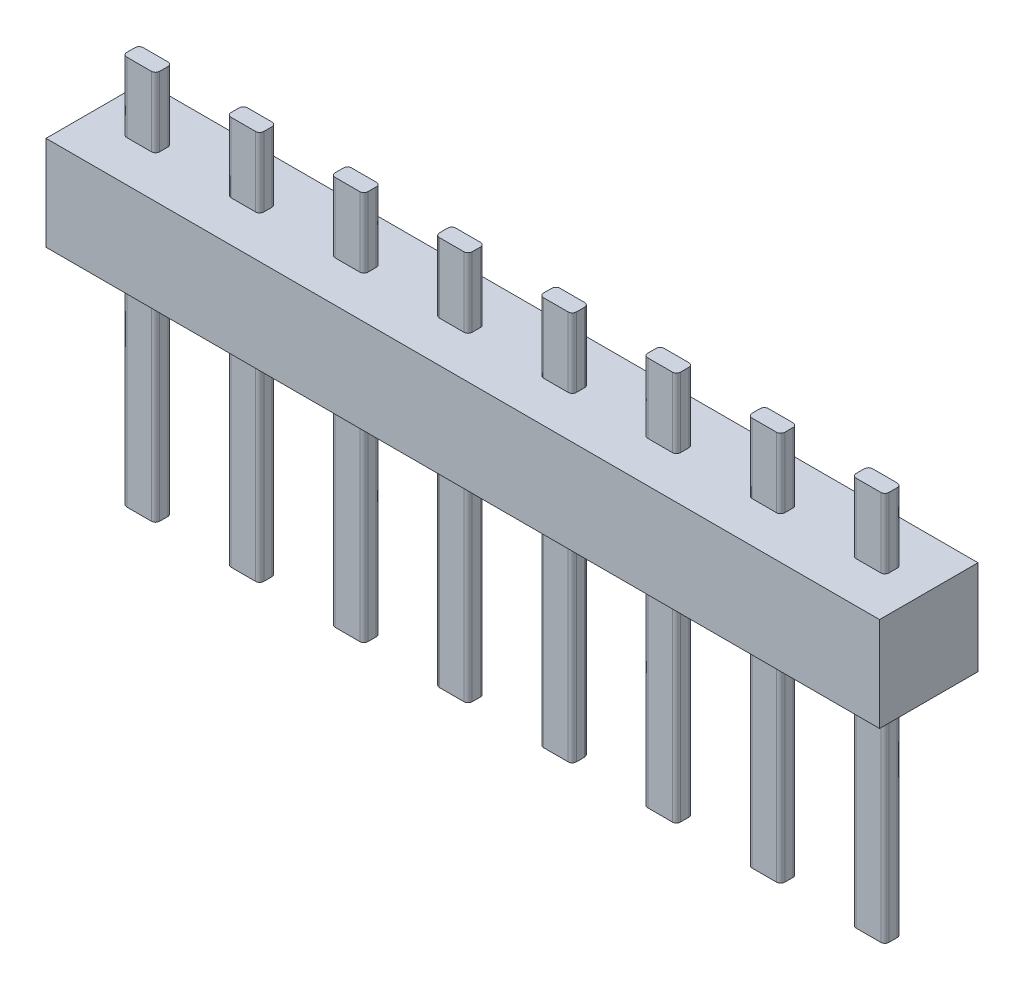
ISO-10303-21;
HEADER;
FILE_DESCRIPTION(('STEP AP214'),'2;1');
FILE_NAME('part.step','',(''),(''),'','','');
FILE_SCHEMA(('AUTOMOTIVE_DESIGN { 1 0 10303 214 1 1 1 1 }'));
ENDSEC;
DATA;
#1=APPLICATION_CONTEXT('core data for automotive mechanical design processes');
#2=APPLICATION_PROTOCOL_DEFINITION('international standard','automotive_design',2000,#1);
#3=PRODUCT_CONTEXT('',#1,'mechanical');
#4=PRODUCT('Part','Part','',(#3));
#5=PRODUCT_RELATED_PRODUCT_CATEGORY('part','',(#4));
#6=PRODUCT_DEFINITION_FORMATION('','',#4);
#7=PRODUCT_DEFINITION_CONTEXT('part definition',#1,'design');
#8=PRODUCT_DEFINITION('design','',#6,#7);
#9=PRODUCT_DEFINITION_SHAPE('','',#8);
#10=(LENGTH_UNIT() NAMED_UNIT(*) SI_UNIT(.MILLI.,.METRE.));
#11=(NAMED_UNIT(*) PLANE_ANGLE_UNIT() SI_UNIT($,.RADIAN.));
#12=(NAMED_UNIT(*) SI_UNIT($,.STERADIAN.) SOLID_ANGLE_UNIT());
#13=UNCERTAINTY_MEASURE_WITH_UNIT(LENGTH_MEASURE(1.E-05),#10,'distance_accuracy_value','');
#14=(GEOMETRIC_REPRESENTATION_CONTEXT(3) GLOBAL_UNCERTAINTY_ASSIGNED_CONTEXT((#13)) GLOBAL_UNIT_ASSIGNED_CONTEXT((#10,
#11,#12)) REPRESENTATION_CONTEXT('',''));
#15=CARTESIAN_POINT('',(0.,0.,0.));
#16=DIRECTION('',(0.,0.,1.));
#17=DIRECTION('',(1.,0.,0.));
#18=AXIS2_PLACEMENT_3D('',#15,#16,#17);
#19=CARTESIAN_POINT('',(20.32,0.,0.));
#20=DIRECTION('',(0.,1.,0.));
#21=DIRECTION('',(0.,0.,1.));
#22=AXIS2_PLACEMENT_3D('',#19,#20,#21);
#23=PLANE('',#22);
#24=CARTESIAN_POINT('',(4.11,0.,-1.30000000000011));
#25=DIRECTION('',(0.,1.,0.));
#26=DIRECTION('',(0.,0.,1.));
#27=AXIS2_PLACEMENT_3D('',#24,#25,#26);
#28=CIRCLE('',#27,0.0999999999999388);
#29=CARTESIAN_POINT('',(4.11,0.,-1.39999999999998));
#30=VERTEX_POINT('',#29);
#31=CARTESIAN_POINT('',(4.21,0.,-1.30000000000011));
#32=VERTEX_POINT('',#31);
#33=EDGE_CURVE('E1033',#30,#32,#28,.F.);
#34=ORIENTED_EDGE('',*,*,#33,.F.);
#35=DIRECTION('',(1.,0.,0.));
#36=VECTOR('',#35,1.);
#37=CARTESIAN_POINT('',(20.32,0.,-1.39999999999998));
#38=LINE('',#37,#36);
#39=CARTESIAN_POINT('',(3.51,0.,-1.39999999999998));
#40=VERTEX_POINT('',#39);
#41=EDGE_CURVE('E1012',#40,#30,#38,.T.);
#42=ORIENTED_EDGE('',*,*,#41,.F.);
#43=CARTESIAN_POINT('',(3.51,0.,-1.30000000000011));
#44=DIRECTION('',(0.,1.,0.));
#45=DIRECTION('',(0.,0.,1.));
#46=AXIS2_PLACEMENT_3D('',#43,#44,#45);
#47=CIRCLE('',#46,0.0999999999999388);
#48=CARTESIAN_POINT('',(3.41000000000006,0.,-1.30000000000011));
#49=VERTEX_POINT('',#48);
#50=EDGE_CURVE('E1015',#49,#40,#47,.F.);
#51=ORIENTED_EDGE('',*,*,#50,.F.);
#52=DIRECTION('',(0.,0.,-1.));
#53=VECTOR('',#52,1.);
#54=CARTESIAN_POINT('',(3.41,0.,0.));
#55=LINE('',#54,#53);
#56=CARTESIAN_POINT('',(3.41,0.,-1.10000000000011));
#57=VERTEX_POINT('',#56);
#58=EDGE_CURVE('E1018',#57,#49,#55,.T.);
#59=ORIENTED_EDGE('',*,*,#58,.F.);
#60=CARTESIAN_POINT('',(3.51,0.,-1.10000000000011));
#61=DIRECTION('',(0.,1.,0.));
#62=DIRECTION('',(0.,0.,1.));
#63=AXIS2_PLACEMENT_3D('',#60,#61,#62);
#64=CIRCLE('',#63,0.0999999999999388);
#65=CARTESIAN_POINT('',(3.51,0.,-1.00000000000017));
#66=VERTEX_POINT('',#65);
#67=EDGE_CURVE('E1021',#66,#57,#64,.F.);
#68=ORIENTED_EDGE('',*,*,#67,.F.);
#69=DIRECTION('',(-1.,0.,0.));
#70=VECTOR('',#69,1.);
#71=CARTESIAN_POINT('',(20.32,0.,-1.00000000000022));
#72=LINE('',#71,#70);
#73=CARTESIAN_POINT('',(4.11,0.,-1.00000000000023));
#74=VERTEX_POINT('',#73);
#75=EDGE_CURVE('E1024',#74,#66,#72,.T.);
#76=ORIENTED_EDGE('',*,*,#75,.F.);
#77=CARTESIAN_POINT('',(4.11,0.,-1.10000000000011));
#78=DIRECTION('',(0.,1.,0.));
#79=DIRECTION('',(0.,0.,1.));
#80=AXIS2_PLACEMENT_3D('',#77,#78,#79);
#81=CIRCLE('',#80,0.0999999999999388);
#82=CARTESIAN_POINT('',(4.20999999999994,0.,-1.10000000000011));
#83=VERTEX_POINT('',#82);
#84=EDGE_CURVE('E1027',#83,#74,#81,.F.);
#85=ORIENTED_EDGE('',*,*,#84,.F.);
#86=DIRECTION('',(0.,0.,1.));
#87=VECTOR('',#86,1.);
#88=CARTESIAN_POINT('',(4.21,0.,0.));
#89=LINE('',#88,#87);
#90=EDGE_CURVE('E1030',#32,#83,#89,.T.);
#91=ORIENTED_EDGE('',*,*,#90,.F.);
#92=EDGE_LOOP('',(#34,#42,#51,#59,#68,#76,#85,#91));
#93=FACE_BOUND('',#92,.T.);
#94=CARTESIAN_POINT('',(9.19,0.,-1.30000000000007));
#95=DIRECTION('',(0.,1.,0.));
#96=DIRECTION('',(0.,0.,1.));
#97=AXIS2_PLACEMENT_3D('',#94,#95,#96);
#98=CIRCLE('',#97,0.0999999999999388);
#99=CARTESIAN_POINT('',(9.19,0.,-1.39999999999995));
#100=VERTEX_POINT('',#99);
#101=CARTESIAN_POINT('',(9.29,0.,-1.30000000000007));
#102=VERTEX_POINT('',#101);
#103=EDGE_CURVE('E1227',#100,#102,#98,.F.);
#104=ORIENTED_EDGE('',*,*,#103,.F.);
#105=DIRECTION('',(1.,0.,0.));
#106=VECTOR('',#105,1.);
#107=CARTESIAN_POINT('',(20.32,0.,-1.39999999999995));
#108=LINE('',#107,#106);
#109=CARTESIAN_POINT('',(8.59,0.,-1.39999999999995));
#110=VERTEX_POINT('',#109);
#111=EDGE_CURVE('E1206',#110,#100,#108,.T.);
#112=ORIENTED_EDGE('',*,*,#111,.F.);
#113=CARTESIAN_POINT('',(8.59,0.,-1.30000000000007));
#114=DIRECTION('',(0.,1.,0.));
#115=DIRECTION('',(0.,0.,1.));
#116=AXIS2_PLACEMENT_3D('',#113,#114,#115);
#117=CIRCLE('',#116,0.0999999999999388);
#118=CARTESIAN_POINT('',(8.49000000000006,0.,-1.30000000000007));
#119=VERTEX_POINT('',#118);
#120=EDGE_CURVE('E1209',#119,#110,#117,.F.);
#121=ORIENTED_EDGE('',*,*,#120,.F.);
#122=DIRECTION('',(0.,0.,-1.));
#123=VECTOR('',#122,1.);
#124=CARTESIAN_POINT('',(8.49,0.,0.));
#125=LINE('',#124,#123);
#126=CARTESIAN_POINT('',(8.49,0.,-1.10000000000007));
#127=VERTEX_POINT('',#126);
#128=EDGE_CURVE('E1212',#127,#119,#125,.T.);
#129=ORIENTED_EDGE('',*,*,#128,.F.);
#130=CARTESIAN_POINT('',(8.59,0.,-1.10000000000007));
#131=DIRECTION('',(0.,1.,0.));
#132=DIRECTION('',(0.,0.,1.));
#133=AXIS2_PLACEMENT_3D('',#130,#131,#132);
#134=CIRCLE('',#133,0.0999999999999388);
#135=CARTESIAN_POINT('',(8.59,0.,-1.00000000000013));
#136=VERTEX_POINT('',#135);
#137=EDGE_CURVE('E1215',#136,#127,#134,.F.);
#138=ORIENTED_EDGE('',*,*,#137,.F.);
#139=DIRECTION('',(-1.,0.,0.));
#140=VECTOR('',#139,1.);
#141=CARTESIAN_POINT('',(20.32,0.,-1.00000000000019));
#142=LINE('',#141,#140);
#143=CARTESIAN_POINT('',(9.19,0.,-1.00000000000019));
#144=VERTEX_POINT('',#143);
#145=EDGE_CURVE('E1218',#144,#136,#142,.T.);
#146=ORIENTED_EDGE('',*,*,#145,.F.);
#147=CARTESIAN_POINT('',(9.19,0.,-1.10000000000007));
#148=DIRECTION('',(0.,1.,0.));
#149=DIRECTION('',(0.,0.,1.));
#150=AXIS2_PLACEMENT_3D('',#147,#148,#149);
#151=CIRCLE('',#150,0.0999999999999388);
#152=CARTESIAN_POINT('',(9.28999999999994,0.,-1.10000000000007));
#153=VERTEX_POINT('',#152);
#154=EDGE_CURVE('E1221',#153,#144,#151,.F.);
#155=ORIENTED_EDGE('',*,*,#154,.F.);
#156=DIRECTION('',(0.,0.,1.));
#157=VECTOR('',#156,1.);
#158=CARTESIAN_POINT('',(9.29,0.,0.));
#159=LINE('',#158,#157);
#160=EDGE_CURVE('E1224',#102,#153,#159,.T.);
#161=ORIENTED_EDGE('',*,*,#160,.F.);
#162=EDGE_LOOP('',(#104,#112,#121,#129,#138,#146,#155,#161));
#163=FACE_BOUND('',#162,.T.);
#164=CARTESIAN_POINT('',(14.27,0.,-1.30000000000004));
#165=DIRECTION('',(0.,1.,0.));
#166=DIRECTION('',(0.,0.,1.));
#167=AXIS2_PLACEMENT_3D('',#164,#165,#166);
#168=CIRCLE('',#167,0.0999999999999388);
#169=CARTESIAN_POINT('',(14.27,0.,-1.39999999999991));
#170=VERTEX_POINT('',#169);
#171=CARTESIAN_POINT('',(14.37,0.,-1.30000000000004));
#172=VERTEX_POINT('',#171);
#173=EDGE_CURVE('E1421',#170,#172,#168,.F.);
#174=ORIENTED_EDGE('',*,*,#173,.F.);
#175=DIRECTION('',(1.,0.,0.));
#176=VECTOR('',#175,1.);
#177=CARTESIAN_POINT('',(20.32,0.,-1.39999999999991));
#178=LINE('',#177,#176);
#179=CARTESIAN_POINT('',(13.67,0.,-1.39999999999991));
#180=VERTEX_POINT('',#179);
#181=EDGE_CURVE('E1400',#180,#170,#178,.T.);
#182=ORIENTED_EDGE('',*,*,#181,.F.);
#183=CARTESIAN_POINT('',(13.67,0.,-1.30000000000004));
#184=DIRECTION('',(0.,1.,0.));
#185=DIRECTION('',(0.,0.,1.));
#186=AXIS2_PLACEMENT_3D('',#183,#184,#185);
#187=CIRCLE('',#186,0.0999999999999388);
#188=CARTESIAN_POINT('',(13.5700000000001,0.,-1.30000000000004));
#189=VERTEX_POINT('',#188);
#190=EDGE_CURVE('E1403',#189,#180,#187,.F.);
#191=ORIENTED_EDGE('',*,*,#190,.F.);
#192=DIRECTION('',(0.,0.,-1.));
#193=VECTOR('',#192,1.);
#194=CARTESIAN_POINT('',(13.57,0.,0.));
#195=LINE('',#194,#193);
#196=CARTESIAN_POINT('',(13.57,0.,-1.10000000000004));
#197=VERTEX_POINT('',#196);
#198=EDGE_CURVE('E1406',#197,#189,#195,.T.);
#199=ORIENTED_EDGE('',*,*,#198,.F.);
#200=CARTESIAN_POINT('',(13.67,0.,-1.10000000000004));
#201=DIRECTION('',(0.,1.,0.));
#202=DIRECTION('',(0.,0.,1.));
#203=AXIS2_PLACEMENT_3D('',#200,#201,#202);
#204=CIRCLE('',#203,0.0999999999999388);
#205=CARTESIAN_POINT('',(13.67,0.,-1.0000000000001));
#206=VERTEX_POINT('',#205);
#207=EDGE_CURVE('E1409',#206,#197,#204,.F.);
#208=ORIENTED_EDGE('',*,*,#207,.F.);
#209=DIRECTION('',(-1.,0.,0.));
#210=VECTOR('',#209,1.);
#211=CARTESIAN_POINT('',(20.32,0.,-1.00000000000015));
#212=LINE('',#211,#210);
#213=CARTESIAN_POINT('',(14.27,0.,-1.00000000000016));
#214=VERTEX_POINT('',#213);
#215=EDGE_CURVE('E1412',#214,#206,#212,.T.);
#216=ORIENTED_EDGE('',*,*,#215,.F.);
#217=CARTESIAN_POINT('',(14.27,0.,-1.10000000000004));
#218=DIRECTION('',(0.,1.,0.));
#219=DIRECTION('',(0.,0.,1.));
#220=AXIS2_PLACEMENT_3D('',#217,#218,#219);
#221=CIRCLE('',#220,0.0999999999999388);
#222=CARTESIAN_POINT('',(14.3699999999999,0.,-1.10000000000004));
#223=VERTEX_POINT('',#222);
#224=EDGE_CURVE('E1415',#223,#214,#221,.F.);
#225=ORIENTED_EDGE('',*,*,#224,.F.);
#226=DIRECTION('',(0.,0.,1.));
#227=VECTOR('',#226,1.);
#228=CARTESIAN_POINT('',(14.37,0.,0.));
#229=LINE('',#228,#227);
#230=EDGE_CURVE('E1418',#172,#223,#229,.T.);
#231=ORIENTED_EDGE('',*,*,#230,.F.);
#232=EDGE_LOOP('',(#174,#182,#191,#199,#208,#216,#225,#231));
#233=FACE_BOUND('',#232,.T.);
#234=CARTESIAN_POINT('',(19.35,0.,-1.3));
#235=DIRECTION('',(0.,1.,0.));
#236=DIRECTION('',(0.,0.,1.));
#237=AXIS2_PLACEMENT_3D('',#234,#235,#236);
#238=CIRCLE('',#237,0.0999999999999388);
#239=CARTESIAN_POINT('',(19.35,0.,-1.39999999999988));
#240=VERTEX_POINT('',#239);
#241=CARTESIAN_POINT('',(19.45,0.,-1.3));
#242=VERTEX_POINT('',#241);
#243=EDGE_CURVE('E1615',#240,#242,#238,.F.);
#244=ORIENTED_EDGE('',*,*,#243,.F.);
#245=DIRECTION('',(1.,0.,0.));
#246=VECTOR('',#245,1.);
#247=CARTESIAN_POINT('',(20.32,0.,-1.39999999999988));
#248=LINE('',#247,#246);
#249=CARTESIAN_POINT('',(18.75,0.,-1.39999999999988));
#250=VERTEX_POINT('',#249);
#251=EDGE_CURVE('E1594',#250,#240,#248,.T.);
#252=ORIENTED_EDGE('',*,*,#251,.F.);
#253=CARTESIAN_POINT('',(18.75,0.,-1.3));
#254=DIRECTION('',(0.,1.,0.));
#255=DIRECTION('',(0.,0.,1.));
#256=AXIS2_PLACEMENT_3D('',#253,#254,#255);
#257=CIRCLE('',#256,0.0999999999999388);
#258=CARTESIAN_POINT('',(18.6500000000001,0.,-1.3));
#259=VERTEX_POINT('',#258);
#260=EDGE_CURVE('E1597',#259,#250,#257,.F.);
#261=ORIENTED_EDGE('',*,*,#260,.F.);
#262=DIRECTION('',(0.,0.,-1.));
#263=VECTOR('',#262,1.);
#264=CARTESIAN_POINT('',(18.65,0.,0.));
#265=LINE('',#264,#263);
#266=CARTESIAN_POINT('',(18.65,0.,-1.1));
#267=VERTEX_POINT('',#266);
#268=EDGE_CURVE('E1600',#267,#259,#265,.T.);
#269=ORIENTED_EDGE('',*,*,#268,.F.);
#270=CARTESIAN_POINT('',(18.75,0.,-1.1));
#271=DIRECTION('',(0.,1.,0.));
#272=DIRECTION('',(0.,0.,1.));
#273=AXIS2_PLACEMENT_3D('',#270,#271,#272);
#274=CIRCLE('',#273,0.0999999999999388);
#275=CARTESIAN_POINT('',(18.75,0.,-1.00000000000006));
#276=VERTEX_POINT('',#275);
#277=EDGE_CURVE('E1603',#276,#267,#274,.F.);
#278=ORIENTED_EDGE('',*,*,#277,.F.);
#279=DIRECTION('',(-1.,0.,0.));
#280=VECTOR('',#279,1.);
#281=CARTESIAN_POINT('',(20.32,0.,-1.00000000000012));
#282=LINE('',#281,#280);
#283=CARTESIAN_POINT('',(19.35,0.,-1.00000000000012));
#284=VERTEX_POINT('',#283);
#285=EDGE_CURVE('E1606',#284,#276,#282,.T.);
#286=ORIENTED_EDGE('',*,*,#285,.F.);
#287=CARTESIAN_POINT('',(19.35,0.,-1.1));
#288=DIRECTION('',(0.,1.,0.));
#289=DIRECTION('',(0.,0.,1.));
#290=AXIS2_PLACEMENT_3D('',#287,#288,#289);
#291=CIRCLE('',#290,0.0999999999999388);
#292=CARTESIAN_POINT('',(19.4499999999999,0.,-1.1));
#293=VERTEX_POINT('',#292);
#294=EDGE_CURVE('E1609',#293,#284,#291,.F.);
#295=ORIENTED_EDGE('',*,*,#294,.F.);
#296=DIRECTION('',(0.,0.,1.));
#297=VECTOR('',#296,1.);
#298=CARTESIAN_POINT('',(19.45,0.,0.));
#299=LINE('',#298,#297);
#300=EDGE_CURVE('E1612',#242,#293,#299,.T.);
#301=ORIENTED_EDGE('',*,*,#300,.F.);
#302=EDGE_LOOP('',(#244,#252,#261,#269,#278,#286,#295,#301));
#303=FACE_BOUND('',#302,.T.);
#304=DIRECTION('',(0.,0.,-1.));
#305=VECTOR('',#304,1.);
#306=CARTESIAN_POINT('',(0.,0.,0.));
#307=LINE('',#306,#305);
#308=CARTESIAN_POINT('',(0.,0.,0.));
#309=VERTEX_POINT('',#308);
#310=CARTESIAN_POINT('',(0.,0.,-2.4));
#311=VERTEX_POINT('',#310);
#312=EDGE_CURVE('E1621',#309,#311,#307,.T.);
#313=ORIENTED_EDGE('',*,*,#312,.T.);
#314=DIRECTION('',(-1.,0.,0.));
#315=VECTOR('',#314,1.);
#316=CARTESIAN_POINT('',(20.32,0.,-2.4));
#317=LINE('',#316,#315);
#318=CARTESIAN_POINT('',(20.32,0.,-2.4));
#319=VERTEX_POINT('',#318);
#320=EDGE_CURVE('E1642',#319,#311,#317,.T.);
#321=ORIENTED_EDGE('',*,*,#320,.F.);
#322=DIRECTION('',(0.,0.,-1.));
#323=VECTOR('',#322,1.);
#324=CARTESIAN_POINT('',(20.32,0.,0.));
#325=LINE('',#324,#323);
#326=CARTESIAN_POINT('',(20.32,0.,0.));
#327=VERTEX_POINT('',#326);
#328=EDGE_CURVE('E1630',#327,#319,#325,.T.);
#329=ORIENTED_EDGE('',*,*,#328,.F.);
#330=DIRECTION('',(-1.,0.,0.));
#331=VECTOR('',#330,1.);
#332=CARTESIAN_POINT('',(20.32,0.,0.));
#333=LINE('',#332,#331);
#334=EDGE_CURVE('E1645',#327,#309,#333,.T.);
#335=ORIENTED_EDGE('',*,*,#334,.T.);
#336=EDGE_LOOP('',(#313,#321,#329,#335));
#337=FACE_BOUND('',#336,.T.);
#338=CARTESIAN_POINT('',(16.81,0.,-1.30000000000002));
#339=DIRECTION('',(0.,1.,0.));
#340=DIRECTION('',(0.,0.,1.));
#341=AXIS2_PLACEMENT_3D('',#338,#339,#340);
#342=CIRCLE('',#341,0.0999999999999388);
#343=CARTESIAN_POINT('',(16.81,0.,-1.3999999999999));
#344=VERTEX_POINT('',#343);
#345=CARTESIAN_POINT('',(16.91,0.,-1.30000000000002));
#346=VERTEX_POINT('',#345);
#347=EDGE_CURVE('E1518',#344,#346,#342,.F.);
#348=ORIENTED_EDGE('',*,*,#347,.F.);
#349=DIRECTION('',(1.,0.,0.));
#350=VECTOR('',#349,1.);
#351=CARTESIAN_POINT('',(20.32,0.,-1.3999999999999));
#352=LINE('',#351,#350);
#353=CARTESIAN_POINT('',(16.21,0.,-1.3999999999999));
#354=VERTEX_POINT('',#353);
#355=EDGE_CURVE('E1497',#354,#344,#352,.T.);
#356=ORIENTED_EDGE('',*,*,#355,.F.);
#357=CARTESIAN_POINT('',(16.21,0.,-1.30000000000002));
#358=DIRECTION('',(0.,1.,0.));
#359=DIRECTION('',(0.,0.,1.));
#360=AXIS2_PLACEMENT_3D('',#357,#358,#359);
#361=CIRCLE('',#360,0.0999999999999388);
#362=CARTESIAN_POINT('',(16.1100000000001,0.,-1.30000000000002));
#363=VERTEX_POINT('',#362);
#364=EDGE_CURVE('E1500',#363,#354,#361,.F.);
#365=ORIENTED_EDGE('',*,*,#364,.F.);
#366=DIRECTION('',(0.,0.,-1.));
#367=VECTOR('',#366,1.);
#368=CARTESIAN_POINT('',(16.11,0.,0.));
#369=LINE('',#368,#367);
#370=CARTESIAN_POINT('',(16.11,0.,-1.10000000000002));
#371=VERTEX_POINT('',#370);
#372=EDGE_CURVE('E1503',#371,#363,#369,.T.);
#373=ORIENTED_EDGE('',*,*,#372,.F.);
#374=CARTESIAN_POINT('',(16.21,0.,-1.10000000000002));
#375=DIRECTION('',(0.,1.,0.));
#376=DIRECTION('',(0.,0.,1.));
#377=AXIS2_PLACEMENT_3D('',#374,#375,#376);
#378=CIRCLE('',#377,0.0999999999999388);
#379=CARTESIAN_POINT('',(16.21,0.,-1.00000000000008));
#380=VERTEX_POINT('',#379);
#381=EDGE_CURVE('E1506',#380,#371,#378,.F.);
#382=ORIENTED_EDGE('',*,*,#381,.F.);
#383=DIRECTION('',(-1.,0.,0.));
#384=VECTOR('',#383,1.);
#385=CARTESIAN_POINT('',(20.32,0.,-1.00000000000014));
#386=LINE('',#385,#384);
#387=CARTESIAN_POINT('',(16.81,0.,-1.00000000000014));
#388=VERTEX_POINT('',#387);
#389=EDGE_CURVE('E1509',#388,#380,#386,.T.);
#390=ORIENTED_EDGE('',*,*,#389,.F.);
#391=CARTESIAN_POINT('',(16.81,0.,-1.10000000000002));
#392=DIRECTION('',(0.,1.,0.));
#393=DIRECTION('',(0.,0.,1.));
#394=AXIS2_PLACEMENT_3D('',#391,#392,#393);
#395=CIRCLE('',#394,0.0999999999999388);
#396=CARTESIAN_POINT('',(16.9099999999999,0.,-1.10000000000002));
#397=VERTEX_POINT('',#396);
#398=EDGE_CURVE('E1512',#397,#388,#395,.F.);
#399=ORIENTED_EDGE('',*,*,#398,.F.);
#400=DIRECTION('',(0.,0.,1.));
#401=VECTOR('',#400,1.);
#402=CARTESIAN_POINT('',(16.91,0.,0.));
#403=LINE('',#402,#401);
#404=EDGE_CURVE('E1515',#346,#397,#403,.T.);
#405=ORIENTED_EDGE('',*,*,#404,.F.);
#406=EDGE_LOOP('',(#348,#356,#365,#373,#382,#390,#399,#405));
#407=FACE_BOUND('',#406,.T.);
#408=CARTESIAN_POINT('',(11.73,0.,-1.30000000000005));
#409=DIRECTION('',(0.,1.,0.));
#410=DIRECTION('',(0.,0.,1.));
#411=AXIS2_PLACEMENT_3D('',#408,#409,#410);
#412=CIRCLE('',#411,0.0999999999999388);
#413=CARTESIAN_POINT('',(11.73,0.,-1.39999999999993));
#414=VERTEX_POINT('',#413);
#415=CARTESIAN_POINT('',(11.83,0.,-1.30000000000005));
#416=VERTEX_POINT('',#415);
#417=EDGE_CURVE('E1324',#414,#416,#412,.F.);
#418=ORIENTED_EDGE('',*,*,#417,.F.);
#419=DIRECTION('',(1.,0.,0.));
#420=VECTOR('',#419,1.);
#421=CARTESIAN_POINT('',(20.32,0.,-1.39999999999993));
#422=LINE('',#421,#420);
#423=CARTESIAN_POINT('',(11.13,0.,-1.39999999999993));
#424=VERTEX_POINT('',#423);
#425=EDGE_CURVE('E1303',#424,#414,#422,.T.);
#426=ORIENTED_EDGE('',*,*,#425,.F.);
#427=CARTESIAN_POINT('',(11.13,0.,-1.30000000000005));
#428=DIRECTION('',(0.,1.,0.));
#429=DIRECTION('',(0.,0.,1.));
#430=AXIS2_PLACEMENT_3D('',#427,#428,#429);
#431=CIRCLE('',#430,0.0999999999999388);
#432=CARTESIAN_POINT('',(11.0300000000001,0.,-1.30000000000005));
#433=VERTEX_POINT('',#432);
#434=EDGE_CURVE('E1306',#433,#424,#431,.F.);
#435=ORIENTED_EDGE('',*,*,#434,.F.);
#436=DIRECTION('',(0.,0.,-1.));
#437=VECTOR('',#436,1.);
#438=CARTESIAN_POINT('',(11.03,0.,0.));
#439=LINE('',#438,#437);
#440=CARTESIAN_POINT('',(11.03,0.,-1.10000000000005));
#441=VERTEX_POINT('',#440);
#442=EDGE_CURVE('E1309',#441,#433,#439,.T.);
#443=ORIENTED_EDGE('',*,*,#442,.F.);
#444=CARTESIAN_POINT('',(11.13,0.,-1.10000000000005));
#445=DIRECTION('',(0.,1.,0.));
#446=DIRECTION('',(0.,0.,1.));
#447=AXIS2_PLACEMENT_3D('',#444,#445,#446);
#448=CIRCLE('',#447,0.0999999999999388);
#449=CARTESIAN_POINT('',(11.13,0.,-1.00000000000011));
#450=VERTEX_POINT('',#449);
#451=EDGE_CURVE('E1312',#450,#441,#448,.F.);
#452=ORIENTED_EDGE('',*,*,#451,.F.);
#453=DIRECTION('',(-1.,0.,0.));
#454=VECTOR('',#453,1.);
#455=CARTESIAN_POINT('',(20.32,0.,-1.00000000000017));
#456=LINE('',#455,#454);
#457=CARTESIAN_POINT('',(11.73,0.,-1.00000000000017));
#458=VERTEX_POINT('',#457);
#459=EDGE_CURVE('E1315',#458,#450,#456,.T.);
#460=ORIENTED_EDGE('',*,*,#459,.F.);
#461=CARTESIAN_POINT('',(11.73,0.,-1.10000000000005));
#462=DIRECTION('',(0.,1.,0.));
#463=DIRECTION('',(0.,0.,1.));
#464=AXIS2_PLACEMENT_3D('',#461,#462,#463);
#465=CIRCLE('',#464,0.0999999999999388);
#466=CARTESIAN_POINT('',(11.8299999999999,0.,-1.10000000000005));
#467=VERTEX_POINT('',#466);
#468=EDGE_CURVE('E1318',#467,#458,#465,.F.);
#469=ORIENTED_EDGE('',*,*,#468,.F.);
#470=DIRECTION('',(0.,0.,1.));
#471=VECTOR('',#470,1.);
#472=CARTESIAN_POINT('',(11.83,0.,0.));
#473=LINE('',#472,#471);
#474=EDGE_CURVE('E1321',#416,#467,#473,.T.);
#475=ORIENTED_EDGE('',*,*,#474,.F.);
#476=EDGE_LOOP('',(#418,#426,#435,#443,#452,#460,#469,#475));
#477=FACE_BOUND('',#476,.T.);
#478=CARTESIAN_POINT('',(6.65,0.,-1.30000000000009));
#479=DIRECTION('',(0.,1.,0.));
#480=DIRECTION('',(0.,0.,1.));
#481=AXIS2_PLACEMENT_3D('',#478,#479,#480);
#482=CIRCLE('',#481,0.0999999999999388);
#483=CARTESIAN_POINT('',(6.65,0.,-1.39999999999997));
#484=VERTEX_POINT('',#483);
#485=CARTESIAN_POINT('',(6.75,0.,-1.30000000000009));
#486=VERTEX_POINT('',#485);
#487=EDGE_CURVE('E1130',#484,#486,#482,.F.);
#488=ORIENTED_EDGE('',*,*,#487,.F.);
#489=DIRECTION('',(1.,0.,0.));
#490=VECTOR('',#489,1.);
#491=CARTESIAN_POINT('',(20.32,0.,-1.39999999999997));
#492=LINE('',#491,#490);
#493=CARTESIAN_POINT('',(6.05,0.,-1.39999999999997));
#494=VERTEX_POINT('',#493);
#495=EDGE_CURVE('E1109',#494,#484,#492,.T.);
#496=ORIENTED_EDGE('',*,*,#495,.F.);
#497=CARTESIAN_POINT('',(6.05,0.,-1.30000000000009));
#498=DIRECTION('',(0.,1.,0.));
#499=DIRECTION('',(0.,0.,1.));
#500=AXIS2_PLACEMENT_3D('',#497,#498,#499);
#501=CIRCLE('',#500,0.0999999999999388);
#502=CARTESIAN_POINT('',(5.95000000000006,0.,-1.30000000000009));
#503=VERTEX_POINT('',#502);
#504=EDGE_CURVE('E1112',#503,#494,#501,.F.);
#505=ORIENTED_EDGE('',*,*,#504,.F.);
#506=DIRECTION('',(0.,0.,-1.));
#507=VECTOR('',#506,1.);
#508=CARTESIAN_POINT('',(5.95,0.,0.));
#509=LINE('',#508,#507);
#510=CARTESIAN_POINT('',(5.95,0.,-1.10000000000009));
#511=VERTEX_POINT('',#510);
#512=EDGE_CURVE('E1115',#511,#503,#509,.T.);
#513=ORIENTED_EDGE('',*,*,#512,.F.);
#514=CARTESIAN_POINT('',(6.05,0.,-1.10000000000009));
#515=DIRECTION('',(0.,1.,0.));
#516=DIRECTION('',(0.,0.,1.));
#517=AXIS2_PLACEMENT_3D('',#514,#515,#516);
#518=CIRCLE('',#517,0.0999999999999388);
#519=CARTESIAN_POINT('',(6.05,0.,-1.00000000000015));
#520=VERTEX_POINT('',#519);
#521=EDGE_CURVE('E1118',#520,#511,#518,.F.);
#522=ORIENTED_EDGE('',*,*,#521,.F.);
#523=DIRECTION('',(-1.,0.,0.));
#524=VECTOR('',#523,1.);
#525=CARTESIAN_POINT('',(20.32,0.,-1.00000000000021));
#526=LINE('',#525,#524);
#527=CARTESIAN_POINT('',(6.65,0.,-1.00000000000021));
#528=VERTEX_POINT('',#527);
#529=EDGE_CURVE('E1121',#528,#520,#526,.T.);
#530=ORIENTED_EDGE('',*,*,#529,.F.);
#531=CARTESIAN_POINT('',(6.65,0.,-1.10000000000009));
#532=DIRECTION('',(0.,1.,0.));
#533=DIRECTION('',(0.,0.,1.));
#534=AXIS2_PLACEMENT_3D('',#531,#532,#533);
#535=CIRCLE('',#534,0.0999999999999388);
#536=CARTESIAN_POINT('',(6.74999999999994,0.,-1.10000000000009));
#537=VERTEX_POINT('',#536);
#538=EDGE_CURVE('E1124',#537,#528,#535,.F.);
#539=ORIENTED_EDGE('',*,*,#538,.F.);
#540=DIRECTION('',(0.,0.,1.));
#541=VECTOR('',#540,1.);
#542=CARTESIAN_POINT('',(6.75,0.,0.));
#543=LINE('',#542,#541);
#544=EDGE_CURVE('E1127',#486,#537,#543,.T.);
#545=ORIENTED_EDGE('',*,*,#544,.F.);
#546=EDGE_LOOP('',(#488,#496,#505,#513,#522,#530,#539,#545));
#547=FACE_BOUND('',#546,.T.);
#548=CARTESIAN_POINT('',(1.57,0.,-1.30000000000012));
#549=DIRECTION('',(0.,1.,0.));
#550=DIRECTION('',(0.,0.,1.));
#551=AXIS2_PLACEMENT_3D('',#548,#549,#550);
#552=CIRCLE('',#551,0.0999999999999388);
#553=CARTESIAN_POINT('',(1.57,0.,-1.4));
#554=VERTEX_POINT('',#553);
#555=CARTESIAN_POINT('',(1.67,0.,-1.30000000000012));
#556=VERTEX_POINT('',#555);
#557=EDGE_CURVE('E937',#554,#556,#552,.F.);
#558=ORIENTED_EDGE('',*,*,#557,.F.);
#559=DIRECTION('',(1.,0.,0.));
#560=VECTOR('',#559,1.);
#561=CARTESIAN_POINT('',(20.32,0.,-1.4));
#562=LINE('',#561,#560);
#563=CARTESIAN_POINT('',(0.970000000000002,0.,-1.4));
#564=VERTEX_POINT('',#563);
#565=EDGE_CURVE('E920',#564,#554,#562,.T.);
#566=ORIENTED_EDGE('',*,*,#565,.F.);
#567=CARTESIAN_POINT('',(0.970000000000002,0.,-1.30000000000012));
#568=DIRECTION('',(0.,1.,0.));
#569=DIRECTION('',(0.,0.,1.));
#570=AXIS2_PLACEMENT_3D('',#567,#568,#569);
#571=CIRCLE('',#570,0.0999999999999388);
#572=CARTESIAN_POINT('',(0.870000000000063,0.,-1.30000000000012));
#573=VERTEX_POINT('',#572);
#574=EDGE_CURVE('E923',#573,#564,#571,.F.);
#575=ORIENTED_EDGE('',*,*,#574,.F.);
#576=DIRECTION('',(0.,0.,-1.));
#577=VECTOR('',#576,1.);
#578=CARTESIAN_POINT('',(0.870000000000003,0.,0.));
#579=LINE('',#578,#577);
#580=CARTESIAN_POINT('',(0.870000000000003,0.,-1.10000000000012));
#581=VERTEX_POINT('',#580);
#582=EDGE_CURVE('E926',#581,#573,#579,.T.);
#583=ORIENTED_EDGE('',*,*,#582,.F.);
#584=CARTESIAN_POINT('',(0.970000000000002,0.,-1.10000000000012));
#585=DIRECTION('',(0.,1.,0.));
#586=DIRECTION('',(0.,0.,1.));
#587=AXIS2_PLACEMENT_3D('',#584,#585,#586);
#588=CIRCLE('',#587,0.0999999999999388);
#589=CARTESIAN_POINT('',(0.970000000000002,0.,-1.00000000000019));
#590=VERTEX_POINT('',#589);
#591=EDGE_CURVE('E929',#590,#581,#588,.F.);
#592=ORIENTED_EDGE('',*,*,#591,.F.);
#593=DIRECTION('',(-1.,0.,0.));
#594=VECTOR('',#593,1.);
#595=CARTESIAN_POINT('',(20.32,0.,-1.00000000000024));
#596=LINE('',#595,#594);
#597=CARTESIAN_POINT('',(1.57,0.,-1.00000000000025));
#598=VERTEX_POINT('',#597);
#599=EDGE_CURVE('E932',#598,#590,#596,.T.);
#600=ORIENTED_EDGE('',*,*,#599,.F.);
#601=CARTESIAN_POINT('',(1.57,0.,-1.10000000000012));
#602=DIRECTION('',(0.,1.,0.));
#603=DIRECTION('',(0.,0.,1.));
#604=AXIS2_PLACEMENT_3D('',#601,#602,#603);
#605=CIRCLE('',#604,0.0999999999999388);
#606=CARTESIAN_POINT('',(1.66999999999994,0.,-1.10000000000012));
#607=VERTEX_POINT('',#606);
#608=EDGE_CURVE('E47',#607,#598,#605,.F.);
#609=ORIENTED_EDGE('',*,*,#608,.F.);
#610=DIRECTION('',(0.,0.,1.));
#611=VECTOR('',#610,1.);
#612=CARTESIAN_POINT('',(1.67,0.,0.));
#613=LINE('',#612,#611);
#614=EDGE_CURVE('E42',#556,#607,#613,.T.);
#615=ORIENTED_EDGE('',*,*,#614,.F.);
#616=EDGE_LOOP('',(#558,#566,#575,#583,#592,#600,#609,#615));
#617=FACE_BOUND('',#616,.T.);
#618=ADVANCED_FACE('F27',(#93,#163,#233,#303,#337,#407,#477,#547,#617),#23,.F.);
#619=CARTESIAN_POINT('',(20.32,2.3,0.));
#620=DIRECTION('',(0.,-1.,0.));
#621=DIRECTION('',(0.,0.,-1.));
#622=AXIS2_PLACEMENT_3D('',#619,#620,#621);
#623=PLANE('',#622);
#624=CARTESIAN_POINT('',(4.11,2.3,-1.30000000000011));
#625=DIRECTION('',(0.,-1.,0.));
#626=DIRECTION('',(0.,0.,-1.));
#627=AXIS2_PLACEMENT_3D('',#624,#625,#626);
#628=CIRCLE('',#627,0.0999999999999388);
#629=CARTESIAN_POINT('',(4.21,2.3,-1.30000000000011));
#630=VERTEX_POINT('',#629);
#631=CARTESIAN_POINT('',(4.11,2.3,-1.39999999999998));
#632=VERTEX_POINT('',#631);
#633=EDGE_CURVE('E1813',#630,#632,#628,.F.);
#634=ORIENTED_EDGE('',*,*,#633,.F.);
#635=DIRECTION('',(0.,0.,-1.));
#636=VECTOR('',#635,1.);
#637=CARTESIAN_POINT('',(4.21,2.3,0.));
#638=LINE('',#637,#636);
#639=CARTESIAN_POINT('',(4.20999999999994,2.3,-1.10000000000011));
#640=VERTEX_POINT('',#639);
#641=EDGE_CURVE('E1810',#640,#630,#638,.T.);
#642=ORIENTED_EDGE('',*,*,#641,.F.);
#643=CARTESIAN_POINT('',(4.11,2.3,-1.10000000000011));
#644=DIRECTION('',(0.,-1.,0.));
#645=DIRECTION('',(0.,0.,-1.));
#646=AXIS2_PLACEMENT_3D('',#643,#644,#645);
#647=CIRCLE('',#646,0.0999999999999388);
#648=CARTESIAN_POINT('',(4.11,2.3,-1.00000000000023));
#649=VERTEX_POINT('',#648);
#650=EDGE_CURVE('E1807',#649,#640,#647,.F.);
#651=ORIENTED_EDGE('',*,*,#650,.F.);
#652=DIRECTION('',(1.,0.,0.));
#653=VECTOR('',#652,1.);
#654=CARTESIAN_POINT('',(20.32,2.3,-1.00000000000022));
#655=LINE('',#654,#653);
#656=CARTESIAN_POINT('',(3.51,2.3,-1.00000000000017));
#657=VERTEX_POINT('',#656);
#658=EDGE_CURVE('E1804',#657,#649,#655,.T.);
#659=ORIENTED_EDGE('',*,*,#658,.F.);
#660=CARTESIAN_POINT('',(3.51,2.3,-1.10000000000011));
#661=DIRECTION('',(0.,-1.,0.));
#662=DIRECTION('',(0.,0.,-1.));
#663=AXIS2_PLACEMENT_3D('',#660,#661,#662);
#664=CIRCLE('',#663,0.0999999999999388);
#665=CARTESIAN_POINT('',(3.41,2.3,-1.10000000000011));
#666=VERTEX_POINT('',#665);
#667=EDGE_CURVE('E1801',#666,#657,#664,.F.);
#668=ORIENTED_EDGE('',*,*,#667,.F.);
#669=DIRECTION('',(0.,0.,1.));
#670=VECTOR('',#669,1.);
#671=CARTESIAN_POINT('',(3.41,2.3,0.));
#672=LINE('',#671,#670);
#673=CARTESIAN_POINT('',(3.41000000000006,2.3,-1.30000000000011));
#674=VERTEX_POINT('',#673);
#675=EDGE_CURVE('E1798',#674,#666,#672,.T.);
#676=ORIENTED_EDGE('',*,*,#675,.F.);
#677=CARTESIAN_POINT('',(3.51,2.3,-1.30000000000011));
#678=DIRECTION('',(0.,-1.,0.));
#679=DIRECTION('',(0.,0.,-1.));
#680=AXIS2_PLACEMENT_3D('',#677,#678,#679);
#681=CIRCLE('',#680,0.0999999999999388);
#682=CARTESIAN_POINT('',(3.51,2.3,-1.39999999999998));
#683=VERTEX_POINT('',#682);
#684=EDGE_CURVE('E1795',#683,#674,#681,.F.);
#685=ORIENTED_EDGE('',*,*,#684,.F.);
#686=DIRECTION('',(-1.,0.,0.));
#687=VECTOR('',#686,1.);
#688=CARTESIAN_POINT('',(20.32,2.3,-1.39999999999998));
#689=LINE('',#688,#687);
#690=EDGE_CURVE('E1792',#632,#683,#689,.T.);
#691=ORIENTED_EDGE('',*,*,#690,.F.);
#692=EDGE_LOOP('',(#634,#642,#651,#659,#668,#676,#685,#691));
#693=FACE_BOUND('',#692,.T.);
#694=CARTESIAN_POINT('',(9.19,2.3,-1.30000000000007));
#695=DIRECTION('',(0.,-1.,0.));
#696=DIRECTION('',(0.,0.,-1.));
#697=AXIS2_PLACEMENT_3D('',#694,#695,#696);
#698=CIRCLE('',#697,0.0999999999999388);
#699=CARTESIAN_POINT('',(9.29,2.3,-1.30000000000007));
#700=VERTEX_POINT('',#699);
#701=CARTESIAN_POINT('',(9.19,2.3,-1.39999999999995));
#702=VERTEX_POINT('',#701);
#703=EDGE_CURVE('E1765',#700,#702,#698,.F.);
#704=ORIENTED_EDGE('',*,*,#703,.F.);
#705=DIRECTION('',(0.,0.,-1.));
#706=VECTOR('',#705,1.);
#707=CARTESIAN_POINT('',(9.29,2.3,0.));
#708=LINE('',#707,#706);
#709=CARTESIAN_POINT('',(9.28999999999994,2.3,-1.10000000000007));
#710=VERTEX_POINT('',#709);
#711=EDGE_CURVE('E1762',#710,#700,#708,.T.);
#712=ORIENTED_EDGE('',*,*,#711,.F.);
#713=CARTESIAN_POINT('',(9.19,2.3,-1.10000000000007));
#714=DIRECTION('',(0.,-1.,0.));
#715=DIRECTION('',(0.,0.,-1.));
#716=AXIS2_PLACEMENT_3D('',#713,#714,#715);
#717=CIRCLE('',#716,0.0999999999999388);
#718=CARTESIAN_POINT('',(9.19,2.3,-1.00000000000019));
#719=VERTEX_POINT('',#718);
#720=EDGE_CURVE('E1759',#719,#710,#717,.F.);
#721=ORIENTED_EDGE('',*,*,#720,.F.);
#722=DIRECTION('',(1.,0.,0.));
#723=VECTOR('',#722,1.);
#724=CARTESIAN_POINT('',(20.32,2.3,-1.00000000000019));
#725=LINE('',#724,#723);
#726=CARTESIAN_POINT('',(8.59,2.3,-1.00000000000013));
#727=VERTEX_POINT('',#726);
#728=EDGE_CURVE('E1756',#727,#719,#725,.T.);
#729=ORIENTED_EDGE('',*,*,#728,.F.);
#730=CARTESIAN_POINT('',(8.59,2.3,-1.10000000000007));
#731=DIRECTION('',(0.,-1.,0.));
#732=DIRECTION('',(0.,0.,-1.));
#733=AXIS2_PLACEMENT_3D('',#730,#731,#732);
#734=CIRCLE('',#733,0.0999999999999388);
#735=CARTESIAN_POINT('',(8.49,2.3,-1.10000000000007));
#736=VERTEX_POINT('',#735);
#737=EDGE_CURVE('E1753',#736,#727,#734,.F.);
#738=ORIENTED_EDGE('',*,*,#737,.F.);
#739=DIRECTION('',(0.,0.,1.));
#740=VECTOR('',#739,1.);
#741=CARTESIAN_POINT('',(8.49,2.3,0.));
#742=LINE('',#741,#740);
#743=CARTESIAN_POINT('',(8.49000000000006,2.3,-1.30000000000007));
#744=VERTEX_POINT('',#743);
#745=EDGE_CURVE('E1750',#744,#736,#742,.T.);
#746=ORIENTED_EDGE('',*,*,#745,.F.);
#747=CARTESIAN_POINT('',(8.59,2.3,-1.30000000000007));
#748=DIRECTION('',(0.,-1.,0.));
#749=DIRECTION('',(0.,0.,-1.));
#750=AXIS2_PLACEMENT_3D('',#747,#748,#749);
#751=CIRCLE('',#750,0.0999999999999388);
#752=CARTESIAN_POINT('',(8.59,2.3,-1.39999999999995));
#753=VERTEX_POINT('',#752);
#754=EDGE_CURVE('E1747',#753,#744,#751,.F.);
#755=ORIENTED_EDGE('',*,*,#754,.F.);
#756=DIRECTION('',(-1.,0.,0.));
#757=VECTOR('',#756,1.);
#758=CARTESIAN_POINT('',(20.32,2.3,-1.39999999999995));
#759=LINE('',#758,#757);
#760=EDGE_CURVE('E1744',#702,#753,#759,.T.);
#761=ORIENTED_EDGE('',*,*,#760,.F.);
#762=EDGE_LOOP('',(#704,#712,#721,#729,#738,#746,#755,#761));
#763=FACE_BOUND('',#762,.T.);
#764=CARTESIAN_POINT('',(14.27,2.3,-1.30000000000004));
#765=DIRECTION('',(0.,-1.,0.));
#766=DIRECTION('',(0.,0.,-1.));
#767=AXIS2_PLACEMENT_3D('',#764,#765,#766);
#768=CIRCLE('',#767,0.0999999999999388);
#769=CARTESIAN_POINT('',(14.37,2.3,-1.30000000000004));
#770=VERTEX_POINT('',#769);
#771=CARTESIAN_POINT('',(14.27,2.3,-1.39999999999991));
#772=VERTEX_POINT('',#771);
#773=EDGE_CURVE('E1717',#770,#772,#768,.F.);
#774=ORIENTED_EDGE('',*,*,#773,.F.);
#775=DIRECTION('',(0.,0.,-1.));
#776=VECTOR('',#775,1.);
#777=CARTESIAN_POINT('',(14.37,2.3,0.));
#778=LINE('',#777,#776);
#779=CARTESIAN_POINT('',(14.3699999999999,2.3,-1.10000000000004));
#780=VERTEX_POINT('',#779);
#781=EDGE_CURVE('E1714',#780,#770,#778,.T.);
#782=ORIENTED_EDGE('',*,*,#781,.F.);
#783=CARTESIAN_POINT('',(14.27,2.3,-1.10000000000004));
#784=DIRECTION('',(0.,-1.,0.));
#785=DIRECTION('',(0.,0.,-1.));
#786=AXIS2_PLACEMENT_3D('',#783,#784,#785);
#787=CIRCLE('',#786,0.0999999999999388);
#788=CARTESIAN_POINT('',(14.27,2.3,-1.00000000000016));
#789=VERTEX_POINT('',#788);
#790=EDGE_CURVE('E1711',#789,#780,#787,.F.);
#791=ORIENTED_EDGE('',*,*,#790,.F.);
#792=DIRECTION('',(1.,0.,0.));
#793=VECTOR('',#792,1.);
#794=CARTESIAN_POINT('',(20.32,2.3,-1.00000000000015));
#795=LINE('',#794,#793);
#796=CARTESIAN_POINT('',(13.67,2.3,-1.0000000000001));
#797=VERTEX_POINT('',#796);
#798=EDGE_CURVE('E1708',#797,#789,#795,.T.);
#799=ORIENTED_EDGE('',*,*,#798,.F.);
#800=CARTESIAN_POINT('',(13.67,2.3,-1.10000000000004));
#801=DIRECTION('',(0.,-1.,0.));
#802=DIRECTION('',(0.,0.,-1.));
#803=AXIS2_PLACEMENT_3D('',#800,#801,#802);
#804=CIRCLE('',#803,0.0999999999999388);
#805=CARTESIAN_POINT('',(13.57,2.3,-1.10000000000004));
#806=VERTEX_POINT('',#805);
#807=EDGE_CURVE('E1705',#806,#797,#804,.F.);
#808=ORIENTED_EDGE('',*,*,#807,.F.);
#809=DIRECTION('',(0.,0.,1.));
#810=VECTOR('',#809,1.);
#811=CARTESIAN_POINT('',(13.57,2.3,0.));
#812=LINE('',#811,#810);
#813=CARTESIAN_POINT('',(13.5700000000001,2.3,-1.30000000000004));
#814=VERTEX_POINT('',#813);
#815=EDGE_CURVE('E1702',#814,#806,#812,.T.);
#816=ORIENTED_EDGE('',*,*,#815,.F.);
#817=CARTESIAN_POINT('',(13.67,2.3,-1.30000000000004));
#818=DIRECTION('',(0.,-1.,0.));
#819=DIRECTION('',(0.,0.,-1.));
#820=AXIS2_PLACEMENT_3D('',#817,#818,#819);
#821=CIRCLE('',#820,0.0999999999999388);
#822=CARTESIAN_POINT('',(13.67,2.3,-1.39999999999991));
#823=VERTEX_POINT('',#822);
#824=EDGE_CURVE('E1699',#823,#814,#821,.F.);
#825=ORIENTED_EDGE('',*,*,#824,.F.);
#826=DIRECTION('',(-1.,0.,0.));
#827=VECTOR('',#826,1.);
#828=CARTESIAN_POINT('',(20.32,2.3,-1.39999999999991));
#829=LINE('',#828,#827);
#830=EDGE_CURVE('E1696',#772,#823,#829,.T.);
#831=ORIENTED_EDGE('',*,*,#830,.F.);
#832=EDGE_LOOP('',(#774,#782,#791,#799,#808,#816,#825,#831));
#833=FACE_BOUND('',#832,.T.);
#834=CARTESIAN_POINT('',(19.35,2.3,-1.3));
#835=DIRECTION('',(0.,-1.,0.));
#836=DIRECTION('',(0.,0.,-1.));
#837=AXIS2_PLACEMENT_3D('',#834,#835,#836);
#838=CIRCLE('',#837,0.0999999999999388);
#839=CARTESIAN_POINT('',(19.45,2.3,-1.3));
#840=VERTEX_POINT('',#839);
#841=CARTESIAN_POINT('',(19.35,2.3,-1.39999999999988));
#842=VERTEX_POINT('',#841);
#843=EDGE_CURVE('E1669',#840,#842,#838,.F.);
#844=ORIENTED_EDGE('',*,*,#843,.F.);
#845=DIRECTION('',(0.,0.,-1.));
#846=VECTOR('',#845,1.);
#847=CARTESIAN_POINT('',(19.45,2.3,0.));
#848=LINE('',#847,#846);
#849=CARTESIAN_POINT('',(19.4499999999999,2.3,-1.1));
#850=VERTEX_POINT('',#849);
#851=EDGE_CURVE('E1666',#850,#840,#848,.T.);
#852=ORIENTED_EDGE('',*,*,#851,.F.);
#853=CARTESIAN_POINT('',(19.35,2.3,-1.1));
#854=DIRECTION('',(0.,-1.,0.));
#855=DIRECTION('',(0.,0.,-1.));
#856=AXIS2_PLACEMENT_3D('',#853,#854,#855);
#857=CIRCLE('',#856,0.0999999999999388);
#858=CARTESIAN_POINT('',(19.35,2.3,-1.00000000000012));
#859=VERTEX_POINT('',#858);
#860=EDGE_CURVE('E1663',#859,#850,#857,.F.);
#861=ORIENTED_EDGE('',*,*,#860,.F.);
#862=DIRECTION('',(1.,0.,0.));
#863=VECTOR('',#862,1.);
#864=CARTESIAN_POINT('',(20.32,2.3,-1.00000000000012));
#865=LINE('',#864,#863);
#866=CARTESIAN_POINT('',(18.75,2.3,-1.00000000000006));
#867=VERTEX_POINT('',#866);
#868=EDGE_CURVE('E1660',#867,#859,#865,.T.);
#869=ORIENTED_EDGE('',*,*,#868,.F.);
#870=CARTESIAN_POINT('',(18.75,2.3,-1.1));
#871=DIRECTION('',(0.,-1.,0.));
#872=DIRECTION('',(0.,0.,-1.));
#873=AXIS2_PLACEMENT_3D('',#870,#871,#872);
#874=CIRCLE('',#873,0.0999999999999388);
#875=CARTESIAN_POINT('',(18.65,2.3,-1.1));
#876=VERTEX_POINT('',#875);
#877=EDGE_CURVE('E1657',#876,#867,#874,.F.);
#878=ORIENTED_EDGE('',*,*,#877,.F.);
#879=DIRECTION('',(0.,0.,1.));
#880=VECTOR('',#879,1.);
#881=CARTESIAN_POINT('',(18.65,2.3,0.));
#882=LINE('',#881,#880);
#883=CARTESIAN_POINT('',(18.6500000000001,2.3,-1.3));
#884=VERTEX_POINT('',#883);
#885=EDGE_CURVE('E1654',#884,#876,#882,.T.);
#886=ORIENTED_EDGE('',*,*,#885,.F.);
#887=CARTESIAN_POINT('',(18.75,2.3,-1.3));
#888=DIRECTION('',(0.,-1.,0.));
#889=DIRECTION('',(0.,0.,-1.));
#890=AXIS2_PLACEMENT_3D('',#887,#888,#889);
#891=CIRCLE('',#890,0.0999999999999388);
#892=CARTESIAN_POINT('',(18.75,2.3,-1.39999999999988));
#893=VERTEX_POINT('',#892);
#894=EDGE_CURVE('E1651',#893,#884,#891,.F.);
#895=ORIENTED_EDGE('',*,*,#894,.F.);
#896=DIRECTION('',(-1.,0.,0.));
#897=VECTOR('',#896,1.);
#898=CARTESIAN_POINT('',(20.32,2.3,-1.39999999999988));
#899=LINE('',#898,#897);
#900=EDGE_CURVE('E1648',#842,#893,#899,.T.);
#901=ORIENTED_EDGE('',*,*,#900,.F.);
#902=EDGE_LOOP('',(#844,#852,#861,#869,#878,#886,#895,#901));
#903=FACE_BOUND('',#902,.T.);
#904=DIRECTION('',(0.,0.,1.));
#905=VECTOR('',#904,1.);
#906=CARTESIAN_POINT('',(0.,2.3,0.));
#907=LINE('',#906,#905);
#908=CARTESIAN_POINT('',(0.,2.3,-2.4));
#909=VERTEX_POINT('',#908);
#910=CARTESIAN_POINT('',(0.,2.3,0.));
#911=VERTEX_POINT('',#910);
#912=EDGE_CURVE('E1625',#909,#911,#907,.T.);
#913=ORIENTED_EDGE('',*,*,#912,.T.);
#914=DIRECTION('',(-1.,0.,0.));
#915=VECTOR('',#914,1.);
#916=CARTESIAN_POINT('',(20.32,2.3,0.));
#917=LINE('',#916,#915);
#918=CARTESIAN_POINT('',(20.32,2.3,0.));
#919=VERTEX_POINT('',#918);
#920=EDGE_CURVE('E1636',#919,#911,#917,.T.);
#921=ORIENTED_EDGE('',*,*,#920,.F.);
#922=DIRECTION('',(0.,0.,1.));
#923=VECTOR('',#922,1.);
#924=CARTESIAN_POINT('',(20.32,2.3,0.));
#925=LINE('',#924,#923);
#926=CARTESIAN_POINT('',(20.32,2.3,-2.4));
#927=VERTEX_POINT('',#926);
#928=EDGE_CURVE('E1634',#927,#919,#925,.T.);
#929=ORIENTED_EDGE('',*,*,#928,.F.);
#930=DIRECTION('',(-1.,0.,0.));
#931=VECTOR('',#930,1.);
#932=CARTESIAN_POINT('',(20.32,2.3,-2.4));
#933=LINE('',#932,#931);
#934=EDGE_CURVE('E1639',#927,#909,#933,.T.);
#935=ORIENTED_EDGE('',*,*,#934,.T.);
#936=EDGE_LOOP('',(#913,#921,#929,#935));
#937=FACE_BOUND('',#936,.T.);
#938=CARTESIAN_POINT('',(16.81,2.3,-1.30000000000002));
#939=DIRECTION('',(0.,-1.,0.));
#940=DIRECTION('',(0.,0.,-1.));
#941=AXIS2_PLACEMENT_3D('',#938,#939,#940);
#942=CIRCLE('',#941,0.0999999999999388);
#943=CARTESIAN_POINT('',(16.91,2.3,-1.30000000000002));
#944=VERTEX_POINT('',#943);
#945=CARTESIAN_POINT('',(16.81,2.3,-1.3999999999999));
#946=VERTEX_POINT('',#945);
#947=EDGE_CURVE('E1693',#944,#946,#942,.F.);
#948=ORIENTED_EDGE('',*,*,#947,.F.);
#949=DIRECTION('',(0.,0.,-1.));
#950=VECTOR('',#949,1.);
#951=CARTESIAN_POINT('',(16.91,2.3,0.));
#952=LINE('',#951,#950);
#953=CARTESIAN_POINT('',(16.9099999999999,2.3,-1.10000000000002));
#954=VERTEX_POINT('',#953);
#955=EDGE_CURVE('E1690',#954,#944,#952,.T.);
#956=ORIENTED_EDGE('',*,*,#955,.F.);
#957=CARTESIAN_POINT('',(16.81,2.3,-1.10000000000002));
#958=DIRECTION('',(0.,-1.,0.));
#959=DIRECTION('',(0.,0.,-1.));
#960=AXIS2_PLACEMENT_3D('',#957,#958,#959);
#961=CIRCLE('',#960,0.0999999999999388);
#962=CARTESIAN_POINT('',(16.81,2.3,-1.00000000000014));
#963=VERTEX_POINT('',#962);
#964=EDGE_CURVE('E1687',#963,#954,#961,.F.);
#965=ORIENTED_EDGE('',*,*,#964,.F.);
#966=DIRECTION('',(1.,0.,0.));
#967=VECTOR('',#966,1.);
#968=CARTESIAN_POINT('',(20.32,2.3,-1.00000000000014));
#969=LINE('',#968,#967);
#970=CARTESIAN_POINT('',(16.21,2.3,-1.00000000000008));
#971=VERTEX_POINT('',#970);
#972=EDGE_CURVE('E1684',#971,#963,#969,.T.);
#973=ORIENTED_EDGE('',*,*,#972,.F.);
#974=CARTESIAN_POINT('',(16.21,2.3,-1.10000000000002));
#975=DIRECTION('',(0.,-1.,0.));
#976=DIRECTION('',(0.,0.,-1.));
#977=AXIS2_PLACEMENT_3D('',#974,#975,#976);
#978=CIRCLE('',#977,0.0999999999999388);
#979=CARTESIAN_POINT('',(16.11,2.3,-1.10000000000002));
#980=VERTEX_POINT('',#979);
#981=EDGE_CURVE('E1681',#980,#971,#978,.F.);
#982=ORIENTED_EDGE('',*,*,#981,.F.);
#983=DIRECTION('',(0.,0.,1.));
#984=VECTOR('',#983,1.);
#985=CARTESIAN_POINT('',(16.11,2.3,0.));
#986=LINE('',#985,#984);
#987=CARTESIAN_POINT('',(16.1100000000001,2.3,-1.30000000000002));
#988=VERTEX_POINT('',#987);
#989=EDGE_CURVE('E1678',#988,#980,#986,.T.);
#990=ORIENTED_EDGE('',*,*,#989,.F.);
#991=CARTESIAN_POINT('',(16.21,2.3,-1.30000000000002));
#992=DIRECTION('',(0.,-1.,0.));
#993=DIRECTION('',(0.,0.,-1.));
#994=AXIS2_PLACEMENT_3D('',#991,#992,#993);
#995=CIRCLE('',#994,0.0999999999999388);
#996=CARTESIAN_POINT('',(16.21,2.3,-1.3999999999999));
#997=VERTEX_POINT('',#996);
#998=EDGE_CURVE('E1675',#997,#988,#995,.F.);
#999=ORIENTED_EDGE('',*,*,#998,.F.);
#1000=DIRECTION('',(-1.,0.,0.));
#1001=VECTOR('',#1000,1.);
#1002=CARTESIAN_POINT('',(20.32,2.3,-1.3999999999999));
#1003=LINE('',#1002,#1001);
#1004=EDGE_CURVE('E1672',#946,#997,#1003,.T.);
#1005=ORIENTED_EDGE('',*,*,#1004,.F.);
#1006=EDGE_LOOP('',(#948,#956,#965,#973,#982,#990,#999,#1005));
#1007=FACE_BOUND('',#1006,.T.);
#1008=CARTESIAN_POINT('',(11.73,2.3,-1.30000000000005));
#1009=DIRECTION('',(0.,-1.,0.));
#1010=DIRECTION('',(0.,0.,-1.));
#1011=AXIS2_PLACEMENT_3D('',#1008,#1009,#1010);
#1012=CIRCLE('',#1011,0.0999999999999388);
#1013=CARTESIAN_POINT('',(11.83,2.3,-1.30000000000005));
#1014=VERTEX_POINT('',#1013);
#1015=CARTESIAN_POINT('',(11.73,2.3,-1.39999999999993));
#1016=VERTEX_POINT('',#1015);
#1017=EDGE_CURVE('E1741',#1014,#1016,#1012,.F.);
#1018=ORIENTED_EDGE('',*,*,#1017,.F.);
#1019=DIRECTION('',(0.,0.,-1.));
#1020=VECTOR('',#1019,1.);
#1021=CARTESIAN_POINT('',(11.83,2.3,0.));
#1022=LINE('',#1021,#1020);
#1023=CARTESIAN_POINT('',(11.8299999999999,2.3,-1.10000000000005));
#1024=VERTEX_POINT('',#1023);
#1025=EDGE_CURVE('E1738',#1024,#1014,#1022,.T.);
#1026=ORIENTED_EDGE('',*,*,#1025,.F.);
#1027=CARTESIAN_POINT('',(11.73,2.3,-1.10000000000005));
#1028=DIRECTION('',(0.,-1.,0.));
#1029=DIRECTION('',(0.,0.,-1.));
#1030=AXIS2_PLACEMENT_3D('',#1027,#1028,#1029);
#1031=CIRCLE('',#1030,0.0999999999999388);
#1032=CARTESIAN_POINT('',(11.73,2.3,-1.00000000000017));
#1033=VERTEX_POINT('',#1032);
#1034=EDGE_CURVE('E1735',#1033,#1024,#1031,.F.);
#1035=ORIENTED_EDGE('',*,*,#1034,.F.);
#1036=DIRECTION('',(1.,0.,0.));
#1037=VECTOR('',#1036,1.);
#1038=CARTESIAN_POINT('',(20.32,2.3,-1.00000000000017));
#1039=LINE('',#1038,#1037);
#1040=CARTESIAN_POINT('',(11.13,2.3,-1.00000000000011));
#1041=VERTEX_POINT('',#1040);
#1042=EDGE_CURVE('E1732',#1041,#1033,#1039,.T.);
#1043=ORIENTED_EDGE('',*,*,#1042,.F.);
#1044=CARTESIAN_POINT('',(11.13,2.3,-1.10000000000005));
#1045=DIRECTION('',(0.,-1.,0.));
#1046=DIRECTION('',(0.,0.,-1.));
#1047=AXIS2_PLACEMENT_3D('',#1044,#1045,#1046);
#1048=CIRCLE('',#1047,0.0999999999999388);
#1049=CARTESIAN_POINT('',(11.03,2.3,-1.10000000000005));
#1050=VERTEX_POINT('',#1049);
#1051=EDGE_CURVE('E1729',#1050,#1041,#1048,.F.);
#1052=ORIENTED_EDGE('',*,*,#1051,.F.);
#1053=DIRECTION('',(0.,0.,1.));
#1054=VECTOR('',#1053,1.);
#1055=CARTESIAN_POINT('',(11.03,2.3,0.));
#1056=LINE('',#1055,#1054);
#1057=CARTESIAN_POINT('',(11.0300000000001,2.3,-1.30000000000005));
#1058=VERTEX_POINT('',#1057);
#1059=EDGE_CURVE('E1726',#1058,#1050,#1056,.T.);
#1060=ORIENTED_EDGE('',*,*,#1059,.F.);
#1061=CARTESIAN_POINT('',(11.13,2.3,-1.30000000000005));
#1062=DIRECTION('',(0.,-1.,0.));
#1063=DIRECTION('',(0.,0.,-1.));
#1064=AXIS2_PLACEMENT_3D('',#1061,#1062,#1063);
#1065=CIRCLE('',#1064,0.0999999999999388);
#1066=CARTESIAN_POINT('',(11.13,2.3,-1.39999999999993));
#1067=VERTEX_POINT('',#1066);
#1068=EDGE_CURVE('E1723',#1067,#1058,#1065,.F.);
#1069=ORIENTED_EDGE('',*,*,#1068,.F.);
#1070=DIRECTION('',(-1.,0.,0.));
#1071=VECTOR('',#1070,1.);
#1072=CARTESIAN_POINT('',(20.32,2.3,-1.39999999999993));
#1073=LINE('',#1072,#1071);
#1074=EDGE_CURVE('E1720',#1016,#1067,#1073,.T.);
#1075=ORIENTED_EDGE('',*,*,#1074,.F.);
#1076=EDGE_LOOP('',(#1018,#1026,#1035,#1043,#1052,#1060,#1069,#1075));
#1077=FACE_BOUND('',#1076,.T.);
#1078=CARTESIAN_POINT('',(6.65,2.3,-1.30000000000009));
#1079=DIRECTION('',(0.,-1.,0.));
#1080=DIRECTION('',(0.,0.,-1.));
#1081=AXIS2_PLACEMENT_3D('',#1078,#1079,#1080);
#1082=CIRCLE('',#1081,0.0999999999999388);
#1083=CARTESIAN_POINT('',(6.75,2.3,-1.30000000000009));
#1084=VERTEX_POINT('',#1083);
#1085=CARTESIAN_POINT('',(6.65,2.3,-1.39999999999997));
#1086=VERTEX_POINT('',#1085);
#1087=EDGE_CURVE('E1789',#1084,#1086,#1082,.F.);
#1088=ORIENTED_EDGE('',*,*,#1087,.F.);
#1089=DIRECTION('',(0.,0.,-1.));
#1090=VECTOR('',#1089,1.);
#1091=CARTESIAN_POINT('',(6.75,2.3,0.));
#1092=LINE('',#1091,#1090);
#1093=CARTESIAN_POINT('',(6.74999999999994,2.3,-1.10000000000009));
#1094=VERTEX_POINT('',#1093);
#1095=EDGE_CURVE('E1786',#1094,#1084,#1092,.T.);
#1096=ORIENTED_EDGE('',*,*,#1095,.F.);
#1097=CARTESIAN_POINT('',(6.65,2.3,-1.10000000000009));
#1098=DIRECTION('',(0.,-1.,0.));
#1099=DIRECTION('',(0.,0.,-1.));
#1100=AXIS2_PLACEMENT_3D('',#1097,#1098,#1099);
#1101=CIRCLE('',#1100,0.0999999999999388);
#1102=CARTESIAN_POINT('',(6.65,2.3,-1.00000000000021));
#1103=VERTEX_POINT('',#1102);
#1104=EDGE_CURVE('E1783',#1103,#1094,#1101,.F.);
#1105=ORIENTED_EDGE('',*,*,#1104,.F.);
#1106=DIRECTION('',(1.,0.,0.));
#1107=VECTOR('',#1106,1.);
#1108=CARTESIAN_POINT('',(20.32,2.3,-1.00000000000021));
#1109=LINE('',#1108,#1107);
#1110=CARTESIAN_POINT('',(6.05,2.3,-1.00000000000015));
#1111=VERTEX_POINT('',#1110);
#1112=EDGE_CURVE('E1780',#1111,#1103,#1109,.T.);
#1113=ORIENTED_EDGE('',*,*,#1112,.F.);
#1114=CARTESIAN_POINT('',(6.05,2.3,-1.10000000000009));
#1115=DIRECTION('',(0.,-1.,0.));
#1116=DIRECTION('',(0.,0.,-1.));
#1117=AXIS2_PLACEMENT_3D('',#1114,#1115,#1116);
#1118=CIRCLE('',#1117,0.0999999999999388);
#1119=CARTESIAN_POINT('',(5.95,2.3,-1.10000000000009));
#1120=VERTEX_POINT('',#1119);
#1121=EDGE_CURVE('E1777',#1120,#1111,#1118,.F.);
#1122=ORIENTED_EDGE('',*,*,#1121,.F.);
#1123=DIRECTION('',(0.,0.,1.));
#1124=VECTOR('',#1123,1.);
#1125=CARTESIAN_POINT('',(5.95,2.3,0.));
#1126=LINE('',#1125,#1124);
#1127=CARTESIAN_POINT('',(5.95000000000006,2.3,-1.30000000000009));
#1128=VERTEX_POINT('',#1127);
#1129=EDGE_CURVE('E1774',#1128,#1120,#1126,.T.);
#1130=ORIENTED_EDGE('',*,*,#1129,.F.);
#1131=CARTESIAN_POINT('',(6.05,2.3,-1.30000000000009));
#1132=DIRECTION('',(0.,-1.,0.));
#1133=DIRECTION('',(0.,0.,-1.));
#1134=AXIS2_PLACEMENT_3D('',#1131,#1132,#1133);
#1135=CIRCLE('',#1134,0.0999999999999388);
#1136=CARTESIAN_POINT('',(6.05,2.3,-1.39999999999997));
#1137=VERTEX_POINT('',#1136);
#1138=EDGE_CURVE('E1771',#1137,#1128,#1135,.F.);
#1139=ORIENTED_EDGE('',*,*,#1138,.F.);
#1140=DIRECTION('',(-1.,0.,0.));
#1141=VECTOR('',#1140,1.);
#1142=CARTESIAN_POINT('',(20.32,2.3,-1.39999999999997));
#1143=LINE('',#1142,#1141);
#1144=EDGE_CURVE('E1768',#1086,#1137,#1143,.T.);
#1145=ORIENTED_EDGE('',*,*,#1144,.F.);
#1146=EDGE_LOOP('',(#1088,#1096,#1105,#1113,#1122,#1130,#1139,#1145));
#1147=FACE_BOUND('',#1146,.T.);
#1148=CARTESIAN_POINT('',(1.57,2.3,-1.30000000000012));
#1149=DIRECTION('',(0.,-1.,0.));
#1150=DIRECTION('',(0.,0.,-1.));
#1151=AXIS2_PLACEMENT_3D('',#1148,#1149,#1150);
#1152=CIRCLE('',#1151,0.0999999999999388);
#1153=CARTESIAN_POINT('',(1.67,2.3,-1.30000000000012));
#1154=VERTEX_POINT('',#1153);
#1155=CARTESIAN_POINT('',(1.57,2.3,-1.4));
#1156=VERTEX_POINT('',#1155);
#1157=EDGE_CURVE('E11',#1154,#1156,#1152,.F.);
#1158=ORIENTED_EDGE('',*,*,#1157,.F.);
#1159=DIRECTION('',(0.,0.,-1.));
#1160=VECTOR('',#1159,1.);
#1161=CARTESIAN_POINT('',(1.67,2.3,0.));
#1162=LINE('',#1161,#1160);
#1163=CARTESIAN_POINT('',(1.66999999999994,2.3,-1.10000000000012));
#1164=VERTEX_POINT('',#1163);
#1165=EDGE_CURVE('E35',#1164,#1154,#1162,.T.);
#1166=ORIENTED_EDGE('',*,*,#1165,.F.);
#1167=CARTESIAN_POINT('',(1.57,2.3,-1.10000000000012));
#1168=DIRECTION('',(0.,-1.,0.));
#1169=DIRECTION('',(0.,0.,-1.));
#1170=AXIS2_PLACEMENT_3D('',#1167,#1168,#1169);
#1171=CIRCLE('',#1170,0.0999999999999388);
#1172=CARTESIAN_POINT('',(1.57,2.3,-1.00000000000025));
#1173=VERTEX_POINT('',#1172);
#1174=EDGE_CURVE('E1831',#1173,#1164,#1171,.F.);
#1175=ORIENTED_EDGE('',*,*,#1174,.F.);
#1176=DIRECTION('',(1.,0.,0.));
#1177=VECTOR('',#1176,1.);
#1178=CARTESIAN_POINT('',(20.32,2.3,-1.00000000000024));
#1179=LINE('',#1178,#1177);
#1180=CARTESIAN_POINT('',(0.970000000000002,2.3,-1.00000000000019));
#1181=VERTEX_POINT('',#1180);
#1182=EDGE_CURVE('E1828',#1181,#1173,#1179,.T.);
#1183=ORIENTED_EDGE('',*,*,#1182,.F.);
#1184=CARTESIAN_POINT('',(0.970000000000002,2.3,-1.10000000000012));
#1185=DIRECTION('',(0.,-1.,0.));
#1186=DIRECTION('',(0.,0.,-1.));
#1187=AXIS2_PLACEMENT_3D('',#1184,#1185,#1186);
#1188=CIRCLE('',#1187,0.0999999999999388);
#1189=CARTESIAN_POINT('',(0.870000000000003,2.3,-1.10000000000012));
#1190=VERTEX_POINT('',#1189);
#1191=EDGE_CURVE('E1825',#1190,#1181,#1188,.F.);
#1192=ORIENTED_EDGE('',*,*,#1191,.F.);
#1193=DIRECTION('',(0.,0.,1.));
#1194=VECTOR('',#1193,1.);
#1195=CARTESIAN_POINT('',(0.870000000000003,2.3,0.));
#1196=LINE('',#1195,#1194);
#1197=CARTESIAN_POINT('',(0.870000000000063,2.3,-1.30000000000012));
#1198=VERTEX_POINT('',#1197);
#1199=EDGE_CURVE('E1822',#1198,#1190,#1196,.T.);
#1200=ORIENTED_EDGE('',*,*,#1199,.F.);
#1201=CARTESIAN_POINT('',(0.970000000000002,2.3,-1.30000000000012));
#1202=DIRECTION('',(0.,-1.,0.));
#1203=DIRECTION('',(0.,0.,-1.));
#1204=AXIS2_PLACEMENT_3D('',#1201,#1202,#1203);
#1205=CIRCLE('',#1204,0.0999999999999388);
#1206=CARTESIAN_POINT('',(0.970000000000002,2.3,-1.4));
#1207=VERTEX_POINT('',#1206);
#1208=EDGE_CURVE('E1819',#1207,#1198,#1205,.F.);
#1209=ORIENTED_EDGE('',*,*,#1208,.F.);
#1210=DIRECTION('',(-1.,0.,0.));
#1211=VECTOR('',#1210,1.);
#1212=CARTESIAN_POINT('',(20.32,2.3,-1.4));
#1213=LINE('',#1212,#1211);
#1214=EDGE_CURVE('E1816',#1156,#1207,#1213,.T.);
#1215=ORIENTED_EDGE('',*,*,#1214,.F.);
#1216=EDGE_LOOP('',(#1158,#1166,#1175,#1183,#1192,#1200,#1209,#1215));
#1217=FACE_BOUND('',#1216,.T.);
#1218=ADVANCED_FACE('F1837',(#693,#763,#833,#903,#937,#1007,#1077,#1147,#1217),#623,.F.);
#1219=CARTESIAN_POINT('',(20.32,0.,0.));
#1220=DIRECTION('',(0.,0.,-1.));
#1221=DIRECTION('',(0.,1.,0.));
#1222=AXIS2_PLACEMENT_3D('',#1219,#1220,#1221);
#1223=PLANE('',#1222);
#1224=DIRECTION('',(0.,-1.,0.));
#1225=VECTOR('',#1224,1.);
#1226=CARTESIAN_POINT('',(0.,0.,0.));
#1227=LINE('',#1226,#1225);
#1228=EDGE_CURVE('E1618',#911,#309,#1227,.T.);
#1229=ORIENTED_EDGE('',*,*,#1228,.T.);
#1230=ORIENTED_EDGE('',*,*,#334,.F.);
#1231=DIRECTION('',(0.,-1.,0.));
#1232=VECTOR('',#1231,1.);
#1233=CARTESIAN_POINT('',(20.32,0.,0.));
#1234=LINE('',#1233,#1232);
#1235=EDGE_CURVE('E1627',#919,#327,#1234,.T.);
#1236=ORIENTED_EDGE('',*,*,#1235,.F.);
#1237=ORIENTED_EDGE('',*,*,#920,.T.);
#1238=EDGE_LOOP('',(#1229,#1230,#1236,#1237));
#1239=FACE_BOUND('',#1238,.T.);
#1240=ADVANCED_FACE('F29',(#1239),#1223,.F.);
#1241=CARTESIAN_POINT('',(20.32,0.,-2.4));
#1242=DIRECTION('',(0.,0.,1.));
#1243=DIRECTION('',(0.,-1.,0.));
#1244=AXIS2_PLACEMENT_3D('',#1241,#1242,#1243);
#1245=PLANE('',#1244);
#1246=DIRECTION('',(0.,1.,0.));
#1247=VECTOR('',#1246,1.);
#1248=CARTESIAN_POINT('',(0.,0.,-2.4));
#1249=LINE('',#1248,#1247);
#1250=EDGE_CURVE('E1623',#311,#909,#1249,.T.);
#1251=ORIENTED_EDGE('',*,*,#1250,.T.);
#1252=ORIENTED_EDGE('',*,*,#934,.F.);
#1253=DIRECTION('',(0.,1.,0.));
#1254=VECTOR('',#1253,1.);
#1255=CARTESIAN_POINT('',(20.32,0.,-2.4));
#1256=LINE('',#1255,#1254);
#1257=EDGE_CURVE('E1632',#319,#927,#1256,.T.);
#1258=ORIENTED_EDGE('',*,*,#1257,.F.);
#1259=ORIENTED_EDGE('',*,*,#320,.T.);
#1260=EDGE_LOOP('',(#1251,#1252,#1258,#1259));
#1261=FACE_BOUND('',#1260,.T.);
#1262=ADVANCED_FACE('F1880',(#1261),#1245,.F.);
#1263=CARTESIAN_POINT('',(20.32,2.3,0.));
#1264=DIRECTION('',(-1.,0.,0.));
#1265=DIRECTION('',(0.,0.,1.));
#1266=AXIS2_PLACEMENT_3D('',#1263,#1264,#1265);
#1267=PLANE('',#1266);
#1268=ORIENTED_EDGE('',*,*,#1235,.T.);
#1269=ORIENTED_EDGE('',*,*,#328,.T.);
#1270=ORIENTED_EDGE('',*,*,#1257,.T.);
#1271=ORIENTED_EDGE('',*,*,#928,.T.);
#1272=EDGE_LOOP('',(#1268,#1269,#1270,#1271));
#1273=FACE_BOUND('',#1272,.T.);
#1274=ADVANCED_FACE('F1882',(#1273),#1267,.F.);
#1275=CARTESIAN_POINT('',(0.,2.3,0.));
#1276=DIRECTION('',(-1.,0.,0.));
#1277=DIRECTION('',(0.,0.,1.));
#1278=AXIS2_PLACEMENT_3D('',#1275,#1276,#1277);
#1279=PLANE('',#1278);
#1280=ORIENTED_EDGE('',*,*,#1228,.F.);
#1281=ORIENTED_EDGE('',*,*,#912,.F.);
#1282=ORIENTED_EDGE('',*,*,#1250,.F.);
#1283=ORIENTED_EDGE('',*,*,#312,.F.);
#1284=EDGE_LOOP('',(#1280,#1281,#1282,#1283));
#1285=FACE_BOUND('',#1284,.T.);
#1286=ADVANCED_FACE('F1887',(#1285),#1279,.T.);
#1287=CARTESIAN_POINT('',(19.35,4.,-1.3));
#1288=DIRECTION('',(0.,-1.,0.));
#1289=DIRECTION('',(0.,0.,-1.));
#1290=AXIS2_PLACEMENT_3D('',#1287,#1288,#1289);
#1291=PLANE('',#1290);
#1292=CARTESIAN_POINT('',(19.35,4.,-1.3));
#1293=DIRECTION('',(0.,-1.,0.));
#1294=DIRECTION('',(0.,0.,-1.));
#1295=AXIS2_PLACEMENT_3D('',#1292,#1293,#1294);
#1296=CIRCLE('',#1295,0.0999999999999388);
#1297=CARTESIAN_POINT('',(19.35,4.,-1.39999999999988));
#1298=VERTEX_POINT('',#1297);
#1299=CARTESIAN_POINT('',(19.45,4.,-1.3));
#1300=VERTEX_POINT('',#1299);
#1301=EDGE_CURVE('E1521',#1298,#1300,#1296,.T.);
#1302=ORIENTED_EDGE('',*,*,#1301,.F.);
#1303=DIRECTION('',(1.,0.,0.));
#1304=VECTOR('',#1303,1.);
#1305=CARTESIAN_POINT('',(19.35,4.,-1.39999999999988));
#1306=LINE('',#1305,#1304);
#1307=CARTESIAN_POINT('',(18.75,4.,-1.39999999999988));
#1308=VERTEX_POINT('',#1307);
#1309=EDGE_CURVE('E1542',#1308,#1298,#1306,.T.);
#1310=ORIENTED_EDGE('',*,*,#1309,.F.);
#1311=CARTESIAN_POINT('',(18.75,4.,-1.3));
#1312=DIRECTION('',(0.,-1.,0.));
#1313=DIRECTION('',(0.,0.,1.));
#1314=AXIS2_PLACEMENT_3D('',#1311,#1312,#1313);
#1315=CIRCLE('',#1314,0.0999999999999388);
#1316=CARTESIAN_POINT('',(18.6500000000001,4.,-1.3));
#1317=VERTEX_POINT('',#1316);
#1318=EDGE_CURVE('E1539',#1317,#1308,#1315,.T.);
#1319=ORIENTED_EDGE('',*,*,#1318,.F.);
#1320=DIRECTION('',(0.,0.,-1.));
#1321=VECTOR('',#1320,1.);
#1322=CARTESIAN_POINT('',(18.65,4.,-1.1));
#1323=LINE('',#1322,#1321);
#1324=CARTESIAN_POINT('',(18.65,4.,-1.1));
#1325=VERTEX_POINT('',#1324);
#1326=EDGE_CURVE('E1536',#1325,#1317,#1323,.T.);
#1327=ORIENTED_EDGE('',*,*,#1326,.F.);
#1328=CARTESIAN_POINT('',(18.75,4.,-1.1));
#1329=DIRECTION('',(0.,-1.,0.));
#1330=DIRECTION('',(0.,0.,1.));
#1331=AXIS2_PLACEMENT_3D('',#1328,#1329,#1330);
#1332=CIRCLE('',#1331,0.0999999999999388);
#1333=CARTESIAN_POINT('',(18.75,4.,-1.00000000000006));
#1334=VERTEX_POINT('',#1333);
#1335=EDGE_CURVE('E1533',#1334,#1325,#1332,.T.);
#1336=ORIENTED_EDGE('',*,*,#1335,.F.);
#1337=DIRECTION('',(-1.,0.,0.));
#1338=VECTOR('',#1337,1.);
#1339=CARTESIAN_POINT('',(19.35,4.,-1.00000000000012));
#1340=LINE('',#1339,#1338);
#1341=CARTESIAN_POINT('',(19.35,4.,-1.00000000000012));
#1342=VERTEX_POINT('',#1341);
#1343=EDGE_CURVE('E1530',#1342,#1334,#1340,.T.);
#1344=ORIENTED_EDGE('',*,*,#1343,.F.);
#1345=CARTESIAN_POINT('',(19.35,4.,-1.1));
#1346=DIRECTION('',(0.,-1.,0.));
#1347=DIRECTION('',(0.,0.,1.));
#1348=AXIS2_PLACEMENT_3D('',#1345,#1346,#1347);
#1349=CIRCLE('',#1348,0.0999999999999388);
#1350=CARTESIAN_POINT('',(19.4499999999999,4.,-1.1));
#1351=VERTEX_POINT('',#1350);
#1352=EDGE_CURVE('E1527',#1351,#1342,#1349,.T.);
#1353=ORIENTED_EDGE('',*,*,#1352,.F.);
#1354=DIRECTION('',(0.,0.,1.));
#1355=VECTOR('',#1354,1.);
#1356=CARTESIAN_POINT('',(19.45,4.,-1.1));
#1357=LINE('',#1356,#1355);
#1358=EDGE_CURVE('E1524',#1300,#1351,#1357,.T.);
#1359=ORIENTED_EDGE('',*,*,#1358,.F.);
#1360=EDGE_LOOP('',(#1302,#1310,#1319,#1327,#1336,#1344,#1353,#1359));
#1361=FACE_BOUND('',#1360,.T.);
#1362=ADVANCED_FACE('F1890',(#1361),#1291,.F.);
#1363=CARTESIAN_POINT('',(19.35,-5.5,-1.39999999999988));
#1364=DIRECTION('',(0.,0.,1.));
#1365=DIRECTION('',(1.,0.,0.));
#1366=AXIS2_PLACEMENT_3D('',#1363,#1364,#1365);
#1367=PLANE('',#1366);
#1368=DIRECTION('',(0.,1.,0.));
#1369=VECTOR('',#1368,1.);
#1370=CARTESIAN_POINT('',(19.35,-5.5,-1.39999999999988));
#1371=LINE('',#1370,#1369);
#1372=EDGE_CURVE('E1562',#842,#1298,#1371,.T.);
#1373=ORIENTED_EDGE('',*,*,#1372,.F.);
#1374=ORIENTED_EDGE('',*,*,#900,.T.);
#1375=DIRECTION('',(0.,1.,0.));
#1376=VECTOR('',#1375,1.);
#1377=CARTESIAN_POINT('',(18.75,-5.5,-1.39999999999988));
#1378=LINE('',#1377,#1376);
#1379=EDGE_CURVE('E1566',#893,#1308,#1378,.T.);
#1380=ORIENTED_EDGE('',*,*,#1379,.T.);
#1381=ORIENTED_EDGE('',*,*,#1309,.T.);
#1382=EDGE_LOOP('',(#1373,#1374,#1380,#1381));
#1383=FACE_BOUND('',#1382,.T.);
#1384=ADVANCED_FACE('F1932',(#1383),#1367,.F.);
#1385=CARTESIAN_POINT('',(18.75,-5.5,-1.3));
#1386=DIRECTION('',(0.,1.,0.));
#1387=DIRECTION('',(0.,0.,1.));
#1388=AXIS2_PLACEMENT_3D('',#1385,#1386,#1387);
#1389=CYLINDRICAL_SURFACE('',#1388,0.0999999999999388);
#1390=ORIENTED_EDGE('',*,*,#1379,.F.);
#1391=ORIENTED_EDGE('',*,*,#894,.T.);
#1392=DIRECTION('',(0.,1.,0.));
#1393=VECTOR('',#1392,1.);
#1394=CARTESIAN_POINT('',(18.6500000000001,-5.5,-1.3));
#1395=LINE('',#1394,#1393);
#1396=EDGE_CURVE('E1570',#884,#1317,#1395,.T.);
#1397=ORIENTED_EDGE('',*,*,#1396,.T.);
#1398=ORIENTED_EDGE('',*,*,#1318,.T.);
#1399=EDGE_LOOP('',(#1390,#1391,#1397,#1398));
#1400=FACE_BOUND('',#1399,.T.);
#1401=ADVANCED_FACE('F1927',(#1400),#1389,.T.);
#1402=CARTESIAN_POINT('',(18.65,-5.5,-1.1));
#1403=DIRECTION('',(1.,0.,0.));
#1404=DIRECTION('',(0.,0.,-1.));
#1405=AXIS2_PLACEMENT_3D('',#1402,#1403,#1404);
#1406=PLANE('',#1405);
#1407=ORIENTED_EDGE('',*,*,#1396,.F.);
#1408=ORIENTED_EDGE('',*,*,#885,.T.);
#1409=DIRECTION('',(0.,1.,0.));
#1410=VECTOR('',#1409,1.);
#1411=CARTESIAN_POINT('',(18.65,-5.5,-1.1));
#1412=LINE('',#1411,#1410);
#1413=EDGE_CURVE('E1574',#876,#1325,#1412,.T.);
#1414=ORIENTED_EDGE('',*,*,#1413,.T.);
#1415=ORIENTED_EDGE('',*,*,#1326,.T.);
#1416=EDGE_LOOP('',(#1407,#1408,#1414,#1415));
#1417=FACE_BOUND('',#1416,.T.);
#1418=ADVANCED_FACE('F1922',(#1417),#1406,.F.);
#1419=CARTESIAN_POINT('',(18.75,-5.5,-1.1));
#1420=DIRECTION('',(0.,1.,0.));
#1421=DIRECTION('',(0.,0.,1.));
#1422=AXIS2_PLACEMENT_3D('',#1419,#1420,#1421);
#1423=CYLINDRICAL_SURFACE('',#1422,0.0999999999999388);
#1424=ORIENTED_EDGE('',*,*,#1413,.F.);
#1425=ORIENTED_EDGE('',*,*,#877,.T.);
#1426=DIRECTION('',(0.,1.,0.));
#1427=VECTOR('',#1426,1.);
#1428=CARTESIAN_POINT('',(18.75,-5.5,-1.00000000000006));
#1429=LINE('',#1428,#1427);
#1430=EDGE_CURVE('E1578',#867,#1334,#1429,.T.);
#1431=ORIENTED_EDGE('',*,*,#1430,.T.);
#1432=ORIENTED_EDGE('',*,*,#1335,.T.);
#1433=EDGE_LOOP('',(#1424,#1425,#1431,#1432));
#1434=FACE_BOUND('',#1433,.T.);
#1435=ADVANCED_FACE('F1917',(#1434),#1423,.T.);
#1436=CARTESIAN_POINT('',(19.35,-5.5,-1.00000000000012));
#1437=DIRECTION('',(0.,0.,-1.));
#1438=DIRECTION('',(-1.,0.,0.));
#1439=AXIS2_PLACEMENT_3D('',#1436,#1437,#1438);
#1440=PLANE('',#1439);
#1441=ORIENTED_EDGE('',*,*,#1430,.F.);
#1442=ORIENTED_EDGE('',*,*,#868,.T.);
#1443=DIRECTION('',(0.,1.,0.));
#1444=VECTOR('',#1443,1.);
#1445=CARTESIAN_POINT('',(19.35,-5.5,-1.00000000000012));
#1446=LINE('',#1445,#1444);
#1447=EDGE_CURVE('E1582',#859,#1342,#1446,.T.);
#1448=ORIENTED_EDGE('',*,*,#1447,.T.);
#1449=ORIENTED_EDGE('',*,*,#1343,.T.);
#1450=EDGE_LOOP('',(#1441,#1442,#1448,#1449));
#1451=FACE_BOUND('',#1450,.T.);
#1452=ADVANCED_FACE('F1912',(#1451),#1440,.F.);
#1453=CARTESIAN_POINT('',(19.35,-5.5,-1.1));
#1454=DIRECTION('',(0.,1.,0.));
#1455=DIRECTION('',(0.,0.,1.));
#1456=AXIS2_PLACEMENT_3D('',#1453,#1454,#1455);
#1457=CYLINDRICAL_SURFACE('',#1456,0.0999999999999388);
#1458=ORIENTED_EDGE('',*,*,#1447,.F.);
#1459=ORIENTED_EDGE('',*,*,#860,.T.);
#1460=DIRECTION('',(0.,1.,0.));
#1461=VECTOR('',#1460,1.);
#1462=CARTESIAN_POINT('',(19.4499999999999,-5.5,-1.1));
#1463=LINE('',#1462,#1461);
#1464=EDGE_CURVE('E1586',#850,#1351,#1463,.T.);
#1465=ORIENTED_EDGE('',*,*,#1464,.T.);
#1466=ORIENTED_EDGE('',*,*,#1352,.T.);
#1467=EDGE_LOOP('',(#1458,#1459,#1465,#1466));
#1468=FACE_BOUND('',#1467,.T.);
#1469=ADVANCED_FACE('F1907',(#1468),#1457,.T.);
#1470=CARTESIAN_POINT('',(19.45,-5.5,-1.1));
#1471=DIRECTION('',(-1.,0.,0.));
#1472=DIRECTION('',(0.,0.,1.));
#1473=AXIS2_PLACEMENT_3D('',#1470,#1471,#1472);
#1474=PLANE('',#1473);
#1475=ORIENTED_EDGE('',*,*,#1464,.F.);
#1476=ORIENTED_EDGE('',*,*,#851,.T.);
#1477=DIRECTION('',(0.,1.,0.));
#1478=VECTOR('',#1477,1.);
#1479=CARTESIAN_POINT('',(19.45,-5.5,-1.3));
#1480=LINE('',#1479,#1478);
#1481=EDGE_CURVE('E1590',#840,#1300,#1480,.T.);
#1482=ORIENTED_EDGE('',*,*,#1481,.T.);
#1483=ORIENTED_EDGE('',*,*,#1358,.T.);
#1484=EDGE_LOOP('',(#1475,#1476,#1482,#1483));
#1485=FACE_BOUND('',#1484,.T.);
#1486=ADVANCED_FACE('F1902',(#1485),#1474,.F.);
#1487=CARTESIAN_POINT('',(19.35,-5.5,-1.3));
#1488=DIRECTION('',(0.,1.,0.));
#1489=DIRECTION('',(0.,0.,1.));
#1490=AXIS2_PLACEMENT_3D('',#1487,#1488,#1489);
#1491=CYLINDRICAL_SURFACE('',#1490,0.0999999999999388);
#1492=ORIENTED_EDGE('',*,*,#1481,.F.);
#1493=ORIENTED_EDGE('',*,*,#843,.T.);
#1494=ORIENTED_EDGE('',*,*,#1372,.T.);
#1495=ORIENTED_EDGE('',*,*,#1301,.T.);
#1496=EDGE_LOOP('',(#1492,#1493,#1494,#1495));
#1497=FACE_BOUND('',#1496,.T.);
#1498=ADVANCED_FACE('F1896',(#1497),#1491,.T.);
#1499=CARTESIAN_POINT('',(19.35,-5.5,-1.39999999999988));
#1500=VERTEX_POINT('',#1499);
#1501=EDGE_CURVE('E1563',#1500,#240,#1371,.T.);
#1502=ORIENTED_EDGE('',*,*,#1501,.T.);
#1503=ORIENTED_EDGE('',*,*,#243,.T.);
#1504=CARTESIAN_POINT('',(19.45,-5.5,-1.3));
#1505=VERTEX_POINT('',#1504);
#1506=EDGE_CURVE('E1591',#1505,#242,#1480,.T.);
#1507=ORIENTED_EDGE('',*,*,#1506,.F.);
#1508=CARTESIAN_POINT('',(19.35,-5.5,-1.3));
#1509=DIRECTION('',(0.,-1.,0.));
#1510=DIRECTION('',(0.,0.,-1.));
#1511=AXIS2_PLACEMENT_3D('',#1508,#1509,#1510);
#1512=CIRCLE('',#1511,0.0999999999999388);
#1513=EDGE_CURVE('E1545',#1500,#1505,#1512,.T.);
#1514=ORIENTED_EDGE('',*,*,#1513,.F.);
#1515=EDGE_LOOP('',(#1502,#1503,#1507,#1514));
#1516=FACE_BOUND('',#1515,.T.);
#1517=ADVANCED_FACE('F1892',(#1516),#1491,.T.);
#1518=ORIENTED_EDGE('',*,*,#1506,.T.);
#1519=ORIENTED_EDGE('',*,*,#300,.T.);
#1520=CARTESIAN_POINT('',(19.4499999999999,-5.5,-1.1));
#1521=VERTEX_POINT('',#1520);
#1522=EDGE_CURVE('E1587',#1521,#293,#1463,.T.);
#1523=ORIENTED_EDGE('',*,*,#1522,.F.);
#1524=DIRECTION('',(0.,0.,1.));
#1525=VECTOR('',#1524,1.);
#1526=CARTESIAN_POINT('',(19.45,-5.5,-1.1));
#1527=LINE('',#1526,#1525);
#1528=EDGE_CURVE('E1548',#1505,#1521,#1527,.T.);
#1529=ORIENTED_EDGE('',*,*,#1528,.F.);
#1530=EDGE_LOOP('',(#1518,#1519,#1523,#1529));
#1531=FACE_BOUND('',#1530,.T.);
#1532=ADVANCED_FACE('F1895',(#1531),#1474,.F.);
#1533=ORIENTED_EDGE('',*,*,#1522,.T.);
#1534=ORIENTED_EDGE('',*,*,#294,.T.);
#1535=CARTESIAN_POINT('',(19.35,-5.5,-1.00000000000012));
#1536=VERTEX_POINT('',#1535);
#1537=EDGE_CURVE('E1583',#1536,#284,#1446,.T.);
#1538=ORIENTED_EDGE('',*,*,#1537,.F.);
#1539=CARTESIAN_POINT('',(19.35,-5.5,-1.1));
#1540=DIRECTION('',(0.,-1.,0.));
#1541=DIRECTION('',(0.,0.,1.));
#1542=AXIS2_PLACEMENT_3D('',#1539,#1540,#1541);
#1543=CIRCLE('',#1542,0.0999999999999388);
#1544=EDGE_CURVE('E1550',#1521,#1536,#1543,.T.);
#1545=ORIENTED_EDGE('',*,*,#1544,.F.);
#1546=EDGE_LOOP('',(#1533,#1534,#1538,#1545));
#1547=FACE_BOUND('',#1546,.T.);
#1548=ADVANCED_FACE('F1900',(#1547),#1457,.T.);
#1549=ORIENTED_EDGE('',*,*,#1537,.T.);
#1550=ORIENTED_EDGE('',*,*,#285,.T.);
#1551=CARTESIAN_POINT('',(18.75,-5.5,-1.00000000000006));
#1552=VERTEX_POINT('',#1551);
#1553=EDGE_CURVE('E1579',#1552,#276,#1429,.T.);
#1554=ORIENTED_EDGE('',*,*,#1553,.F.);
#1555=DIRECTION('',(-1.,0.,0.));
#1556=VECTOR('',#1555,1.);
#1557=CARTESIAN_POINT('',(19.35,-5.5,-1.00000000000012));
#1558=LINE('',#1557,#1556);
#1559=EDGE_CURVE('E1552',#1536,#1552,#1558,.T.);
#1560=ORIENTED_EDGE('',*,*,#1559,.F.);
#1561=EDGE_LOOP('',(#1549,#1550,#1554,#1560));
#1562=FACE_BOUND('',#1561,.T.);
#1563=ADVANCED_FACE('F1905',(#1562),#1440,.F.);
#1564=ORIENTED_EDGE('',*,*,#1553,.T.);
#1565=ORIENTED_EDGE('',*,*,#277,.T.);
#1566=CARTESIAN_POINT('',(18.65,-5.5,-1.1));
#1567=VERTEX_POINT('',#1566);
#1568=EDGE_CURVE('E1575',#1567,#267,#1412,.T.);
#1569=ORIENTED_EDGE('',*,*,#1568,.F.);
#1570=CARTESIAN_POINT('',(18.75,-5.5,-1.1));
#1571=DIRECTION('',(0.,-1.,0.));
#1572=DIRECTION('',(0.,0.,1.));
#1573=AXIS2_PLACEMENT_3D('',#1570,#1571,#1572);
#1574=CIRCLE('',#1573,0.0999999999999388);
#1575=EDGE_CURVE('E1554',#1552,#1567,#1574,.T.);
#1576=ORIENTED_EDGE('',*,*,#1575,.F.);
#1577=EDGE_LOOP('',(#1564,#1565,#1569,#1576));
#1578=FACE_BOUND('',#1577,.T.);
#1579=ADVANCED_FACE('F1910',(#1578),#1423,.T.);
#1580=ORIENTED_EDGE('',*,*,#1568,.T.);
#1581=ORIENTED_EDGE('',*,*,#268,.T.);
#1582=CARTESIAN_POINT('',(18.6500000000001,-5.5,-1.3));
#1583=VERTEX_POINT('',#1582);
#1584=EDGE_CURVE('E1571',#1583,#259,#1395,.T.);
#1585=ORIENTED_EDGE('',*,*,#1584,.F.);
#1586=DIRECTION('',(0.,0.,-1.));
#1587=VECTOR('',#1586,1.);
#1588=CARTESIAN_POINT('',(18.65,-5.5,-1.1));
#1589=LINE('',#1588,#1587);
#1590=EDGE_CURVE('E1556',#1567,#1583,#1589,.T.);
#1591=ORIENTED_EDGE('',*,*,#1590,.F.);
#1592=EDGE_LOOP('',(#1580,#1581,#1585,#1591));
#1593=FACE_BOUND('',#1592,.T.);
#1594=ADVANCED_FACE('F1915',(#1593),#1406,.F.);
#1595=ORIENTED_EDGE('',*,*,#1584,.T.);
#1596=ORIENTED_EDGE('',*,*,#260,.T.);
#1597=CARTESIAN_POINT('',(18.75,-5.5,-1.39999999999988));
#1598=VERTEX_POINT('',#1597);
#1599=EDGE_CURVE('E1567',#1598,#250,#1378,.T.);
#1600=ORIENTED_EDGE('',*,*,#1599,.F.);
#1601=CARTESIAN_POINT('',(18.75,-5.5,-1.3));
#1602=DIRECTION('',(0.,-1.,0.));
#1603=DIRECTION('',(0.,0.,1.));
#1604=AXIS2_PLACEMENT_3D('',#1601,#1602,#1603);
#1605=CIRCLE('',#1604,0.0999999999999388);
#1606=EDGE_CURVE('E1558',#1583,#1598,#1605,.T.);
#1607=ORIENTED_EDGE('',*,*,#1606,.F.);
#1608=EDGE_LOOP('',(#1595,#1596,#1600,#1607));
#1609=FACE_BOUND('',#1608,.T.);
#1610=ADVANCED_FACE('F1920',(#1609),#1389,.T.);
#1611=ORIENTED_EDGE('',*,*,#1599,.T.);
#1612=ORIENTED_EDGE('',*,*,#251,.T.);
#1613=ORIENTED_EDGE('',*,*,#1501,.F.);
#1614=DIRECTION('',(1.,0.,0.));
#1615=VECTOR('',#1614,1.);
#1616=CARTESIAN_POINT('',(19.35,-5.5,-1.39999999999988));
#1617=LINE('',#1616,#1615);
#1618=EDGE_CURVE('E1560',#1598,#1500,#1617,.T.);
#1619=ORIENTED_EDGE('',*,*,#1618,.F.);
#1620=EDGE_LOOP('',(#1611,#1612,#1613,#1619));
#1621=FACE_BOUND('',#1620,.T.);
#1622=ADVANCED_FACE('F1925',(#1621),#1367,.F.);
#1623=CARTESIAN_POINT('',(19.35,-5.5,-1.3));
#1624=DIRECTION('',(0.,-1.,0.));
#1625=DIRECTION('',(0.,0.,-1.));
#1626=AXIS2_PLACEMENT_3D('',#1623,#1624,#1625);
#1627=PLANE('',#1626);
#1628=ORIENTED_EDGE('',*,*,#1513,.T.);
#1629=ORIENTED_EDGE('',*,*,#1528,.T.);
#1630=ORIENTED_EDGE('',*,*,#1544,.T.);
#1631=ORIENTED_EDGE('',*,*,#1559,.T.);
#1632=ORIENTED_EDGE('',*,*,#1575,.T.);
#1633=ORIENTED_EDGE('',*,*,#1590,.T.);
#1634=ORIENTED_EDGE('',*,*,#1606,.T.);
#1635=ORIENTED_EDGE('',*,*,#1618,.T.);
#1636=EDGE_LOOP('',(#1628,#1629,#1630,#1631,#1632,#1633,#1634,#1635));
#1637=FACE_BOUND('',#1636,.T.);
#1638=ADVANCED_FACE('F1930',(#1637),#1627,.T.);
#1639=CARTESIAN_POINT('',(16.81,4.,-1.30000000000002));
#1640=DIRECTION('',(0.,-1.,0.));
#1641=DIRECTION('',(0.,0.,-1.));
#1642=AXIS2_PLACEMENT_3D('',#1639,#1640,#1641);
#1643=PLANE('',#1642);
#1644=CARTESIAN_POINT('',(16.81,4.,-1.30000000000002));
#1645=DIRECTION('',(0.,-1.,0.));
#1646=DIRECTION('',(0.,0.,-1.));
#1647=AXIS2_PLACEMENT_3D('',#1644,#1645,#1646);
#1648=CIRCLE('',#1647,0.0999999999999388);
#1649=CARTESIAN_POINT('',(16.81,4.,-1.3999999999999));
#1650=VERTEX_POINT('',#1649);
#1651=CARTESIAN_POINT('',(16.91,4.,-1.30000000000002));
#1652=VERTEX_POINT('',#1651);
#1653=EDGE_CURVE('E1424',#1650,#1652,#1648,.T.);
#1654=ORIENTED_EDGE('',*,*,#1653,.F.);
#1655=DIRECTION('',(1.,0.,0.));
#1656=VECTOR('',#1655,1.);
#1657=CARTESIAN_POINT('',(16.81,4.,-1.3999999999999));
#1658=LINE('',#1657,#1656);
#1659=CARTESIAN_POINT('',(16.21,4.,-1.3999999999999));
#1660=VERTEX_POINT('',#1659);
#1661=EDGE_CURVE('E1445',#1660,#1650,#1658,.T.);
#1662=ORIENTED_EDGE('',*,*,#1661,.F.);
#1663=CARTESIAN_POINT('',(16.21,4.,-1.30000000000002));
#1664=DIRECTION('',(0.,-1.,0.));
#1665=DIRECTION('',(0.,0.,1.));
#1666=AXIS2_PLACEMENT_3D('',#1663,#1664,#1665);
#1667=CIRCLE('',#1666,0.0999999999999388);
#1668=CARTESIAN_POINT('',(16.1100000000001,4.,-1.30000000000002));
#1669=VERTEX_POINT('',#1668);
#1670=EDGE_CURVE('E1442',#1669,#1660,#1667,.T.);
#1671=ORIENTED_EDGE('',*,*,#1670,.F.);
#1672=DIRECTION('',(0.,0.,-1.));
#1673=VECTOR('',#1672,1.);
#1674=CARTESIAN_POINT('',(16.11,4.,-1.10000000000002));
#1675=LINE('',#1674,#1673);
#1676=CARTESIAN_POINT('',(16.11,4.,-1.10000000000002));
#1677=VERTEX_POINT('',#1676);
#1678=EDGE_CURVE('E1439',#1677,#1669,#1675,.T.);
#1679=ORIENTED_EDGE('',*,*,#1678,.F.);
#1680=CARTESIAN_POINT('',(16.21,4.,-1.10000000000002));
#1681=DIRECTION('',(0.,-1.,0.));
#1682=DIRECTION('',(0.,0.,1.));
#1683=AXIS2_PLACEMENT_3D('',#1680,#1681,#1682);
#1684=CIRCLE('',#1683,0.0999999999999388);
#1685=CARTESIAN_POINT('',(16.21,4.,-1.00000000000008));
#1686=VERTEX_POINT('',#1685);
#1687=EDGE_CURVE('E1436',#1686,#1677,#1684,.T.);
#1688=ORIENTED_EDGE('',*,*,#1687,.F.);
#1689=DIRECTION('',(-1.,0.,0.));
#1690=VECTOR('',#1689,1.);
#1691=CARTESIAN_POINT('',(16.81,4.,-1.00000000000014));
#1692=LINE('',#1691,#1690);
#1693=CARTESIAN_POINT('',(16.81,4.,-1.00000000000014));
#1694=VERTEX_POINT('',#1693);
#1695=EDGE_CURVE('E1433',#1694,#1686,#1692,.T.);
#1696=ORIENTED_EDGE('',*,*,#1695,.F.);
#1697=CARTESIAN_POINT('',(16.81,4.,-1.10000000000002));
#1698=DIRECTION('',(0.,-1.,0.));
#1699=DIRECTION('',(0.,0.,1.));
#1700=AXIS2_PLACEMENT_3D('',#1697,#1698,#1699);
#1701=CIRCLE('',#1700,0.0999999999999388);
#1702=CARTESIAN_POINT('',(16.9099999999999,4.,-1.10000000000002));
#1703=VERTEX_POINT('',#1702);
#1704=EDGE_CURVE('E1430',#1703,#1694,#1701,.T.);
#1705=ORIENTED_EDGE('',*,*,#1704,.F.);
#1706=DIRECTION('',(0.,0.,1.));
#1707=VECTOR('',#1706,1.);
#1708=CARTESIAN_POINT('',(16.91,4.,-1.10000000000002));
#1709=LINE('',#1708,#1707);
#1710=EDGE_CURVE('E1427',#1652,#1703,#1709,.T.);
#1711=ORIENTED_EDGE('',*,*,#1710,.F.);
#1712=EDGE_LOOP('',(#1654,#1662,#1671,#1679,#1688,#1696,#1705,#1711));
#1713=FACE_BOUND('',#1712,.T.);
#1714=ADVANCED_FACE('F1935',(#1713),#1643,.F.);
#1715=CARTESIAN_POINT('',(16.81,-5.5,-1.3999999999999));
#1716=DIRECTION('',(0.,0.,1.));
#1717=DIRECTION('',(1.,0.,0.));
#1718=AXIS2_PLACEMENT_3D('',#1715,#1716,#1717);
#1719=PLANE('',#1718);
#1720=DIRECTION('',(0.,1.,0.));
#1721=VECTOR('',#1720,1.);
#1722=CARTESIAN_POINT('',(16.81,-5.5,-1.3999999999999));
#1723=LINE('',#1722,#1721);
#1724=EDGE_CURVE('E1465',#946,#1650,#1723,.T.);
#1725=ORIENTED_EDGE('',*,*,#1724,.F.);
#1726=ORIENTED_EDGE('',*,*,#1004,.T.);
#1727=DIRECTION('',(0.,1.,0.));
#1728=VECTOR('',#1727,1.);
#1729=CARTESIAN_POINT('',(16.21,-5.5,-1.3999999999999));
#1730=LINE('',#1729,#1728);
#1731=EDGE_CURVE('E1469',#997,#1660,#1730,.T.);
#1732=ORIENTED_EDGE('',*,*,#1731,.T.);
#1733=ORIENTED_EDGE('',*,*,#1661,.T.);
#1734=EDGE_LOOP('',(#1725,#1726,#1732,#1733));
#1735=FACE_BOUND('',#1734,.T.);
#1736=ADVANCED_FACE('F1980',(#1735),#1719,.F.);
#1737=CARTESIAN_POINT('',(16.21,-5.5,-1.30000000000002));
#1738=DIRECTION('',(0.,1.,0.));
#1739=DIRECTION('',(0.,0.,1.));
#1740=AXIS2_PLACEMENT_3D('',#1737,#1738,#1739);
#1741=CYLINDRICAL_SURFACE('',#1740,0.0999999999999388);
#1742=ORIENTED_EDGE('',*,*,#1731,.F.);
#1743=ORIENTED_EDGE('',*,*,#998,.T.);
#1744=DIRECTION('',(0.,1.,0.));
#1745=VECTOR('',#1744,1.);
#1746=CARTESIAN_POINT('',(16.1100000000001,-5.5,-1.30000000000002));
#1747=LINE('',#1746,#1745);
#1748=EDGE_CURVE('E1473',#988,#1669,#1747,.T.);
#1749=ORIENTED_EDGE('',*,*,#1748,.T.);
#1750=ORIENTED_EDGE('',*,*,#1670,.T.);
#1751=EDGE_LOOP('',(#1742,#1743,#1749,#1750));
#1752=FACE_BOUND('',#1751,.T.);
#1753=ADVANCED_FACE('F1975',(#1752),#1741,.T.);
#1754=CARTESIAN_POINT('',(16.11,-5.5,-1.10000000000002));
#1755=DIRECTION('',(1.,0.,0.));
#1756=DIRECTION('',(0.,0.,-1.));
#1757=AXIS2_PLACEMENT_3D('',#1754,#1755,#1756);
#1758=PLANE('',#1757);
#1759=ORIENTED_EDGE('',*,*,#1748,.F.);
#1760=ORIENTED_EDGE('',*,*,#989,.T.);
#1761=DIRECTION('',(0.,1.,0.));
#1762=VECTOR('',#1761,1.);
#1763=CARTESIAN_POINT('',(16.11,-5.5,-1.10000000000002));
#1764=LINE('',#1763,#1762);
#1765=EDGE_CURVE('E1477',#980,#1677,#1764,.T.);
#1766=ORIENTED_EDGE('',*,*,#1765,.T.);
#1767=ORIENTED_EDGE('',*,*,#1678,.T.);
#1768=EDGE_LOOP('',(#1759,#1760,#1766,#1767));
#1769=FACE_BOUND('',#1768,.T.);
#1770=ADVANCED_FACE('F1970',(#1769),#1758,.F.);
#1771=CARTESIAN_POINT('',(16.21,-5.5,-1.10000000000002));
#1772=DIRECTION('',(0.,1.,0.));
#1773=DIRECTION('',(0.,0.,1.));
#1774=AXIS2_PLACEMENT_3D('',#1771,#1772,#1773);
#1775=CYLINDRICAL_SURFACE('',#1774,0.0999999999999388);
#1776=ORIENTED_EDGE('',*,*,#1765,.F.);
#1777=ORIENTED_EDGE('',*,*,#981,.T.);
#1778=DIRECTION('',(0.,1.,0.));
#1779=VECTOR('',#1778,1.);
#1780=CARTESIAN_POINT('',(16.21,-5.5,-1.00000000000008));
#1781=LINE('',#1780,#1779);
#1782=EDGE_CURVE('E1481',#971,#1686,#1781,.T.);
#1783=ORIENTED_EDGE('',*,*,#1782,.T.);
#1784=ORIENTED_EDGE('',*,*,#1687,.T.);
#1785=EDGE_LOOP('',(#1776,#1777,#1783,#1784));
#1786=FACE_BOUND('',#1785,.T.);
#1787=ADVANCED_FACE('F1965',(#1786),#1775,.T.);
#1788=CARTESIAN_POINT('',(16.81,-5.5,-1.00000000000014));
#1789=DIRECTION('',(0.,0.,-1.));
#1790=DIRECTION('',(-1.,0.,0.));
#1791=AXIS2_PLACEMENT_3D('',#1788,#1789,#1790);
#1792=PLANE('',#1791);
#1793=ORIENTED_EDGE('',*,*,#1782,.F.);
#1794=ORIENTED_EDGE('',*,*,#972,.T.);
#1795=DIRECTION('',(0.,1.,0.));
#1796=VECTOR('',#1795,1.);
#1797=CARTESIAN_POINT('',(16.81,-5.5,-1.00000000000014));
#1798=LINE('',#1797,#1796);
#1799=EDGE_CURVE('E1485',#963,#1694,#1798,.T.);
#1800=ORIENTED_EDGE('',*,*,#1799,.T.);
#1801=ORIENTED_EDGE('',*,*,#1695,.T.);
#1802=EDGE_LOOP('',(#1793,#1794,#1800,#1801));
#1803=FACE_BOUND('',#1802,.T.);
#1804=ADVANCED_FACE('F1960',(#1803),#1792,.F.);
#1805=CARTESIAN_POINT('',(16.81,-5.5,-1.10000000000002));
#1806=DIRECTION('',(0.,1.,0.));
#1807=DIRECTION('',(0.,0.,1.));
#1808=AXIS2_PLACEMENT_3D('',#1805,#1806,#1807);
#1809=CYLINDRICAL_SURFACE('',#1808,0.0999999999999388);
#1810=ORIENTED_EDGE('',*,*,#1799,.F.);
#1811=ORIENTED_EDGE('',*,*,#964,.T.);
#1812=DIRECTION('',(0.,1.,0.));
#1813=VECTOR('',#1812,1.);
#1814=CARTESIAN_POINT('',(16.9099999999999,-5.5,-1.10000000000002));
#1815=LINE('',#1814,#1813);
#1816=EDGE_CURVE('E1489',#954,#1703,#1815,.T.);
#1817=ORIENTED_EDGE('',*,*,#1816,.T.);
#1818=ORIENTED_EDGE('',*,*,#1704,.T.);
#1819=EDGE_LOOP('',(#1810,#1811,#1817,#1818));
#1820=FACE_BOUND('',#1819,.T.);
#1821=ADVANCED_FACE('F1955',(#1820),#1809,.T.);
#1822=CARTESIAN_POINT('',(16.91,-5.5,-1.10000000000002));
#1823=DIRECTION('',(-1.,0.,0.));
#1824=DIRECTION('',(0.,0.,1.));
#1825=AXIS2_PLACEMENT_3D('',#1822,#1823,#1824);
#1826=PLANE('',#1825);
#1827=ORIENTED_EDGE('',*,*,#1816,.F.);
#1828=ORIENTED_EDGE('',*,*,#955,.T.);
#1829=DIRECTION('',(0.,1.,0.));
#1830=VECTOR('',#1829,1.);
#1831=CARTESIAN_POINT('',(16.91,-5.5,-1.30000000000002));
#1832=LINE('',#1831,#1830);
#1833=EDGE_CURVE('E1493',#944,#1652,#1832,.T.);
#1834=ORIENTED_EDGE('',*,*,#1833,.T.);
#1835=ORIENTED_EDGE('',*,*,#1710,.T.);
#1836=EDGE_LOOP('',(#1827,#1828,#1834,#1835));
#1837=FACE_BOUND('',#1836,.T.);
#1838=ADVANCED_FACE('F1950',(#1837),#1826,.F.);
#1839=CARTESIAN_POINT('',(16.81,-5.5,-1.30000000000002));
#1840=DIRECTION('',(0.,1.,0.));
#1841=DIRECTION('',(0.,0.,1.));
#1842=AXIS2_PLACEMENT_3D('',#1839,#1840,#1841);
#1843=CYLINDRICAL_SURFACE('',#1842,0.0999999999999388);
#1844=ORIENTED_EDGE('',*,*,#1833,.F.);
#1845=ORIENTED_EDGE('',*,*,#947,.T.);
#1846=ORIENTED_EDGE('',*,*,#1724,.T.);
#1847=ORIENTED_EDGE('',*,*,#1653,.T.);
#1848=EDGE_LOOP('',(#1844,#1845,#1846,#1847));
#1849=FACE_BOUND('',#1848,.T.);
#1850=ADVANCED_FACE('F1944',(#1849),#1843,.T.);
#1851=CARTESIAN_POINT('',(16.81,-5.5,-1.3999999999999));
#1852=VERTEX_POINT('',#1851);
#1853=EDGE_CURVE('E1466',#1852,#344,#1723,.T.);
#1854=ORIENTED_EDGE('',*,*,#1853,.T.);
#1855=ORIENTED_EDGE('',*,*,#347,.T.);
#1856=CARTESIAN_POINT('',(16.91,-5.5,-1.30000000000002));
#1857=VERTEX_POINT('',#1856);
#1858=EDGE_CURVE('E1494',#1857,#346,#1832,.T.);
#1859=ORIENTED_EDGE('',*,*,#1858,.F.);
#1860=CARTESIAN_POINT('',(16.81,-5.5,-1.30000000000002));
#1861=DIRECTION('',(0.,-1.,0.));
#1862=DIRECTION('',(0.,0.,-1.));
#1863=AXIS2_PLACEMENT_3D('',#1860,#1861,#1862);
#1864=CIRCLE('',#1863,0.0999999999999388);
#1865=EDGE_CURVE('E1448',#1852,#1857,#1864,.T.);
#1866=ORIENTED_EDGE('',*,*,#1865,.F.);
#1867=EDGE_LOOP('',(#1854,#1855,#1859,#1866));
#1868=FACE_BOUND('',#1867,.T.);
#1869=ADVANCED_FACE('F1940',(#1868),#1843,.T.);
#1870=ORIENTED_EDGE('',*,*,#1858,.T.);
#1871=ORIENTED_EDGE('',*,*,#404,.T.);
#1872=CARTESIAN_POINT('',(16.9099999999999,-5.5,-1.10000000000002));
#1873=VERTEX_POINT('',#1872);
#1874=EDGE_CURVE('E1490',#1873,#397,#1815,.T.);
#1875=ORIENTED_EDGE('',*,*,#1874,.F.);
#1876=DIRECTION('',(0.,0.,1.));
#1877=VECTOR('',#1876,1.);
#1878=CARTESIAN_POINT('',(16.91,-5.5,-1.10000000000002));
#1879=LINE('',#1878,#1877);
#1880=EDGE_CURVE('E1451',#1857,#1873,#1879,.T.);
#1881=ORIENTED_EDGE('',*,*,#1880,.F.);
#1882=EDGE_LOOP('',(#1870,#1871,#1875,#1881));
#1883=FACE_BOUND('',#1882,.T.);
#1884=ADVANCED_FACE('F1943',(#1883),#1826,.F.);
#1885=ORIENTED_EDGE('',*,*,#1874,.T.);
#1886=ORIENTED_EDGE('',*,*,#398,.T.);
#1887=CARTESIAN_POINT('',(16.81,-5.5,-1.00000000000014));
#1888=VERTEX_POINT('',#1887);
#1889=EDGE_CURVE('E1486',#1888,#388,#1798,.T.);
#1890=ORIENTED_EDGE('',*,*,#1889,.F.);
#1891=CARTESIAN_POINT('',(16.81,-5.5,-1.10000000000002));
#1892=DIRECTION('',(0.,-1.,0.));
#1893=DIRECTION('',(0.,0.,1.));
#1894=AXIS2_PLACEMENT_3D('',#1891,#1892,#1893);
#1895=CIRCLE('',#1894,0.0999999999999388);
#1896=EDGE_CURVE('E1453',#1873,#1888,#1895,.T.);
#1897=ORIENTED_EDGE('',*,*,#1896,.F.);
#1898=EDGE_LOOP('',(#1885,#1886,#1890,#1897));
#1899=FACE_BOUND('',#1898,.T.);
#1900=ADVANCED_FACE('F1948',(#1899),#1809,.T.);
#1901=ORIENTED_EDGE('',*,*,#1889,.T.);
#1902=ORIENTED_EDGE('',*,*,#389,.T.);
#1903=CARTESIAN_POINT('',(16.21,-5.5,-1.00000000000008));
#1904=VERTEX_POINT('',#1903);
#1905=EDGE_CURVE('E1482',#1904,#380,#1781,.T.);
#1906=ORIENTED_EDGE('',*,*,#1905,.F.);
#1907=DIRECTION('',(-1.,0.,0.));
#1908=VECTOR('',#1907,1.);
#1909=CARTESIAN_POINT('',(16.81,-5.5,-1.00000000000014));
#1910=LINE('',#1909,#1908);
#1911=EDGE_CURVE('E1455',#1888,#1904,#1910,.T.);
#1912=ORIENTED_EDGE('',*,*,#1911,.F.);
#1913=EDGE_LOOP('',(#1901,#1902,#1906,#1912));
#1914=FACE_BOUND('',#1913,.T.);
#1915=ADVANCED_FACE('F1953',(#1914),#1792,.F.);
#1916=ORIENTED_EDGE('',*,*,#1905,.T.);
#1917=ORIENTED_EDGE('',*,*,#381,.T.);
#1918=CARTESIAN_POINT('',(16.11,-5.5,-1.10000000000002));
#1919=VERTEX_POINT('',#1918);
#1920=EDGE_CURVE('E1478',#1919,#371,#1764,.T.);
#1921=ORIENTED_EDGE('',*,*,#1920,.F.);
#1922=CARTESIAN_POINT('',(16.21,-5.5,-1.10000000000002));
#1923=DIRECTION('',(0.,-1.,0.));
#1924=DIRECTION('',(0.,0.,1.));
#1925=AXIS2_PLACEMENT_3D('',#1922,#1923,#1924);
#1926=CIRCLE('',#1925,0.0999999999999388);
#1927=EDGE_CURVE('E1457',#1904,#1919,#1926,.T.);
#1928=ORIENTED_EDGE('',*,*,#1927,.F.);
#1929=EDGE_LOOP('',(#1916,#1917,#1921,#1928));
#1930=FACE_BOUND('',#1929,.T.);
#1931=ADVANCED_FACE('F1958',(#1930),#1775,.T.);
#1932=ORIENTED_EDGE('',*,*,#1920,.T.);
#1933=ORIENTED_EDGE('',*,*,#372,.T.);
#1934=CARTESIAN_POINT('',(16.1100000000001,-5.5,-1.30000000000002));
#1935=VERTEX_POINT('',#1934);
#1936=EDGE_CURVE('E1474',#1935,#363,#1747,.T.);
#1937=ORIENTED_EDGE('',*,*,#1936,.F.);
#1938=DIRECTION('',(0.,0.,-1.));
#1939=VECTOR('',#1938,1.);
#1940=CARTESIAN_POINT('',(16.11,-5.5,-1.10000000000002));
#1941=LINE('',#1940,#1939);
#1942=EDGE_CURVE('E1459',#1919,#1935,#1941,.T.);
#1943=ORIENTED_EDGE('',*,*,#1942,.F.);
#1944=EDGE_LOOP('',(#1932,#1933,#1937,#1943));
#1945=FACE_BOUND('',#1944,.T.);
#1946=ADVANCED_FACE('F1963',(#1945),#1758,.F.);
#1947=ORIENTED_EDGE('',*,*,#1936,.T.);
#1948=ORIENTED_EDGE('',*,*,#364,.T.);
#1949=CARTESIAN_POINT('',(16.21,-5.5,-1.3999999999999));
#1950=VERTEX_POINT('',#1949);
#1951=EDGE_CURVE('E1470',#1950,#354,#1730,.T.);
#1952=ORIENTED_EDGE('',*,*,#1951,.F.);
#1953=CARTESIAN_POINT('',(16.21,-5.5,-1.30000000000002));
#1954=DIRECTION('',(0.,-1.,0.));
#1955=DIRECTION('',(0.,0.,1.));
#1956=AXIS2_PLACEMENT_3D('',#1953,#1954,#1955);
#1957=CIRCLE('',#1956,0.0999999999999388);
#1958=EDGE_CURVE('E1461',#1935,#1950,#1957,.T.);
#1959=ORIENTED_EDGE('',*,*,#1958,.F.);
#1960=EDGE_LOOP('',(#1947,#1948,#1952,#1959));
#1961=FACE_BOUND('',#1960,.T.);
#1962=ADVANCED_FACE('F1968',(#1961),#1741,.T.);
#1963=ORIENTED_EDGE('',*,*,#1951,.T.);
#1964=ORIENTED_EDGE('',*,*,#355,.T.);
#1965=ORIENTED_EDGE('',*,*,#1853,.F.);
#1966=DIRECTION('',(1.,0.,0.));
#1967=VECTOR('',#1966,1.);
#1968=CARTESIAN_POINT('',(16.81,-5.5,-1.3999999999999));
#1969=LINE('',#1968,#1967);
#1970=EDGE_CURVE('E1463',#1950,#1852,#1969,.T.);
#1971=ORIENTED_EDGE('',*,*,#1970,.F.);
#1972=EDGE_LOOP('',(#1963,#1964,#1965,#1971));
#1973=FACE_BOUND('',#1972,.T.);
#1974=ADVANCED_FACE('F1973',(#1973),#1719,.F.);
#1975=CARTESIAN_POINT('',(16.81,-5.5,-1.30000000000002));
#1976=DIRECTION('',(0.,-1.,0.));
#1977=DIRECTION('',(0.,0.,-1.));
#1978=AXIS2_PLACEMENT_3D('',#1975,#1976,#1977);
#1979=PLANE('',#1978);
#1980=ORIENTED_EDGE('',*,*,#1865,.T.);
#1981=ORIENTED_EDGE('',*,*,#1880,.T.);
#1982=ORIENTED_EDGE('',*,*,#1896,.T.);
#1983=ORIENTED_EDGE('',*,*,#1911,.T.);
#1984=ORIENTED_EDGE('',*,*,#1927,.T.);
#1985=ORIENTED_EDGE('',*,*,#1942,.T.);
#1986=ORIENTED_EDGE('',*,*,#1958,.T.);
#1987=ORIENTED_EDGE('',*,*,#1970,.T.);
#1988=EDGE_LOOP('',(#1980,#1981,#1982,#1983,#1984,#1985,#1986,#1987));
#1989=FACE_BOUND('',#1988,.T.);
#1990=ADVANCED_FACE('F1978',(#1989),#1979,.T.);
#1991=CARTESIAN_POINT('',(14.27,4.,-1.30000000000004));
#1992=DIRECTION('',(0.,-1.,0.));
#1993=DIRECTION('',(0.,0.,-1.));
#1994=AXIS2_PLACEMENT_3D('',#1991,#1992,#1993);
#1995=PLANE('',#1994);
#1996=CARTESIAN_POINT('',(14.27,4.,-1.30000000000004));
#1997=DIRECTION('',(0.,-1.,0.));
#1998=DIRECTION('',(0.,0.,-1.));
#1999=AXIS2_PLACEMENT_3D('',#1996,#1997,#1998);
#2000=CIRCLE('',#1999,0.0999999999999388);
#2001=CARTESIAN_POINT('',(14.27,4.,-1.39999999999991));
#2002=VERTEX_POINT('',#2001);
#2003=CARTESIAN_POINT('',(14.37,4.,-1.30000000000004));
#2004=VERTEX_POINT('',#2003);
#2005=EDGE_CURVE('E1327',#2002,#2004,#2000,.T.);
#2006=ORIENTED_EDGE('',*,*,#2005,.F.);
#2007=DIRECTION('',(1.,0.,0.));
#2008=VECTOR('',#2007,1.);
#2009=CARTESIAN_POINT('',(14.27,4.,-1.39999999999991));
#2010=LINE('',#2009,#2008);
#2011=CARTESIAN_POINT('',(13.67,4.,-1.39999999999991));
#2012=VERTEX_POINT('',#2011);
#2013=EDGE_CURVE('E1348',#2012,#2002,#2010,.T.);
#2014=ORIENTED_EDGE('',*,*,#2013,.F.);
#2015=CARTESIAN_POINT('',(13.67,4.,-1.30000000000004));
#2016=DIRECTION('',(0.,-1.,0.));
#2017=DIRECTION('',(0.,0.,1.));
#2018=AXIS2_PLACEMENT_3D('',#2015,#2016,#2017);
#2019=CIRCLE('',#2018,0.0999999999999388);
#2020=CARTESIAN_POINT('',(13.5700000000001,4.,-1.30000000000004));
#2021=VERTEX_POINT('',#2020);
#2022=EDGE_CURVE('E1345',#2021,#2012,#2019,.T.);
#2023=ORIENTED_EDGE('',*,*,#2022,.F.);
#2024=DIRECTION('',(0.,0.,-1.));
#2025=VECTOR('',#2024,1.);
#2026=CARTESIAN_POINT('',(13.57,4.,-1.10000000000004));
#2027=LINE('',#2026,#2025);
#2028=CARTESIAN_POINT('',(13.57,4.,-1.10000000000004));
#2029=VERTEX_POINT('',#2028);
#2030=EDGE_CURVE('E1342',#2029,#2021,#2027,.T.);
#2031=ORIENTED_EDGE('',*,*,#2030,.F.);
#2032=CARTESIAN_POINT('',(13.67,4.,-1.10000000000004));
#2033=DIRECTION('',(0.,-1.,0.));
#2034=DIRECTION('',(0.,0.,1.));
#2035=AXIS2_PLACEMENT_3D('',#2032,#2033,#2034);
#2036=CIRCLE('',#2035,0.0999999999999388);
#2037=CARTESIAN_POINT('',(13.67,4.,-1.0000000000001));
#2038=VERTEX_POINT('',#2037);
#2039=EDGE_CURVE('E1339',#2038,#2029,#2036,.T.);
#2040=ORIENTED_EDGE('',*,*,#2039,.F.);
#2041=DIRECTION('',(-1.,0.,0.));
#2042=VECTOR('',#2041,1.);
#2043=CARTESIAN_POINT('',(14.27,4.,-1.00000000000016));
#2044=LINE('',#2043,#2042);
#2045=CARTESIAN_POINT('',(14.27,4.,-1.00000000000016));
#2046=VERTEX_POINT('',#2045);
#2047=EDGE_CURVE('E1336',#2046,#2038,#2044,.T.);
#2048=ORIENTED_EDGE('',*,*,#2047,.F.);
#2049=CARTESIAN_POINT('',(14.27,4.,-1.10000000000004));
#2050=DIRECTION('',(0.,-1.,0.));
#2051=DIRECTION('',(0.,0.,1.));
#2052=AXIS2_PLACEMENT_3D('',#2049,#2050,#2051);
#2053=CIRCLE('',#2052,0.0999999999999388);
#2054=CARTESIAN_POINT('',(14.3699999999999,4.,-1.10000000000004));
#2055=VERTEX_POINT('',#2054);
#2056=EDGE_CURVE('E1333',#2055,#2046,#2053,.T.);
#2057=ORIENTED_EDGE('',*,*,#2056,.F.);
#2058=DIRECTION('',(0.,0.,1.));
#2059=VECTOR('',#2058,1.);
#2060=CARTESIAN_POINT('',(14.37,4.,-1.10000000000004));
#2061=LINE('',#2060,#2059);
#2062=EDGE_CURVE('E1330',#2004,#2055,#2061,.T.);
#2063=ORIENTED_EDGE('',*,*,#2062,.F.);
#2064=EDGE_LOOP('',(#2006,#2014,#2023,#2031,#2040,#2048,#2057,#2063));
#2065=FACE_BOUND('',#2064,.T.);
#2066=ADVANCED_FACE('F1983',(#2065),#1995,.F.);
#2067=CARTESIAN_POINT('',(14.27,-5.5,-1.39999999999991));
#2068=DIRECTION('',(0.,0.,1.));
#2069=DIRECTION('',(1.,0.,0.));
#2070=AXIS2_PLACEMENT_3D('',#2067,#2068,#2069);
#2071=PLANE('',#2070);
#2072=DIRECTION('',(0.,1.,0.));
#2073=VECTOR('',#2072,1.);
#2074=CARTESIAN_POINT('',(14.27,-5.5,-1.39999999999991));
#2075=LINE('',#2074,#2073);
#2076=EDGE_CURVE('E1368',#772,#2002,#2075,.T.);
#2077=ORIENTED_EDGE('',*,*,#2076,.F.);
#2078=ORIENTED_EDGE('',*,*,#830,.T.);
#2079=DIRECTION('',(0.,1.,0.));
#2080=VECTOR('',#2079,1.);
#2081=CARTESIAN_POINT('',(13.67,-5.5,-1.39999999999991));
#2082=LINE('',#2081,#2080);
#2083=EDGE_CURVE('E1372',#823,#2012,#2082,.T.);
#2084=ORIENTED_EDGE('',*,*,#2083,.T.);
#2085=ORIENTED_EDGE('',*,*,#2013,.T.);
#2086=EDGE_LOOP('',(#2077,#2078,#2084,#2085));
#2087=FACE_BOUND('',#2086,.T.);
#2088=ADVANCED_FACE('F2028',(#2087),#2071,.F.);
#2089=CARTESIAN_POINT('',(13.67,-5.5,-1.30000000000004));
#2090=DIRECTION('',(0.,1.,0.));
#2091=DIRECTION('',(0.,0.,1.));
#2092=AXIS2_PLACEMENT_3D('',#2089,#2090,#2091);
#2093=CYLINDRICAL_SURFACE('',#2092,0.0999999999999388);
#2094=ORIENTED_EDGE('',*,*,#2083,.F.);
#2095=ORIENTED_EDGE('',*,*,#824,.T.);
#2096=DIRECTION('',(0.,1.,0.));
#2097=VECTOR('',#2096,1.);
#2098=CARTESIAN_POINT('',(13.5700000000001,-5.5,-1.30000000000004));
#2099=LINE('',#2098,#2097);
#2100=EDGE_CURVE('E1376',#814,#2021,#2099,.T.);
#2101=ORIENTED_EDGE('',*,*,#2100,.T.);
#2102=ORIENTED_EDGE('',*,*,#2022,.T.);
#2103=EDGE_LOOP('',(#2094,#2095,#2101,#2102));
#2104=FACE_BOUND('',#2103,.T.);
#2105=ADVANCED_FACE('F2023',(#2104),#2093,.T.);
#2106=CARTESIAN_POINT('',(13.57,-5.5,-1.10000000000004));
#2107=DIRECTION('',(1.,0.,0.));
#2108=DIRECTION('',(0.,0.,-1.));
#2109=AXIS2_PLACEMENT_3D('',#2106,#2107,#2108);
#2110=PLANE('',#2109);
#2111=ORIENTED_EDGE('',*,*,#2100,.F.);
#2112=ORIENTED_EDGE('',*,*,#815,.T.);
#2113=DIRECTION('',(0.,1.,0.));
#2114=VECTOR('',#2113,1.);
#2115=CARTESIAN_POINT('',(13.57,-5.5,-1.10000000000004));
#2116=LINE('',#2115,#2114);
#2117=EDGE_CURVE('E1380',#806,#2029,#2116,.T.);
#2118=ORIENTED_EDGE('',*,*,#2117,.T.);
#2119=ORIENTED_EDGE('',*,*,#2030,.T.);
#2120=EDGE_LOOP('',(#2111,#2112,#2118,#2119));
#2121=FACE_BOUND('',#2120,.T.);
#2122=ADVANCED_FACE('F2018',(#2121),#2110,.F.);
#2123=CARTESIAN_POINT('',(13.67,-5.5,-1.10000000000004));
#2124=DIRECTION('',(0.,1.,0.));
#2125=DIRECTION('',(0.,0.,1.));
#2126=AXIS2_PLACEMENT_3D('',#2123,#2124,#2125);
#2127=CYLINDRICAL_SURFACE('',#2126,0.0999999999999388);
#2128=ORIENTED_EDGE('',*,*,#2117,.F.);
#2129=ORIENTED_EDGE('',*,*,#807,.T.);
#2130=DIRECTION('',(0.,1.,0.));
#2131=VECTOR('',#2130,1.);
#2132=CARTESIAN_POINT('',(13.67,-5.5,-1.0000000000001));
#2133=LINE('',#2132,#2131);
#2134=EDGE_CURVE('E1384',#797,#2038,#2133,.T.);
#2135=ORIENTED_EDGE('',*,*,#2134,.T.);
#2136=ORIENTED_EDGE('',*,*,#2039,.T.);
#2137=EDGE_LOOP('',(#2128,#2129,#2135,#2136));
#2138=FACE_BOUND('',#2137,.T.);
#2139=ADVANCED_FACE('F2013',(#2138),#2127,.T.);
#2140=CARTESIAN_POINT('',(14.27,-5.5,-1.00000000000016));
#2141=DIRECTION('',(0.,0.,-1.));
#2142=DIRECTION('',(-1.,0.,0.));
#2143=AXIS2_PLACEMENT_3D('',#2140,#2141,#2142);
#2144=PLANE('',#2143);
#2145=ORIENTED_EDGE('',*,*,#2134,.F.);
#2146=ORIENTED_EDGE('',*,*,#798,.T.);
#2147=DIRECTION('',(0.,1.,0.));
#2148=VECTOR('',#2147,1.);
#2149=CARTESIAN_POINT('',(14.27,-5.5,-1.00000000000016));
#2150=LINE('',#2149,#2148);
#2151=EDGE_CURVE('E1388',#789,#2046,#2150,.T.);
#2152=ORIENTED_EDGE('',*,*,#2151,.T.);
#2153=ORIENTED_EDGE('',*,*,#2047,.T.);
#2154=EDGE_LOOP('',(#2145,#2146,#2152,#2153));
#2155=FACE_BOUND('',#2154,.T.);
#2156=ADVANCED_FACE('F2008',(#2155),#2144,.F.);
#2157=CARTESIAN_POINT('',(14.27,-5.5,-1.10000000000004));
#2158=DIRECTION('',(0.,1.,0.));
#2159=DIRECTION('',(0.,0.,1.));
#2160=AXIS2_PLACEMENT_3D('',#2157,#2158,#2159);
#2161=CYLINDRICAL_SURFACE('',#2160,0.0999999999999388);
#2162=ORIENTED_EDGE('',*,*,#2151,.F.);
#2163=ORIENTED_EDGE('',*,*,#790,.T.);
#2164=DIRECTION('',(0.,1.,0.));
#2165=VECTOR('',#2164,1.);
#2166=CARTESIAN_POINT('',(14.3699999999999,-5.5,-1.10000000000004));
#2167=LINE('',#2166,#2165);
#2168=EDGE_CURVE('E1392',#780,#2055,#2167,.T.);
#2169=ORIENTED_EDGE('',*,*,#2168,.T.);
#2170=ORIENTED_EDGE('',*,*,#2056,.T.);
#2171=EDGE_LOOP('',(#2162,#2163,#2169,#2170));
#2172=FACE_BOUND('',#2171,.T.);
#2173=ADVANCED_FACE('F2003',(#2172),#2161,.T.);
#2174=CARTESIAN_POINT('',(14.37,-5.5,-1.10000000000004));
#2175=DIRECTION('',(-1.,0.,0.));
#2176=DIRECTION('',(0.,0.,1.));
#2177=AXIS2_PLACEMENT_3D('',#2174,#2175,#2176);
#2178=PLANE('',#2177);
#2179=ORIENTED_EDGE('',*,*,#2168,.F.);
#2180=ORIENTED_EDGE('',*,*,#781,.T.);
#2181=DIRECTION('',(0.,1.,0.));
#2182=VECTOR('',#2181,1.);
#2183=CARTESIAN_POINT('',(14.37,-5.5,-1.30000000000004));
#2184=LINE('',#2183,#2182);
#2185=EDGE_CURVE('E1396',#770,#2004,#2184,.T.);
#2186=ORIENTED_EDGE('',*,*,#2185,.T.);
#2187=ORIENTED_EDGE('',*,*,#2062,.T.);
#2188=EDGE_LOOP('',(#2179,#2180,#2186,#2187));
#2189=FACE_BOUND('',#2188,.T.);
#2190=ADVANCED_FACE('F1998',(#2189),#2178,.F.);
#2191=CARTESIAN_POINT('',(14.27,-5.5,-1.30000000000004));
#2192=DIRECTION('',(0.,1.,0.));
#2193=DIRECTION('',(0.,0.,1.));
#2194=AXIS2_PLACEMENT_3D('',#2191,#2192,#2193);
#2195=CYLINDRICAL_SURFACE('',#2194,0.0999999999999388);
#2196=ORIENTED_EDGE('',*,*,#2185,.F.);
#2197=ORIENTED_EDGE('',*,*,#773,.T.);
#2198=ORIENTED_EDGE('',*,*,#2076,.T.);
#2199=ORIENTED_EDGE('',*,*,#2005,.T.);
#2200=EDGE_LOOP('',(#2196,#2197,#2198,#2199));
#2201=FACE_BOUND('',#2200,.T.);
#2202=ADVANCED_FACE('F1992',(#2201),#2195,.T.);
#2203=CARTESIAN_POINT('',(14.27,-5.5,-1.39999999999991));
#2204=VERTEX_POINT('',#2203);
#2205=EDGE_CURVE('E1369',#2204,#170,#2075,.T.);
#2206=ORIENTED_EDGE('',*,*,#2205,.T.);
#2207=ORIENTED_EDGE('',*,*,#173,.T.);
#2208=CARTESIAN_POINT('',(14.37,-5.5,-1.30000000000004));
#2209=VERTEX_POINT('',#2208);
#2210=EDGE_CURVE('E1397',#2209,#172,#2184,.T.);
#2211=ORIENTED_EDGE('',*,*,#2210,.F.);
#2212=CARTESIAN_POINT('',(14.27,-5.5,-1.30000000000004));
#2213=DIRECTION('',(0.,-1.,0.));
#2214=DIRECTION('',(0.,0.,-1.));
#2215=AXIS2_PLACEMENT_3D('',#2212,#2213,#2214);
#2216=CIRCLE('',#2215,0.0999999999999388);
#2217=EDGE_CURVE('E1351',#2204,#2209,#2216,.T.);
#2218=ORIENTED_EDGE('',*,*,#2217,.F.);
#2219=EDGE_LOOP('',(#2206,#2207,#2211,#2218));
#2220=FACE_BOUND('',#2219,.T.);
#2221=ADVANCED_FACE('F1988',(#2220),#2195,.T.);
#2222=ORIENTED_EDGE('',*,*,#2210,.T.);
#2223=ORIENTED_EDGE('',*,*,#230,.T.);
#2224=CARTESIAN_POINT('',(14.3699999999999,-5.5,-1.10000000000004));
#2225=VERTEX_POINT('',#2224);
#2226=EDGE_CURVE('E1393',#2225,#223,#2167,.T.);
#2227=ORIENTED_EDGE('',*,*,#2226,.F.);
#2228=DIRECTION('',(0.,0.,1.));
#2229=VECTOR('',#2228,1.);
#2230=CARTESIAN_POINT('',(14.37,-5.5,-1.10000000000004));
#2231=LINE('',#2230,#2229);
#2232=EDGE_CURVE('E1354',#2209,#2225,#2231,.T.);
#2233=ORIENTED_EDGE('',*,*,#2232,.F.);
#2234=EDGE_LOOP('',(#2222,#2223,#2227,#2233));
#2235=FACE_BOUND('',#2234,.T.);
#2236=ADVANCED_FACE('F1991',(#2235),#2178,.F.);
#2237=ORIENTED_EDGE('',*,*,#2226,.T.);
#2238=ORIENTED_EDGE('',*,*,#224,.T.);
#2239=CARTESIAN_POINT('',(14.27,-5.5,-1.00000000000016));
#2240=VERTEX_POINT('',#2239);
#2241=EDGE_CURVE('E1389',#2240,#214,#2150,.T.);
#2242=ORIENTED_EDGE('',*,*,#2241,.F.);
#2243=CARTESIAN_POINT('',(14.27,-5.5,-1.10000000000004));
#2244=DIRECTION('',(0.,-1.,0.));
#2245=DIRECTION('',(0.,0.,1.));
#2246=AXIS2_PLACEMENT_3D('',#2243,#2244,#2245);
#2247=CIRCLE('',#2246,0.0999999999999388);
#2248=EDGE_CURVE('E1356',#2225,#2240,#2247,.T.);
#2249=ORIENTED_EDGE('',*,*,#2248,.F.);
#2250=EDGE_LOOP('',(#2237,#2238,#2242,#2249));
#2251=FACE_BOUND('',#2250,.T.);
#2252=ADVANCED_FACE('F1996',(#2251),#2161,.T.);
#2253=ORIENTED_EDGE('',*,*,#2241,.T.);
#2254=ORIENTED_EDGE('',*,*,#215,.T.);
#2255=CARTESIAN_POINT('',(13.67,-5.5,-1.0000000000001));
#2256=VERTEX_POINT('',#2255);
#2257=EDGE_CURVE('E1385',#2256,#206,#2133,.T.);
#2258=ORIENTED_EDGE('',*,*,#2257,.F.);
#2259=DIRECTION('',(-1.,0.,0.));
#2260=VECTOR('',#2259,1.);
#2261=CARTESIAN_POINT('',(14.27,-5.5,-1.00000000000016));
#2262=LINE('',#2261,#2260);
#2263=EDGE_CURVE('E1358',#2240,#2256,#2262,.T.);
#2264=ORIENTED_EDGE('',*,*,#2263,.F.);
#2265=EDGE_LOOP('',(#2253,#2254,#2258,#2264));
#2266=FACE_BOUND('',#2265,.T.);
#2267=ADVANCED_FACE('F2001',(#2266),#2144,.F.);
#2268=ORIENTED_EDGE('',*,*,#2257,.T.);
#2269=ORIENTED_EDGE('',*,*,#207,.T.);
#2270=CARTESIAN_POINT('',(13.57,-5.5,-1.10000000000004));
#2271=VERTEX_POINT('',#2270);
#2272=EDGE_CURVE('E1381',#2271,#197,#2116,.T.);
#2273=ORIENTED_EDGE('',*,*,#2272,.F.);
#2274=CARTESIAN_POINT('',(13.67,-5.5,-1.10000000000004));
#2275=DIRECTION('',(0.,-1.,0.));
#2276=DIRECTION('',(0.,0.,1.));
#2277=AXIS2_PLACEMENT_3D('',#2274,#2275,#2276);
#2278=CIRCLE('',#2277,0.0999999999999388);
#2279=EDGE_CURVE('E1360',#2256,#2271,#2278,.T.);
#2280=ORIENTED_EDGE('',*,*,#2279,.F.);
#2281=EDGE_LOOP('',(#2268,#2269,#2273,#2280));
#2282=FACE_BOUND('',#2281,.T.);
#2283=ADVANCED_FACE('F2006',(#2282),#2127,.T.);
#2284=ORIENTED_EDGE('',*,*,#2272,.T.);
#2285=ORIENTED_EDGE('',*,*,#198,.T.);
#2286=CARTESIAN_POINT('',(13.5700000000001,-5.5,-1.30000000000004));
#2287=VERTEX_POINT('',#2286);
#2288=EDGE_CURVE('E1377',#2287,#189,#2099,.T.);
#2289=ORIENTED_EDGE('',*,*,#2288,.F.);
#2290=DIRECTION('',(0.,0.,-1.));
#2291=VECTOR('',#2290,1.);
#2292=CARTESIAN_POINT('',(13.57,-5.5,-1.10000000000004));
#2293=LINE('',#2292,#2291);
#2294=EDGE_CURVE('E1362',#2271,#2287,#2293,.T.);
#2295=ORIENTED_EDGE('',*,*,#2294,.F.);
#2296=EDGE_LOOP('',(#2284,#2285,#2289,#2295));
#2297=FACE_BOUND('',#2296,.T.);
#2298=ADVANCED_FACE('F2011',(#2297),#2110,.F.);
#2299=ORIENTED_EDGE('',*,*,#2288,.T.);
#2300=ORIENTED_EDGE('',*,*,#190,.T.);
#2301=CARTESIAN_POINT('',(13.67,-5.5,-1.39999999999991));
#2302=VERTEX_POINT('',#2301);
#2303=EDGE_CURVE('E1373',#2302,#180,#2082,.T.);
#2304=ORIENTED_EDGE('',*,*,#2303,.F.);
#2305=CARTESIAN_POINT('',(13.67,-5.5,-1.30000000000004));
#2306=DIRECTION('',(0.,-1.,0.));
#2307=DIRECTION('',(0.,0.,1.));
#2308=AXIS2_PLACEMENT_3D('',#2305,#2306,#2307);
#2309=CIRCLE('',#2308,0.0999999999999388);
#2310=EDGE_CURVE('E1364',#2287,#2302,#2309,.T.);
#2311=ORIENTED_EDGE('',*,*,#2310,.F.);
#2312=EDGE_LOOP('',(#2299,#2300,#2304,#2311));
#2313=FACE_BOUND('',#2312,.T.);
#2314=ADVANCED_FACE('F2016',(#2313),#2093,.T.);
#2315=ORIENTED_EDGE('',*,*,#2303,.T.);
#2316=ORIENTED_EDGE('',*,*,#181,.T.);
#2317=ORIENTED_EDGE('',*,*,#2205,.F.);
#2318=DIRECTION('',(1.,0.,0.));
#2319=VECTOR('',#2318,1.);
#2320=CARTESIAN_POINT('',(14.27,-5.5,-1.39999999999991));
#2321=LINE('',#2320,#2319);
#2322=EDGE_CURVE('E1366',#2302,#2204,#2321,.T.);
#2323=ORIENTED_EDGE('',*,*,#2322,.F.);
#2324=EDGE_LOOP('',(#2315,#2316,#2317,#2323));
#2325=FACE_BOUND('',#2324,.T.);
#2326=ADVANCED_FACE('F2021',(#2325),#2071,.F.);
#2327=CARTESIAN_POINT('',(14.27,-5.5,-1.30000000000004));
#2328=DIRECTION('',(0.,-1.,0.));
#2329=DIRECTION('',(0.,0.,-1.));
#2330=AXIS2_PLACEMENT_3D('',#2327,#2328,#2329);
#2331=PLANE('',#2330);
#2332=ORIENTED_EDGE('',*,*,#2217,.T.);
#2333=ORIENTED_EDGE('',*,*,#2232,.T.);
#2334=ORIENTED_EDGE('',*,*,#2248,.T.);
#2335=ORIENTED_EDGE('',*,*,#2263,.T.);
#2336=ORIENTED_EDGE('',*,*,#2279,.T.);
#2337=ORIENTED_EDGE('',*,*,#2294,.T.);
#2338=ORIENTED_EDGE('',*,*,#2310,.T.);
#2339=ORIENTED_EDGE('',*,*,#2322,.T.);
#2340=EDGE_LOOP('',(#2332,#2333,#2334,#2335,#2336,#2337,#2338,#2339));
#2341=FACE_BOUND('',#2340,.T.);
#2342=ADVANCED_FACE('F2026',(#2341),#2331,.T.);
#2343=CARTESIAN_POINT('',(11.73,4.,-1.30000000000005));
#2344=DIRECTION('',(0.,-1.,0.));
#2345=DIRECTION('',(0.,0.,-1.));
#2346=AXIS2_PLACEMENT_3D('',#2343,#2344,#2345);
#2347=PLANE('',#2346);
#2348=CARTESIAN_POINT('',(11.73,4.,-1.30000000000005));
#2349=DIRECTION('',(0.,-1.,0.));
#2350=DIRECTION('',(0.,0.,-1.));
#2351=AXIS2_PLACEMENT_3D('',#2348,#2349,#2350);
#2352=CIRCLE('',#2351,0.0999999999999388);
#2353=CARTESIAN_POINT('',(11.73,4.,-1.39999999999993));
#2354=VERTEX_POINT('',#2353);
#2355=CARTESIAN_POINT('',(11.83,4.,-1.30000000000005));
#2356=VERTEX_POINT('',#2355);
#2357=EDGE_CURVE('E1230',#2354,#2356,#2352,.T.);
#2358=ORIENTED_EDGE('',*,*,#2357,.F.);
#2359=DIRECTION('',(1.,0.,0.));
#2360=VECTOR('',#2359,1.);
#2361=CARTESIAN_POINT('',(11.73,4.,-1.39999999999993));
#2362=LINE('',#2361,#2360);
#2363=CARTESIAN_POINT('',(11.13,4.,-1.39999999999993));
#2364=VERTEX_POINT('',#2363);
#2365=EDGE_CURVE('E1251',#2364,#2354,#2362,.T.);
#2366=ORIENTED_EDGE('',*,*,#2365,.F.);
#2367=CARTESIAN_POINT('',(11.13,4.,-1.30000000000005));
#2368=DIRECTION('',(0.,-1.,0.));
#2369=DIRECTION('',(0.,0.,1.));
#2370=AXIS2_PLACEMENT_3D('',#2367,#2368,#2369);
#2371=CIRCLE('',#2370,0.0999999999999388);
#2372=CARTESIAN_POINT('',(11.0300000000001,4.,-1.30000000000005));
#2373=VERTEX_POINT('',#2372);
#2374=EDGE_CURVE('E1248',#2373,#2364,#2371,.T.);
#2375=ORIENTED_EDGE('',*,*,#2374,.F.);
#2376=DIRECTION('',(0.,0.,-1.));
#2377=VECTOR('',#2376,1.);
#2378=CARTESIAN_POINT('',(11.03,4.,-1.10000000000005));
#2379=LINE('',#2378,#2377);
#2380=CARTESIAN_POINT('',(11.03,4.,-1.10000000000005));
#2381=VERTEX_POINT('',#2380);
#2382=EDGE_CURVE('E1245',#2381,#2373,#2379,.T.);
#2383=ORIENTED_EDGE('',*,*,#2382,.F.);
#2384=CARTESIAN_POINT('',(11.13,4.,-1.10000000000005));
#2385=DIRECTION('',(0.,-1.,0.));
#2386=DIRECTION('',(0.,0.,1.));
#2387=AXIS2_PLACEMENT_3D('',#2384,#2385,#2386);
#2388=CIRCLE('',#2387,0.0999999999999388);
#2389=CARTESIAN_POINT('',(11.13,4.,-1.00000000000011));
#2390=VERTEX_POINT('',#2389);
#2391=EDGE_CURVE('E1242',#2390,#2381,#2388,.T.);
#2392=ORIENTED_EDGE('',*,*,#2391,.F.);
#2393=DIRECTION('',(-1.,0.,0.));
#2394=VECTOR('',#2393,1.);
#2395=CARTESIAN_POINT('',(11.73,4.,-1.00000000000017));
#2396=LINE('',#2395,#2394);
#2397=CARTESIAN_POINT('',(11.73,4.,-1.00000000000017));
#2398=VERTEX_POINT('',#2397);
#2399=EDGE_CURVE('E1239',#2398,#2390,#2396,.T.);
#2400=ORIENTED_EDGE('',*,*,#2399,.F.);
#2401=CARTESIAN_POINT('',(11.73,4.,-1.10000000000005));
#2402=DIRECTION('',(0.,-1.,0.));
#2403=DIRECTION('',(0.,0.,1.));
#2404=AXIS2_PLACEMENT_3D('',#2401,#2402,#2403);
#2405=CIRCLE('',#2404,0.0999999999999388);
#2406=CARTESIAN_POINT('',(11.8299999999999,4.,-1.10000000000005));
#2407=VERTEX_POINT('',#2406);
#2408=EDGE_CURVE('E1236',#2407,#2398,#2405,.T.);
#2409=ORIENTED_EDGE('',*,*,#2408,.F.);
#2410=DIRECTION('',(0.,0.,1.));
#2411=VECTOR('',#2410,1.);
#2412=CARTESIAN_POINT('',(11.83,4.,-1.10000000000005));
#2413=LINE('',#2412,#2411);
#2414=EDGE_CURVE('E1233',#2356,#2407,#2413,.T.);
#2415=ORIENTED_EDGE('',*,*,#2414,.F.);
#2416=EDGE_LOOP('',(#2358,#2366,#2375,#2383,#2392,#2400,#2409,#2415));
#2417=FACE_BOUND('',#2416,.T.);
#2418=ADVANCED_FACE('F2031',(#2417),#2347,.F.);
#2419=CARTESIAN_POINT('',(11.73,-5.5,-1.39999999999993));
#2420=DIRECTION('',(0.,0.,1.));
#2421=DIRECTION('',(1.,0.,0.));
#2422=AXIS2_PLACEMENT_3D('',#2419,#2420,#2421);
#2423=PLANE('',#2422);
#2424=DIRECTION('',(0.,1.,0.));
#2425=VECTOR('',#2424,1.);
#2426=CARTESIAN_POINT('',(11.73,-5.5,-1.39999999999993));
#2427=LINE('',#2426,#2425);
#2428=EDGE_CURVE('E1271',#1016,#2354,#2427,.T.);
#2429=ORIENTED_EDGE('',*,*,#2428,.F.);
#2430=ORIENTED_EDGE('',*,*,#1074,.T.);
#2431=DIRECTION('',(0.,1.,0.));
#2432=VECTOR('',#2431,1.);
#2433=CARTESIAN_POINT('',(11.13,-5.5,-1.39999999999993));
#2434=LINE('',#2433,#2432);
#2435=EDGE_CURVE('E1275',#1067,#2364,#2434,.T.);
#2436=ORIENTED_EDGE('',*,*,#2435,.T.);
#2437=ORIENTED_EDGE('',*,*,#2365,.T.);
#2438=EDGE_LOOP('',(#2429,#2430,#2436,#2437));
#2439=FACE_BOUND('',#2438,.T.);
#2440=ADVANCED_FACE('F2076',(#2439),#2423,.F.);
#2441=CARTESIAN_POINT('',(11.13,-5.5,-1.30000000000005));
#2442=DIRECTION('',(0.,1.,0.));
#2443=DIRECTION('',(0.,0.,1.));
#2444=AXIS2_PLACEMENT_3D('',#2441,#2442,#2443);
#2445=CYLINDRICAL_SURFACE('',#2444,0.0999999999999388);
#2446=ORIENTED_EDGE('',*,*,#2435,.F.);
#2447=ORIENTED_EDGE('',*,*,#1068,.T.);
#2448=DIRECTION('',(0.,1.,0.));
#2449=VECTOR('',#2448,1.);
#2450=CARTESIAN_POINT('',(11.0300000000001,-5.5,-1.30000000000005));
#2451=LINE('',#2450,#2449);
#2452=EDGE_CURVE('E1279',#1058,#2373,#2451,.T.);
#2453=ORIENTED_EDGE('',*,*,#2452,.T.);
#2454=ORIENTED_EDGE('',*,*,#2374,.T.);
#2455=EDGE_LOOP('',(#2446,#2447,#2453,#2454));
#2456=FACE_BOUND('',#2455,.T.);
#2457=ADVANCED_FACE('F2071',(#2456),#2445,.T.);
#2458=CARTESIAN_POINT('',(11.03,-5.5,-1.10000000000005));
#2459=DIRECTION('',(1.,0.,0.));
#2460=DIRECTION('',(0.,0.,-1.));
#2461=AXIS2_PLACEMENT_3D('',#2458,#2459,#2460);
#2462=PLANE('',#2461);
#2463=ORIENTED_EDGE('',*,*,#2452,.F.);
#2464=ORIENTED_EDGE('',*,*,#1059,.T.);
#2465=DIRECTION('',(0.,1.,0.));
#2466=VECTOR('',#2465,1.);
#2467=CARTESIAN_POINT('',(11.03,-5.5,-1.10000000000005));
#2468=LINE('',#2467,#2466);
#2469=EDGE_CURVE('E1283',#1050,#2381,#2468,.T.);
#2470=ORIENTED_EDGE('',*,*,#2469,.T.);
#2471=ORIENTED_EDGE('',*,*,#2382,.T.);
#2472=EDGE_LOOP('',(#2463,#2464,#2470,#2471));
#2473=FACE_BOUND('',#2472,.T.);
#2474=ADVANCED_FACE('F2066',(#2473),#2462,.F.);
#2475=CARTESIAN_POINT('',(11.13,-5.5,-1.10000000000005));
#2476=DIRECTION('',(0.,1.,0.));
#2477=DIRECTION('',(0.,0.,1.));
#2478=AXIS2_PLACEMENT_3D('',#2475,#2476,#2477);
#2479=CYLINDRICAL_SURFACE('',#2478,0.0999999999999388);
#2480=ORIENTED_EDGE('',*,*,#2469,.F.);
#2481=ORIENTED_EDGE('',*,*,#1051,.T.);
#2482=DIRECTION('',(0.,1.,0.));
#2483=VECTOR('',#2482,1.);
#2484=CARTESIAN_POINT('',(11.13,-5.5,-1.00000000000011));
#2485=LINE('',#2484,#2483);
#2486=EDGE_CURVE('E1287',#1041,#2390,#2485,.T.);
#2487=ORIENTED_EDGE('',*,*,#2486,.T.);
#2488=ORIENTED_EDGE('',*,*,#2391,.T.);
#2489=EDGE_LOOP('',(#2480,#2481,#2487,#2488));
#2490=FACE_BOUND('',#2489,.T.);
#2491=ADVANCED_FACE('F2061',(#2490),#2479,.T.);
#2492=CARTESIAN_POINT('',(11.73,-5.5,-1.00000000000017));
#2493=DIRECTION('',(0.,0.,-1.));
#2494=DIRECTION('',(-1.,0.,0.));
#2495=AXIS2_PLACEMENT_3D('',#2492,#2493,#2494);
#2496=PLANE('',#2495);
#2497=ORIENTED_EDGE('',*,*,#2486,.F.);
#2498=ORIENTED_EDGE('',*,*,#1042,.T.);
#2499=DIRECTION('',(0.,1.,0.));
#2500=VECTOR('',#2499,1.);
#2501=CARTESIAN_POINT('',(11.73,-5.5,-1.00000000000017));
#2502=LINE('',#2501,#2500);
#2503=EDGE_CURVE('E1291',#1033,#2398,#2502,.T.);
#2504=ORIENTED_EDGE('',*,*,#2503,.T.);
#2505=ORIENTED_EDGE('',*,*,#2399,.T.);
#2506=EDGE_LOOP('',(#2497,#2498,#2504,#2505));
#2507=FACE_BOUND('',#2506,.T.);
#2508=ADVANCED_FACE('F2056',(#2507),#2496,.F.);
#2509=CARTESIAN_POINT('',(11.73,-5.5,-1.10000000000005));
#2510=DIRECTION('',(0.,1.,0.));
#2511=DIRECTION('',(0.,0.,1.));
#2512=AXIS2_PLACEMENT_3D('',#2509,#2510,#2511);
#2513=CYLINDRICAL_SURFACE('',#2512,0.0999999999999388);
#2514=ORIENTED_EDGE('',*,*,#2503,.F.);
#2515=ORIENTED_EDGE('',*,*,#1034,.T.);
#2516=DIRECTION('',(0.,1.,0.));
#2517=VECTOR('',#2516,1.);
#2518=CARTESIAN_POINT('',(11.8299999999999,-5.5,-1.10000000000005));
#2519=LINE('',#2518,#2517);
#2520=EDGE_CURVE('E1295',#1024,#2407,#2519,.T.);
#2521=ORIENTED_EDGE('',*,*,#2520,.T.);
#2522=ORIENTED_EDGE('',*,*,#2408,.T.);
#2523=EDGE_LOOP('',(#2514,#2515,#2521,#2522));
#2524=FACE_BOUND('',#2523,.T.);
#2525=ADVANCED_FACE('F2051',(#2524),#2513,.T.);
#2526=CARTESIAN_POINT('',(11.83,-5.5,-1.10000000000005));
#2527=DIRECTION('',(-1.,0.,0.));
#2528=DIRECTION('',(0.,0.,1.));
#2529=AXIS2_PLACEMENT_3D('',#2526,#2527,#2528);
#2530=PLANE('',#2529);
#2531=ORIENTED_EDGE('',*,*,#2520,.F.);
#2532=ORIENTED_EDGE('',*,*,#1025,.T.);
#2533=DIRECTION('',(0.,1.,0.));
#2534=VECTOR('',#2533,1.);
#2535=CARTESIAN_POINT('',(11.83,-5.5,-1.30000000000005));
#2536=LINE('',#2535,#2534);
#2537=EDGE_CURVE('E1299',#1014,#2356,#2536,.T.);
#2538=ORIENTED_EDGE('',*,*,#2537,.T.);
#2539=ORIENTED_EDGE('',*,*,#2414,.T.);
#2540=EDGE_LOOP('',(#2531,#2532,#2538,#2539));
#2541=FACE_BOUND('',#2540,.T.);
#2542=ADVANCED_FACE('F2046',(#2541),#2530,.F.);
#2543=CARTESIAN_POINT('',(11.73,-5.5,-1.30000000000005));
#2544=DIRECTION('',(0.,1.,0.));
#2545=DIRECTION('',(0.,0.,1.));
#2546=AXIS2_PLACEMENT_3D('',#2543,#2544,#2545);
#2547=CYLINDRICAL_SURFACE('',#2546,0.0999999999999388);
#2548=ORIENTED_EDGE('',*,*,#2537,.F.);
#2549=ORIENTED_EDGE('',*,*,#1017,.T.);
#2550=ORIENTED_EDGE('',*,*,#2428,.T.);
#2551=ORIENTED_EDGE('',*,*,#2357,.T.);
#2552=EDGE_LOOP('',(#2548,#2549,#2550,#2551));
#2553=FACE_BOUND('',#2552,.T.);
#2554=ADVANCED_FACE('F2040',(#2553),#2547,.T.);
#2555=CARTESIAN_POINT('',(11.73,-5.5,-1.39999999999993));
#2556=VERTEX_POINT('',#2555);
#2557=EDGE_CURVE('E1272',#2556,#414,#2427,.T.);
#2558=ORIENTED_EDGE('',*,*,#2557,.T.);
#2559=ORIENTED_EDGE('',*,*,#417,.T.);
#2560=CARTESIAN_POINT('',(11.83,-5.5,-1.30000000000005));
#2561=VERTEX_POINT('',#2560);
#2562=EDGE_CURVE('E1300',#2561,#416,#2536,.T.);
#2563=ORIENTED_EDGE('',*,*,#2562,.F.);
#2564=CARTESIAN_POINT('',(11.73,-5.5,-1.30000000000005));
#2565=DIRECTION('',(0.,-1.,0.));
#2566=DIRECTION('',(0.,0.,-1.));
#2567=AXIS2_PLACEMENT_3D('',#2564,#2565,#2566);
#2568=CIRCLE('',#2567,0.0999999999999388);
#2569=EDGE_CURVE('E1254',#2556,#2561,#2568,.T.);
#2570=ORIENTED_EDGE('',*,*,#2569,.F.);
#2571=EDGE_LOOP('',(#2558,#2559,#2563,#2570));
#2572=FACE_BOUND('',#2571,.T.);
#2573=ADVANCED_FACE('F2036',(#2572),#2547,.T.);
#2574=ORIENTED_EDGE('',*,*,#2562,.T.);
#2575=ORIENTED_EDGE('',*,*,#474,.T.);
#2576=CARTESIAN_POINT('',(11.8299999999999,-5.5,-1.10000000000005));
#2577=VERTEX_POINT('',#2576);
#2578=EDGE_CURVE('E1296',#2577,#467,#2519,.T.);
#2579=ORIENTED_EDGE('',*,*,#2578,.F.);
#2580=DIRECTION('',(0.,0.,1.));
#2581=VECTOR('',#2580,1.);
#2582=CARTESIAN_POINT('',(11.83,-5.5,-1.10000000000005));
#2583=LINE('',#2582,#2581);
#2584=EDGE_CURVE('E1257',#2561,#2577,#2583,.T.);
#2585=ORIENTED_EDGE('',*,*,#2584,.F.);
#2586=EDGE_LOOP('',(#2574,#2575,#2579,#2585));
#2587=FACE_BOUND('',#2586,.T.);
#2588=ADVANCED_FACE('F2039',(#2587),#2530,.F.);
#2589=ORIENTED_EDGE('',*,*,#2578,.T.);
#2590=ORIENTED_EDGE('',*,*,#468,.T.);
#2591=CARTESIAN_POINT('',(11.73,-5.5,-1.00000000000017));
#2592=VERTEX_POINT('',#2591);
#2593=EDGE_CURVE('E1292',#2592,#458,#2502,.T.);
#2594=ORIENTED_EDGE('',*,*,#2593,.F.);
#2595=CARTESIAN_POINT('',(11.73,-5.5,-1.10000000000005));
#2596=DIRECTION('',(0.,-1.,0.));
#2597=DIRECTION('',(0.,0.,1.));
#2598=AXIS2_PLACEMENT_3D('',#2595,#2596,#2597);
#2599=CIRCLE('',#2598,0.0999999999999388);
#2600=EDGE_CURVE('E1259',#2577,#2592,#2599,.T.);
#2601=ORIENTED_EDGE('',*,*,#2600,.F.);
#2602=EDGE_LOOP('',(#2589,#2590,#2594,#2601));
#2603=FACE_BOUND('',#2602,.T.);
#2604=ADVANCED_FACE('F2044',(#2603),#2513,.T.);
#2605=ORIENTED_EDGE('',*,*,#2593,.T.);
#2606=ORIENTED_EDGE('',*,*,#459,.T.);
#2607=CARTESIAN_POINT('',(11.13,-5.5,-1.00000000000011));
#2608=VERTEX_POINT('',#2607);
#2609=EDGE_CURVE('E1288',#2608,#450,#2485,.T.);
#2610=ORIENTED_EDGE('',*,*,#2609,.F.);
#2611=DIRECTION('',(-1.,0.,0.));
#2612=VECTOR('',#2611,1.);
#2613=CARTESIAN_POINT('',(11.73,-5.5,-1.00000000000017));
#2614=LINE('',#2613,#2612);
#2615=EDGE_CURVE('E1261',#2592,#2608,#2614,.T.);
#2616=ORIENTED_EDGE('',*,*,#2615,.F.);
#2617=EDGE_LOOP('',(#2605,#2606,#2610,#2616));
#2618=FACE_BOUND('',#2617,.T.);
#2619=ADVANCED_FACE('F2049',(#2618),#2496,.F.);
#2620=ORIENTED_EDGE('',*,*,#2609,.T.);
#2621=ORIENTED_EDGE('',*,*,#451,.T.);
#2622=CARTESIAN_POINT('',(11.03,-5.5,-1.10000000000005));
#2623=VERTEX_POINT('',#2622);
#2624=EDGE_CURVE('E1284',#2623,#441,#2468,.T.);
#2625=ORIENTED_EDGE('',*,*,#2624,.F.);
#2626=CARTESIAN_POINT('',(11.13,-5.5,-1.10000000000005));
#2627=DIRECTION('',(0.,-1.,0.));
#2628=DIRECTION('',(0.,0.,1.));
#2629=AXIS2_PLACEMENT_3D('',#2626,#2627,#2628);
#2630=CIRCLE('',#2629,0.0999999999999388);
#2631=EDGE_CURVE('E1263',#2608,#2623,#2630,.T.);
#2632=ORIENTED_EDGE('',*,*,#2631,.F.);
#2633=EDGE_LOOP('',(#2620,#2621,#2625,#2632));
#2634=FACE_BOUND('',#2633,.T.);
#2635=ADVANCED_FACE('F2054',(#2634),#2479,.T.);
#2636=ORIENTED_EDGE('',*,*,#2624,.T.);
#2637=ORIENTED_EDGE('',*,*,#442,.T.);
#2638=CARTESIAN_POINT('',(11.0300000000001,-5.5,-1.30000000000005));
#2639=VERTEX_POINT('',#2638);
#2640=EDGE_CURVE('E1280',#2639,#433,#2451,.T.);
#2641=ORIENTED_EDGE('',*,*,#2640,.F.);
#2642=DIRECTION('',(0.,0.,-1.));
#2643=VECTOR('',#2642,1.);
#2644=CARTESIAN_POINT('',(11.03,-5.5,-1.10000000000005));
#2645=LINE('',#2644,#2643);
#2646=EDGE_CURVE('E1265',#2623,#2639,#2645,.T.);
#2647=ORIENTED_EDGE('',*,*,#2646,.F.);
#2648=EDGE_LOOP('',(#2636,#2637,#2641,#2647));
#2649=FACE_BOUND('',#2648,.T.);
#2650=ADVANCED_FACE('F2059',(#2649),#2462,.F.);
#2651=ORIENTED_EDGE('',*,*,#2640,.T.);
#2652=ORIENTED_EDGE('',*,*,#434,.T.);
#2653=CARTESIAN_POINT('',(11.13,-5.5,-1.39999999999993));
#2654=VERTEX_POINT('',#2653);
#2655=EDGE_CURVE('E1276',#2654,#424,#2434,.T.);
#2656=ORIENTED_EDGE('',*,*,#2655,.F.);
#2657=CARTESIAN_POINT('',(11.13,-5.5,-1.30000000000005));
#2658=DIRECTION('',(0.,-1.,0.));
#2659=DIRECTION('',(0.,0.,1.));
#2660=AXIS2_PLACEMENT_3D('',#2657,#2658,#2659);
#2661=CIRCLE('',#2660,0.0999999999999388);
#2662=EDGE_CURVE('E1267',#2639,#2654,#2661,.T.);
#2663=ORIENTED_EDGE('',*,*,#2662,.F.);
#2664=EDGE_LOOP('',(#2651,#2652,#2656,#2663));
#2665=FACE_BOUND('',#2664,.T.);
#2666=ADVANCED_FACE('F2064',(#2665),#2445,.T.);
#2667=ORIENTED_EDGE('',*,*,#2655,.T.);
#2668=ORIENTED_EDGE('',*,*,#425,.T.);
#2669=ORIENTED_EDGE('',*,*,#2557,.F.);
#2670=DIRECTION('',(1.,0.,0.));
#2671=VECTOR('',#2670,1.);
#2672=CARTESIAN_POINT('',(11.73,-5.5,-1.39999999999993));
#2673=LINE('',#2672,#2671);
#2674=EDGE_CURVE('E1269',#2654,#2556,#2673,.T.);
#2675=ORIENTED_EDGE('',*,*,#2674,.F.);
#2676=EDGE_LOOP('',(#2667,#2668,#2669,#2675));
#2677=FACE_BOUND('',#2676,.T.);
#2678=ADVANCED_FACE('F2069',(#2677),#2423,.F.);
#2679=CARTESIAN_POINT('',(11.73,-5.5,-1.30000000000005));
#2680=DIRECTION('',(0.,-1.,0.));
#2681=DIRECTION('',(0.,0.,-1.));
#2682=AXIS2_PLACEMENT_3D('',#2679,#2680,#2681);
#2683=PLANE('',#2682);
#2684=ORIENTED_EDGE('',*,*,#2569,.T.);
#2685=ORIENTED_EDGE('',*,*,#2584,.T.);
#2686=ORIENTED_EDGE('',*,*,#2600,.T.);
#2687=ORIENTED_EDGE('',*,*,#2615,.T.);
#2688=ORIENTED_EDGE('',*,*,#2631,.T.);
#2689=ORIENTED_EDGE('',*,*,#2646,.T.);
#2690=ORIENTED_EDGE('',*,*,#2662,.T.);
#2691=ORIENTED_EDGE('',*,*,#2674,.T.);
#2692=EDGE_LOOP('',(#2684,#2685,#2686,#2687,#2688,#2689,#2690,#2691));
#2693=FACE_BOUND('',#2692,.T.);
#2694=ADVANCED_FACE('F2074',(#2693),#2683,.T.);
#2695=CARTESIAN_POINT('',(9.19,4.,-1.30000000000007));
#2696=DIRECTION('',(0.,-1.,0.));
#2697=DIRECTION('',(0.,0.,-1.));
#2698=AXIS2_PLACEMENT_3D('',#2695,#2696,#2697);
#2699=PLANE('',#2698);
#2700=CARTESIAN_POINT('',(9.19,4.,-1.30000000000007));
#2701=DIRECTION('',(0.,-1.,0.));
#2702=DIRECTION('',(0.,0.,-1.));
#2703=AXIS2_PLACEMENT_3D('',#2700,#2701,#2702);
#2704=CIRCLE('',#2703,0.0999999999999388);
#2705=CARTESIAN_POINT('',(9.19,4.,-1.39999999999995));
#2706=VERTEX_POINT('',#2705);
#2707=CARTESIAN_POINT('',(9.29,4.,-1.30000000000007));
#2708=VERTEX_POINT('',#2707);
#2709=EDGE_CURVE('E1133',#2706,#2708,#2704,.T.);
#2710=ORIENTED_EDGE('',*,*,#2709,.F.);
#2711=DIRECTION('',(1.,0.,0.));
#2712=VECTOR('',#2711,1.);
#2713=CARTESIAN_POINT('',(9.19,4.,-1.39999999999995));
#2714=LINE('',#2713,#2712);
#2715=CARTESIAN_POINT('',(8.59,4.,-1.39999999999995));
#2716=VERTEX_POINT('',#2715);
#2717=EDGE_CURVE('E1154',#2716,#2706,#2714,.T.);
#2718=ORIENTED_EDGE('',*,*,#2717,.F.);
#2719=CARTESIAN_POINT('',(8.59,4.,-1.30000000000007));
#2720=DIRECTION('',(0.,-1.,0.));
#2721=DIRECTION('',(0.,0.,1.));
#2722=AXIS2_PLACEMENT_3D('',#2719,#2720,#2721);
#2723=CIRCLE('',#2722,0.0999999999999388);
#2724=CARTESIAN_POINT('',(8.49000000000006,4.,-1.30000000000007));
#2725=VERTEX_POINT('',#2724);
#2726=EDGE_CURVE('E1151',#2725,#2716,#2723,.T.);
#2727=ORIENTED_EDGE('',*,*,#2726,.F.);
#2728=DIRECTION('',(0.,0.,-1.));
#2729=VECTOR('',#2728,1.);
#2730=CARTESIAN_POINT('',(8.49,4.,-1.10000000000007));
#2731=LINE('',#2730,#2729);
#2732=CARTESIAN_POINT('',(8.49,4.,-1.10000000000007));
#2733=VERTEX_POINT('',#2732);
#2734=EDGE_CURVE('E1148',#2733,#2725,#2731,.T.);
#2735=ORIENTED_EDGE('',*,*,#2734,.F.);
#2736=CARTESIAN_POINT('',(8.59,4.,-1.10000000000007));
#2737=DIRECTION('',(0.,-1.,0.));
#2738=DIRECTION('',(0.,0.,1.));
#2739=AXIS2_PLACEMENT_3D('',#2736,#2737,#2738);
#2740=CIRCLE('',#2739,0.0999999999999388);
#2741=CARTESIAN_POINT('',(8.59,4.,-1.00000000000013));
#2742=VERTEX_POINT('',#2741);
#2743=EDGE_CURVE('E1145',#2742,#2733,#2740,.T.);
#2744=ORIENTED_EDGE('',*,*,#2743,.F.);
#2745=DIRECTION('',(-1.,0.,0.));
#2746=VECTOR('',#2745,1.);
#2747=CARTESIAN_POINT('',(9.19,4.,-1.00000000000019));
#2748=LINE('',#2747,#2746);
#2749=CARTESIAN_POINT('',(9.19,4.,-1.00000000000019));
#2750=VERTEX_POINT('',#2749);
#2751=EDGE_CURVE('E1142',#2750,#2742,#2748,.T.);
#2752=ORIENTED_EDGE('',*,*,#2751,.F.);
#2753=CARTESIAN_POINT('',(9.19,4.,-1.10000000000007));
#2754=DIRECTION('',(0.,-1.,0.));
#2755=DIRECTION('',(0.,0.,1.));
#2756=AXIS2_PLACEMENT_3D('',#2753,#2754,#2755);
#2757=CIRCLE('',#2756,0.0999999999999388);
#2758=CARTESIAN_POINT('',(9.28999999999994,4.,-1.10000000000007));
#2759=VERTEX_POINT('',#2758);
#2760=EDGE_CURVE('E1139',#2759,#2750,#2757,.T.);
#2761=ORIENTED_EDGE('',*,*,#2760,.F.);
#2762=DIRECTION('',(0.,0.,1.));
#2763=VECTOR('',#2762,1.);
#2764=CARTESIAN_POINT('',(9.29,4.,-1.10000000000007));
#2765=LINE('',#2764,#2763);
#2766=EDGE_CURVE('E1136',#2708,#2759,#2765,.T.);
#2767=ORIENTED_EDGE('',*,*,#2766,.F.);
#2768=EDGE_LOOP('',(#2710,#2718,#2727,#2735,#2744,#2752,#2761,#2767));
#2769=FACE_BOUND('',#2768,.T.);
#2770=ADVANCED_FACE('F2079',(#2769),#2699,.F.);
#2771=CARTESIAN_POINT('',(9.19,-5.5,-1.39999999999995));
#2772=DIRECTION('',(0.,0.,1.));
#2773=DIRECTION('',(1.,0.,0.));
#2774=AXIS2_PLACEMENT_3D('',#2771,#2772,#2773);
#2775=PLANE('',#2774);
#2776=DIRECTION('',(0.,1.,0.));
#2777=VECTOR('',#2776,1.);
#2778=CARTESIAN_POINT('',(9.19,-5.5,-1.39999999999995));
#2779=LINE('',#2778,#2777);
#2780=EDGE_CURVE('E1174',#702,#2706,#2779,.T.);
#2781=ORIENTED_EDGE('',*,*,#2780,.F.);
#2782=ORIENTED_EDGE('',*,*,#760,.T.);
#2783=DIRECTION('',(0.,1.,0.));
#2784=VECTOR('',#2783,1.);
#2785=CARTESIAN_POINT('',(8.59,-5.5,-1.39999999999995));
#2786=LINE('',#2785,#2784);
#2787=EDGE_CURVE('E1178',#753,#2716,#2786,.T.);
#2788=ORIENTED_EDGE('',*,*,#2787,.T.);
#2789=ORIENTED_EDGE('',*,*,#2717,.T.);
#2790=EDGE_LOOP('',(#2781,#2782,#2788,#2789));
#2791=FACE_BOUND('',#2790,.T.);
#2792=ADVANCED_FACE('F2124',(#2791),#2775,.F.);
#2793=CARTESIAN_POINT('',(8.59,-5.5,-1.30000000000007));
#2794=DIRECTION('',(0.,1.,0.));
#2795=DIRECTION('',(0.,0.,1.));
#2796=AXIS2_PLACEMENT_3D('',#2793,#2794,#2795);
#2797=CYLINDRICAL_SURFACE('',#2796,0.0999999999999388);
#2798=ORIENTED_EDGE('',*,*,#2787,.F.);
#2799=ORIENTED_EDGE('',*,*,#754,.T.);
#2800=DIRECTION('',(0.,1.,0.));
#2801=VECTOR('',#2800,1.);
#2802=CARTESIAN_POINT('',(8.49000000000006,-5.5,-1.30000000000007));
#2803=LINE('',#2802,#2801);
#2804=EDGE_CURVE('E1182',#744,#2725,#2803,.T.);
#2805=ORIENTED_EDGE('',*,*,#2804,.T.);
#2806=ORIENTED_EDGE('',*,*,#2726,.T.);
#2807=EDGE_LOOP('',(#2798,#2799,#2805,#2806));
#2808=FACE_BOUND('',#2807,.T.);
#2809=ADVANCED_FACE('F2119',(#2808),#2797,.T.);
#2810=CARTESIAN_POINT('',(8.49,-5.5,-1.10000000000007));
#2811=DIRECTION('',(1.,0.,0.));
#2812=DIRECTION('',(0.,0.,-1.));
#2813=AXIS2_PLACEMENT_3D('',#2810,#2811,#2812);
#2814=PLANE('',#2813);
#2815=ORIENTED_EDGE('',*,*,#2804,.F.);
#2816=ORIENTED_EDGE('',*,*,#745,.T.);
#2817=DIRECTION('',(0.,1.,0.));
#2818=VECTOR('',#2817,1.);
#2819=CARTESIAN_POINT('',(8.49,-5.5,-1.10000000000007));
#2820=LINE('',#2819,#2818);
#2821=EDGE_CURVE('E1186',#736,#2733,#2820,.T.);
#2822=ORIENTED_EDGE('',*,*,#2821,.T.);
#2823=ORIENTED_EDGE('',*,*,#2734,.T.);
#2824=EDGE_LOOP('',(#2815,#2816,#2822,#2823));
#2825=FACE_BOUND('',#2824,.T.);
#2826=ADVANCED_FACE('F2114',(#2825),#2814,.F.);
#2827=CARTESIAN_POINT('',(8.59,-5.5,-1.10000000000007));
#2828=DIRECTION('',(0.,1.,0.));
#2829=DIRECTION('',(0.,0.,1.));
#2830=AXIS2_PLACEMENT_3D('',#2827,#2828,#2829);
#2831=CYLINDRICAL_SURFACE('',#2830,0.0999999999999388);
#2832=ORIENTED_EDGE('',*,*,#2821,.F.);
#2833=ORIENTED_EDGE('',*,*,#737,.T.);
#2834=DIRECTION('',(0.,1.,0.));
#2835=VECTOR('',#2834,1.);
#2836=CARTESIAN_POINT('',(8.59,-5.5,-1.00000000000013));
#2837=LINE('',#2836,#2835);
#2838=EDGE_CURVE('E1190',#727,#2742,#2837,.T.);
#2839=ORIENTED_EDGE('',*,*,#2838,.T.);
#2840=ORIENTED_EDGE('',*,*,#2743,.T.);
#2841=EDGE_LOOP('',(#2832,#2833,#2839,#2840));
#2842=FACE_BOUND('',#2841,.T.);
#2843=ADVANCED_FACE('F2109',(#2842),#2831,.T.);
#2844=CARTESIAN_POINT('',(9.19,-5.5,-1.00000000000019));
#2845=DIRECTION('',(0.,0.,-1.));
#2846=DIRECTION('',(-1.,0.,0.));
#2847=AXIS2_PLACEMENT_3D('',#2844,#2845,#2846);
#2848=PLANE('',#2847);
#2849=ORIENTED_EDGE('',*,*,#2838,.F.);
#2850=ORIENTED_EDGE('',*,*,#728,.T.);
#2851=DIRECTION('',(0.,1.,0.));
#2852=VECTOR('',#2851,1.);
#2853=CARTESIAN_POINT('',(9.19,-5.5,-1.00000000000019));
#2854=LINE('',#2853,#2852);
#2855=EDGE_CURVE('E1194',#719,#2750,#2854,.T.);
#2856=ORIENTED_EDGE('',*,*,#2855,.T.);
#2857=ORIENTED_EDGE('',*,*,#2751,.T.);
#2858=EDGE_LOOP('',(#2849,#2850,#2856,#2857));
#2859=FACE_BOUND('',#2858,.T.);
#2860=ADVANCED_FACE('F2104',(#2859),#2848,.F.);
#2861=CARTESIAN_POINT('',(9.19,-5.5,-1.10000000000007));
#2862=DIRECTION('',(0.,1.,0.));
#2863=DIRECTION('',(0.,0.,1.));
#2864=AXIS2_PLACEMENT_3D('',#2861,#2862,#2863);
#2865=CYLINDRICAL_SURFACE('',#2864,0.0999999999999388);
#2866=ORIENTED_EDGE('',*,*,#2855,.F.);
#2867=ORIENTED_EDGE('',*,*,#720,.T.);
#2868=DIRECTION('',(0.,1.,0.));
#2869=VECTOR('',#2868,1.);
#2870=CARTESIAN_POINT('',(9.28999999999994,-5.5,-1.10000000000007));
#2871=LINE('',#2870,#2869);
#2872=EDGE_CURVE('E1198',#710,#2759,#2871,.T.);
#2873=ORIENTED_EDGE('',*,*,#2872,.T.);
#2874=ORIENTED_EDGE('',*,*,#2760,.T.);
#2875=EDGE_LOOP('',(#2866,#2867,#2873,#2874));
#2876=FACE_BOUND('',#2875,.T.);
#2877=ADVANCED_FACE('F2099',(#2876),#2865,.T.);
#2878=CARTESIAN_POINT('',(9.29,-5.5,-1.10000000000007));
#2879=DIRECTION('',(-1.,0.,0.));
#2880=DIRECTION('',(0.,0.,1.));
#2881=AXIS2_PLACEMENT_3D('',#2878,#2879,#2880);
#2882=PLANE('',#2881);
#2883=ORIENTED_EDGE('',*,*,#2872,.F.);
#2884=ORIENTED_EDGE('',*,*,#711,.T.);
#2885=DIRECTION('',(0.,1.,0.));
#2886=VECTOR('',#2885,1.);
#2887=CARTESIAN_POINT('',(9.29,-5.5,-1.30000000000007));
#2888=LINE('',#2887,#2886);
#2889=EDGE_CURVE('E1202',#700,#2708,#2888,.T.);
#2890=ORIENTED_EDGE('',*,*,#2889,.T.);
#2891=ORIENTED_EDGE('',*,*,#2766,.T.);
#2892=EDGE_LOOP('',(#2883,#2884,#2890,#2891));
#2893=FACE_BOUND('',#2892,.T.);
#2894=ADVANCED_FACE('F2094',(#2893),#2882,.F.);
#2895=CARTESIAN_POINT('',(9.19,-5.5,-1.30000000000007));
#2896=DIRECTION('',(0.,1.,0.));
#2897=DIRECTION('',(0.,0.,1.));
#2898=AXIS2_PLACEMENT_3D('',#2895,#2896,#2897);
#2899=CYLINDRICAL_SURFACE('',#2898,0.0999999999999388);
#2900=ORIENTED_EDGE('',*,*,#2889,.F.);
#2901=ORIENTED_EDGE('',*,*,#703,.T.);
#2902=ORIENTED_EDGE('',*,*,#2780,.T.);
#2903=ORIENTED_EDGE('',*,*,#2709,.T.);
#2904=EDGE_LOOP('',(#2900,#2901,#2902,#2903));
#2905=FACE_BOUND('',#2904,.T.);
#2906=ADVANCED_FACE('F2088',(#2905),#2899,.T.);
#2907=CARTESIAN_POINT('',(9.19,-5.5,-1.39999999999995));
#2908=VERTEX_POINT('',#2907);
#2909=EDGE_CURVE('E1175',#2908,#100,#2779,.T.);
#2910=ORIENTED_EDGE('',*,*,#2909,.T.);
#2911=ORIENTED_EDGE('',*,*,#103,.T.);
#2912=CARTESIAN_POINT('',(9.29,-5.5,-1.30000000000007));
#2913=VERTEX_POINT('',#2912);
#2914=EDGE_CURVE('E1203',#2913,#102,#2888,.T.);
#2915=ORIENTED_EDGE('',*,*,#2914,.F.);
#2916=CARTESIAN_POINT('',(9.19,-5.5,-1.30000000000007));
#2917=DIRECTION('',(0.,-1.,0.));
#2918=DIRECTION('',(0.,0.,-1.));
#2919=AXIS2_PLACEMENT_3D('',#2916,#2917,#2918);
#2920=CIRCLE('',#2919,0.0999999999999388);
#2921=EDGE_CURVE('E1157',#2908,#2913,#2920,.T.);
#2922=ORIENTED_EDGE('',*,*,#2921,.F.);
#2923=EDGE_LOOP('',(#2910,#2911,#2915,#2922));
#2924=FACE_BOUND('',#2923,.T.);
#2925=ADVANCED_FACE('F2084',(#2924),#2899,.T.);
#2926=ORIENTED_EDGE('',*,*,#2914,.T.);
#2927=ORIENTED_EDGE('',*,*,#160,.T.);
#2928=CARTESIAN_POINT('',(9.28999999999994,-5.5,-1.10000000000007));
#2929=VERTEX_POINT('',#2928);
#2930=EDGE_CURVE('E1199',#2929,#153,#2871,.T.);
#2931=ORIENTED_EDGE('',*,*,#2930,.F.);
#2932=DIRECTION('',(0.,0.,1.));
#2933=VECTOR('',#2932,1.);
#2934=CARTESIAN_POINT('',(9.29,-5.5,-1.10000000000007));
#2935=LINE('',#2934,#2933);
#2936=EDGE_CURVE('E1160',#2913,#2929,#2935,.T.);
#2937=ORIENTED_EDGE('',*,*,#2936,.F.);
#2938=EDGE_LOOP('',(#2926,#2927,#2931,#2937));
#2939=FACE_BOUND('',#2938,.T.);
#2940=ADVANCED_FACE('F2087',(#2939),#2882,.F.);
#2941=ORIENTED_EDGE('',*,*,#2930,.T.);
#2942=ORIENTED_EDGE('',*,*,#154,.T.);
#2943=CARTESIAN_POINT('',(9.19,-5.5,-1.00000000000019));
#2944=VERTEX_POINT('',#2943);
#2945=EDGE_CURVE('E1195',#2944,#144,#2854,.T.);
#2946=ORIENTED_EDGE('',*,*,#2945,.F.);
#2947=CARTESIAN_POINT('',(9.19,-5.5,-1.10000000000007));
#2948=DIRECTION('',(0.,-1.,0.));
#2949=DIRECTION('',(0.,0.,1.));
#2950=AXIS2_PLACEMENT_3D('',#2947,#2948,#2949);
#2951=CIRCLE('',#2950,0.0999999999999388);
#2952=EDGE_CURVE('E1162',#2929,#2944,#2951,.T.);
#2953=ORIENTED_EDGE('',*,*,#2952,.F.);
#2954=EDGE_LOOP('',(#2941,#2942,#2946,#2953));
#2955=FACE_BOUND('',#2954,.T.);
#2956=ADVANCED_FACE('F2092',(#2955),#2865,.T.);
#2957=ORIENTED_EDGE('',*,*,#2945,.T.);
#2958=ORIENTED_EDGE('',*,*,#145,.T.);
#2959=CARTESIAN_POINT('',(8.59,-5.5,-1.00000000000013));
#2960=VERTEX_POINT('',#2959);
#2961=EDGE_CURVE('E1191',#2960,#136,#2837,.T.);
#2962=ORIENTED_EDGE('',*,*,#2961,.F.);
#2963=DIRECTION('',(-1.,0.,0.));
#2964=VECTOR('',#2963,1.);
#2965=CARTESIAN_POINT('',(9.19,-5.5,-1.00000000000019));
#2966=LINE('',#2965,#2964);
#2967=EDGE_CURVE('E1164',#2944,#2960,#2966,.T.);
#2968=ORIENTED_EDGE('',*,*,#2967,.F.);
#2969=EDGE_LOOP('',(#2957,#2958,#2962,#2968));
#2970=FACE_BOUND('',#2969,.T.);
#2971=ADVANCED_FACE('F2097',(#2970),#2848,.F.);
#2972=ORIENTED_EDGE('',*,*,#2961,.T.);
#2973=ORIENTED_EDGE('',*,*,#137,.T.);
#2974=CARTESIAN_POINT('',(8.49,-5.5,-1.10000000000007));
#2975=VERTEX_POINT('',#2974);
#2976=EDGE_CURVE('E1187',#2975,#127,#2820,.T.);
#2977=ORIENTED_EDGE('',*,*,#2976,.F.);
#2978=CARTESIAN_POINT('',(8.59,-5.5,-1.10000000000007));
#2979=DIRECTION('',(0.,-1.,0.));
#2980=DIRECTION('',(0.,0.,1.));
#2981=AXIS2_PLACEMENT_3D('',#2978,#2979,#2980);
#2982=CIRCLE('',#2981,0.0999999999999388);
#2983=EDGE_CURVE('E1166',#2960,#2975,#2982,.T.);
#2984=ORIENTED_EDGE('',*,*,#2983,.F.);
#2985=EDGE_LOOP('',(#2972,#2973,#2977,#2984));
#2986=FACE_BOUND('',#2985,.T.);
#2987=ADVANCED_FACE('F2102',(#2986),#2831,.T.);
#2988=ORIENTED_EDGE('',*,*,#2976,.T.);
#2989=ORIENTED_EDGE('',*,*,#128,.T.);
#2990=CARTESIAN_POINT('',(8.49000000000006,-5.5,-1.30000000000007));
#2991=VERTEX_POINT('',#2990);
#2992=EDGE_CURVE('E1183',#2991,#119,#2803,.T.);
#2993=ORIENTED_EDGE('',*,*,#2992,.F.);
#2994=DIRECTION('',(0.,0.,-1.));
#2995=VECTOR('',#2994,1.);
#2996=CARTESIAN_POINT('',(8.49,-5.5,-1.10000000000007));
#2997=LINE('',#2996,#2995);
#2998=EDGE_CURVE('E1168',#2975,#2991,#2997,.T.);
#2999=ORIENTED_EDGE('',*,*,#2998,.F.);
#3000=EDGE_LOOP('',(#2988,#2989,#2993,#2999));
#3001=FACE_BOUND('',#3000,.T.);
#3002=ADVANCED_FACE('F2107',(#3001),#2814,.F.);
#3003=ORIENTED_EDGE('',*,*,#2992,.T.);
#3004=ORIENTED_EDGE('',*,*,#120,.T.);
#3005=CARTESIAN_POINT('',(8.59,-5.5,-1.39999999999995));
#3006=VERTEX_POINT('',#3005);
#3007=EDGE_CURVE('E1179',#3006,#110,#2786,.T.);
#3008=ORIENTED_EDGE('',*,*,#3007,.F.);
#3009=CARTESIAN_POINT('',(8.59,-5.5,-1.30000000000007));
#3010=DIRECTION('',(0.,-1.,0.));
#3011=DIRECTION('',(0.,0.,1.));
#3012=AXIS2_PLACEMENT_3D('',#3009,#3010,#3011);
#3013=CIRCLE('',#3012,0.0999999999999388);
#3014=EDGE_CURVE('E1170',#2991,#3006,#3013,.T.);
#3015=ORIENTED_EDGE('',*,*,#3014,.F.);
#3016=EDGE_LOOP('',(#3003,#3004,#3008,#3015));
#3017=FACE_BOUND('',#3016,.T.);
#3018=ADVANCED_FACE('F2112',(#3017),#2797,.T.);
#3019=ORIENTED_EDGE('',*,*,#3007,.T.);
#3020=ORIENTED_EDGE('',*,*,#111,.T.);
#3021=ORIENTED_EDGE('',*,*,#2909,.F.);
#3022=DIRECTION('',(1.,0.,0.));
#3023=VECTOR('',#3022,1.);
#3024=CARTESIAN_POINT('',(9.19,-5.5,-1.39999999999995));
#3025=LINE('',#3024,#3023);
#3026=EDGE_CURVE('E1172',#3006,#2908,#3025,.T.);
#3027=ORIENTED_EDGE('',*,*,#3026,.F.);
#3028=EDGE_LOOP('',(#3019,#3020,#3021,#3027));
#3029=FACE_BOUND('',#3028,.T.);
#3030=ADVANCED_FACE('F2117',(#3029),#2775,.F.);
#3031=CARTESIAN_POINT('',(9.19,-5.5,-1.30000000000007));
#3032=DIRECTION('',(0.,-1.,0.));
#3033=DIRECTION('',(0.,0.,-1.));
#3034=AXIS2_PLACEMENT_3D('',#3031,#3032,#3033);
#3035=PLANE('',#3034);
#3036=ORIENTED_EDGE('',*,*,#2921,.T.);
#3037=ORIENTED_EDGE('',*,*,#2936,.T.);
#3038=ORIENTED_EDGE('',*,*,#2952,.T.);
#3039=ORIENTED_EDGE('',*,*,#2967,.T.);
#3040=ORIENTED_EDGE('',*,*,#2983,.T.);
#3041=ORIENTED_EDGE('',*,*,#2998,.T.);
#3042=ORIENTED_EDGE('',*,*,#3014,.T.);
#3043=ORIENTED_EDGE('',*,*,#3026,.T.);
#3044=EDGE_LOOP('',(#3036,#3037,#3038,#3039,#3040,#3041,#3042,#3043));
#3045=FACE_BOUND('',#3044,.T.);
#3046=ADVANCED_FACE('F2122',(#3045),#3035,.T.);
#3047=CARTESIAN_POINT('',(6.65,4.,-1.30000000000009));
#3048=DIRECTION('',(0.,-1.,0.));
#3049=DIRECTION('',(0.,0.,-1.));
#3050=AXIS2_PLACEMENT_3D('',#3047,#3048,#3049);
#3051=PLANE('',#3050);
#3052=CARTESIAN_POINT('',(6.65,4.,-1.30000000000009));
#3053=DIRECTION('',(0.,-1.,0.));
#3054=DIRECTION('',(0.,0.,-1.));
#3055=AXIS2_PLACEMENT_3D('',#3052,#3053,#3054);
#3056=CIRCLE('',#3055,0.0999999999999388);
#3057=CARTESIAN_POINT('',(6.65,4.,-1.39999999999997));
#3058=VERTEX_POINT('',#3057);
#3059=CARTESIAN_POINT('',(6.75,4.,-1.30000000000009));
#3060=VERTEX_POINT('',#3059);
#3061=EDGE_CURVE('E1036',#3058,#3060,#3056,.T.);
#3062=ORIENTED_EDGE('',*,*,#3061,.F.);
#3063=DIRECTION('',(1.,0.,0.));
#3064=VECTOR('',#3063,1.);
#3065=CARTESIAN_POINT('',(6.65,4.,-1.39999999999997));
#3066=LINE('',#3065,#3064);
#3067=CARTESIAN_POINT('',(6.05,4.,-1.39999999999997));
#3068=VERTEX_POINT('',#3067);
#3069=EDGE_CURVE('E1057',#3068,#3058,#3066,.T.);
#3070=ORIENTED_EDGE('',*,*,#3069,.F.);
#3071=CARTESIAN_POINT('',(6.05,4.,-1.30000000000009));
#3072=DIRECTION('',(0.,-1.,0.));
#3073=DIRECTION('',(0.,0.,1.));
#3074=AXIS2_PLACEMENT_3D('',#3071,#3072,#3073);
#3075=CIRCLE('',#3074,0.0999999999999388);
#3076=CARTESIAN_POINT('',(5.95000000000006,4.,-1.30000000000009));
#3077=VERTEX_POINT('',#3076);
#3078=EDGE_CURVE('E1054',#3077,#3068,#3075,.T.);
#3079=ORIENTED_EDGE('',*,*,#3078,.F.);
#3080=DIRECTION('',(0.,0.,-1.));
#3081=VECTOR('',#3080,1.);
#3082=CARTESIAN_POINT('',(5.95,4.,-1.10000000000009));
#3083=LINE('',#3082,#3081);
#3084=CARTESIAN_POINT('',(5.95,4.,-1.10000000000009));
#3085=VERTEX_POINT('',#3084);
#3086=EDGE_CURVE('E1051',#3085,#3077,#3083,.T.);
#3087=ORIENTED_EDGE('',*,*,#3086,.F.);
#3088=CARTESIAN_POINT('',(6.05,4.,-1.10000000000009));
#3089=DIRECTION('',(0.,-1.,0.));
#3090=DIRECTION('',(0.,0.,1.));
#3091=AXIS2_PLACEMENT_3D('',#3088,#3089,#3090);
#3092=CIRCLE('',#3091,0.0999999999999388);
#3093=CARTESIAN_POINT('',(6.05,4.,-1.00000000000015));
#3094=VERTEX_POINT('',#3093);
#3095=EDGE_CURVE('E1048',#3094,#3085,#3092,.T.);
#3096=ORIENTED_EDGE('',*,*,#3095,.F.);
#3097=DIRECTION('',(-1.,0.,0.));
#3098=VECTOR('',#3097,1.);
#3099=CARTESIAN_POINT('',(6.65,4.,-1.00000000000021));
#3100=LINE('',#3099,#3098);
#3101=CARTESIAN_POINT('',(6.65,4.,-1.00000000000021));
#3102=VERTEX_POINT('',#3101);
#3103=EDGE_CURVE('E1045',#3102,#3094,#3100,.T.);
#3104=ORIENTED_EDGE('',*,*,#3103,.F.);
#3105=CARTESIAN_POINT('',(6.65,4.,-1.10000000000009));
#3106=DIRECTION('',(0.,-1.,0.));
#3107=DIRECTION('',(0.,0.,1.));
#3108=AXIS2_PLACEMENT_3D('',#3105,#3106,#3107);
#3109=CIRCLE('',#3108,0.0999999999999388);
#3110=CARTESIAN_POINT('',(6.74999999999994,4.,-1.10000000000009));
#3111=VERTEX_POINT('',#3110);
#3112=EDGE_CURVE('E1042',#3111,#3102,#3109,.T.);
#3113=ORIENTED_EDGE('',*,*,#3112,.F.);
#3114=DIRECTION('',(0.,0.,1.));
#3115=VECTOR('',#3114,1.);
#3116=CARTESIAN_POINT('',(6.75,4.,-1.10000000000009));
#3117=LINE('',#3116,#3115);
#3118=EDGE_CURVE('E1039',#3060,#3111,#3117,.T.);
#3119=ORIENTED_EDGE('',*,*,#3118,.F.);
#3120=EDGE_LOOP('',(#3062,#3070,#3079,#3087,#3096,#3104,#3113,#3119));
#3121=FACE_BOUND('',#3120,.T.);
#3122=ADVANCED_FACE('F2127',(#3121),#3051,.F.);
#3123=CARTESIAN_POINT('',(6.65,-5.5,-1.39999999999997));
#3124=DIRECTION('',(0.,0.,1.));
#3125=DIRECTION('',(1.,0.,0.));
#3126=AXIS2_PLACEMENT_3D('',#3123,#3124,#3125);
#3127=PLANE('',#3126);
#3128=DIRECTION('',(0.,1.,0.));
#3129=VECTOR('',#3128,1.);
#3130=CARTESIAN_POINT('',(6.65,-5.5,-1.39999999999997));
#3131=LINE('',#3130,#3129);
#3132=EDGE_CURVE('E1077',#1086,#3058,#3131,.T.);
#3133=ORIENTED_EDGE('',*,*,#3132,.F.);
#3134=ORIENTED_EDGE('',*,*,#1144,.T.);
#3135=DIRECTION('',(0.,1.,0.));
#3136=VECTOR('',#3135,1.);
#3137=CARTESIAN_POINT('',(6.05,-5.5,-1.39999999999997));
#3138=LINE('',#3137,#3136);
#3139=EDGE_CURVE('E1081',#1137,#3068,#3138,.T.);
#3140=ORIENTED_EDGE('',*,*,#3139,.T.);
#3141=ORIENTED_EDGE('',*,*,#3069,.T.);
#3142=EDGE_LOOP('',(#3133,#3134,#3140,#3141));
#3143=FACE_BOUND('',#3142,.T.);
#3144=ADVANCED_FACE('F2172',(#3143),#3127,.F.);
#3145=CARTESIAN_POINT('',(6.05,-5.5,-1.30000000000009));
#3146=DIRECTION('',(0.,1.,0.));
#3147=DIRECTION('',(0.,0.,1.));
#3148=AXIS2_PLACEMENT_3D('',#3145,#3146,#3147);
#3149=CYLINDRICAL_SURFACE('',#3148,0.0999999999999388);
#3150=ORIENTED_EDGE('',*,*,#3139,.F.);
#3151=ORIENTED_EDGE('',*,*,#1138,.T.);
#3152=DIRECTION('',(0.,1.,0.));
#3153=VECTOR('',#3152,1.);
#3154=CARTESIAN_POINT('',(5.95000000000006,-5.5,-1.30000000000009));
#3155=LINE('',#3154,#3153);
#3156=EDGE_CURVE('E1085',#1128,#3077,#3155,.T.);
#3157=ORIENTED_EDGE('',*,*,#3156,.T.);
#3158=ORIENTED_EDGE('',*,*,#3078,.T.);
#3159=EDGE_LOOP('',(#3150,#3151,#3157,#3158));
#3160=FACE_BOUND('',#3159,.T.);
#3161=ADVANCED_FACE('F2167',(#3160),#3149,.T.);
#3162=CARTESIAN_POINT('',(5.95,-5.5,-1.10000000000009));
#3163=DIRECTION('',(1.,0.,0.));
#3164=DIRECTION('',(0.,0.,-1.));
#3165=AXIS2_PLACEMENT_3D('',#3162,#3163,#3164);
#3166=PLANE('',#3165);
#3167=ORIENTED_EDGE('',*,*,#3156,.F.);
#3168=ORIENTED_EDGE('',*,*,#1129,.T.);
#3169=DIRECTION('',(0.,1.,0.));
#3170=VECTOR('',#3169,1.);
#3171=CARTESIAN_POINT('',(5.95,-5.5,-1.10000000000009));
#3172=LINE('',#3171,#3170);
#3173=EDGE_CURVE('E1089',#1120,#3085,#3172,.T.);
#3174=ORIENTED_EDGE('',*,*,#3173,.T.);
#3175=ORIENTED_EDGE('',*,*,#3086,.T.);
#3176=EDGE_LOOP('',(#3167,#3168,#3174,#3175));
#3177=FACE_BOUND('',#3176,.T.);
#3178=ADVANCED_FACE('F2162',(#3177),#3166,.F.);
#3179=CARTESIAN_POINT('',(6.05,-5.5,-1.10000000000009));
#3180=DIRECTION('',(0.,1.,0.));
#3181=DIRECTION('',(0.,0.,1.));
#3182=AXIS2_PLACEMENT_3D('',#3179,#3180,#3181);
#3183=CYLINDRICAL_SURFACE('',#3182,0.0999999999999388);
#3184=ORIENTED_EDGE('',*,*,#3173,.F.);
#3185=ORIENTED_EDGE('',*,*,#1121,.T.);
#3186=DIRECTION('',(0.,1.,0.));
#3187=VECTOR('',#3186,1.);
#3188=CARTESIAN_POINT('',(6.05,-5.5,-1.00000000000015));
#3189=LINE('',#3188,#3187);
#3190=EDGE_CURVE('E1093',#1111,#3094,#3189,.T.);
#3191=ORIENTED_EDGE('',*,*,#3190,.T.);
#3192=ORIENTED_EDGE('',*,*,#3095,.T.);
#3193=EDGE_LOOP('',(#3184,#3185,#3191,#3192));
#3194=FACE_BOUND('',#3193,.T.);
#3195=ADVANCED_FACE('F2157',(#3194),#3183,.T.);
#3196=CARTESIAN_POINT('',(6.65,-5.5,-1.00000000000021));
#3197=DIRECTION('',(0.,0.,-1.));
#3198=DIRECTION('',(-1.,0.,0.));
#3199=AXIS2_PLACEMENT_3D('',#3196,#3197,#3198);
#3200=PLANE('',#3199);
#3201=ORIENTED_EDGE('',*,*,#3190,.F.);
#3202=ORIENTED_EDGE('',*,*,#1112,.T.);
#3203=DIRECTION('',(0.,1.,0.));
#3204=VECTOR('',#3203,1.);
#3205=CARTESIAN_POINT('',(6.65,-5.5,-1.00000000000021));
#3206=LINE('',#3205,#3204);
#3207=EDGE_CURVE('E1097',#1103,#3102,#3206,.T.);
#3208=ORIENTED_EDGE('',*,*,#3207,.T.);
#3209=ORIENTED_EDGE('',*,*,#3103,.T.);
#3210=EDGE_LOOP('',(#3201,#3202,#3208,#3209));
#3211=FACE_BOUND('',#3210,.T.);
#3212=ADVANCED_FACE('F2152',(#3211),#3200,.F.);
#3213=CARTESIAN_POINT('',(6.65,-5.5,-1.10000000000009));
#3214=DIRECTION('',(0.,1.,0.));
#3215=DIRECTION('',(0.,0.,1.));
#3216=AXIS2_PLACEMENT_3D('',#3213,#3214,#3215);
#3217=CYLINDRICAL_SURFACE('',#3216,0.0999999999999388);
#3218=ORIENTED_EDGE('',*,*,#3207,.F.);
#3219=ORIENTED_EDGE('',*,*,#1104,.T.);
#3220=DIRECTION('',(0.,1.,0.));
#3221=VECTOR('',#3220,1.);
#3222=CARTESIAN_POINT('',(6.74999999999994,-5.5,-1.10000000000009));
#3223=LINE('',#3222,#3221);
#3224=EDGE_CURVE('E1101',#1094,#3111,#3223,.T.);
#3225=ORIENTED_EDGE('',*,*,#3224,.T.);
#3226=ORIENTED_EDGE('',*,*,#3112,.T.);
#3227=EDGE_LOOP('',(#3218,#3219,#3225,#3226));
#3228=FACE_BOUND('',#3227,.T.);
#3229=ADVANCED_FACE('F2147',(#3228),#3217,.T.);
#3230=CARTESIAN_POINT('',(6.75,-5.5,-1.10000000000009));
#3231=DIRECTION('',(-1.,0.,0.));
#3232=DIRECTION('',(0.,0.,1.));
#3233=AXIS2_PLACEMENT_3D('',#3230,#3231,#3232);
#3234=PLANE('',#3233);
#3235=ORIENTED_EDGE('',*,*,#3224,.F.);
#3236=ORIENTED_EDGE('',*,*,#1095,.T.);
#3237=DIRECTION('',(0.,1.,0.));
#3238=VECTOR('',#3237,1.);
#3239=CARTESIAN_POINT('',(6.75,-5.5,-1.30000000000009));
#3240=LINE('',#3239,#3238);
#3241=EDGE_CURVE('E1105',#1084,#3060,#3240,.T.);
#3242=ORIENTED_EDGE('',*,*,#3241,.T.);
#3243=ORIENTED_EDGE('',*,*,#3118,.T.);
#3244=EDGE_LOOP('',(#3235,#3236,#3242,#3243));
#3245=FACE_BOUND('',#3244,.T.);
#3246=ADVANCED_FACE('F2142',(#3245),#3234,.F.);
#3247=CARTESIAN_POINT('',(6.65,-5.5,-1.30000000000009));
#3248=DIRECTION('',(0.,1.,0.));
#3249=DIRECTION('',(0.,0.,1.));
#3250=AXIS2_PLACEMENT_3D('',#3247,#3248,#3249);
#3251=CYLINDRICAL_SURFACE('',#3250,0.0999999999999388);
#3252=ORIENTED_EDGE('',*,*,#3241,.F.);
#3253=ORIENTED_EDGE('',*,*,#1087,.T.);
#3254=ORIENTED_EDGE('',*,*,#3132,.T.);
#3255=ORIENTED_EDGE('',*,*,#3061,.T.);
#3256=EDGE_LOOP('',(#3252,#3253,#3254,#3255));
#3257=FACE_BOUND('',#3256,.T.);
#3258=ADVANCED_FACE('F2136',(#3257),#3251,.T.);
#3259=CARTESIAN_POINT('',(6.65,-5.5,-1.39999999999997));
#3260=VERTEX_POINT('',#3259);
#3261=EDGE_CURVE('E1078',#3260,#484,#3131,.T.);
#3262=ORIENTED_EDGE('',*,*,#3261,.T.);
#3263=ORIENTED_EDGE('',*,*,#487,.T.);
#3264=CARTESIAN_POINT('',(6.75,-5.5,-1.30000000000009));
#3265=VERTEX_POINT('',#3264);
#3266=EDGE_CURVE('E1106',#3265,#486,#3240,.T.);
#3267=ORIENTED_EDGE('',*,*,#3266,.F.);
#3268=CARTESIAN_POINT('',(6.65,-5.5,-1.30000000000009));
#3269=DIRECTION('',(0.,-1.,0.));
#3270=DIRECTION('',(0.,0.,-1.));
#3271=AXIS2_PLACEMENT_3D('',#3268,#3269,#3270);
#3272=CIRCLE('',#3271,0.0999999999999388);
#3273=EDGE_CURVE('E1060',#3260,#3265,#3272,.T.);
#3274=ORIENTED_EDGE('',*,*,#3273,.F.);
#3275=EDGE_LOOP('',(#3262,#3263,#3267,#3274));
#3276=FACE_BOUND('',#3275,.T.);
#3277=ADVANCED_FACE('F2132',(#3276),#3251,.T.);
#3278=ORIENTED_EDGE('',*,*,#3266,.T.);
#3279=ORIENTED_EDGE('',*,*,#544,.T.);
#3280=CARTESIAN_POINT('',(6.74999999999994,-5.5,-1.10000000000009));
#3281=VERTEX_POINT('',#3280);
#3282=EDGE_CURVE('E1102',#3281,#537,#3223,.T.);
#3283=ORIENTED_EDGE('',*,*,#3282,.F.);
#3284=DIRECTION('',(0.,0.,1.));
#3285=VECTOR('',#3284,1.);
#3286=CARTESIAN_POINT('',(6.75,-5.5,-1.10000000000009));
#3287=LINE('',#3286,#3285);
#3288=EDGE_CURVE('E1063',#3265,#3281,#3287,.T.);
#3289=ORIENTED_EDGE('',*,*,#3288,.F.);
#3290=EDGE_LOOP('',(#3278,#3279,#3283,#3289));
#3291=FACE_BOUND('',#3290,.T.);
#3292=ADVANCED_FACE('F2135',(#3291),#3234,.F.);
#3293=ORIENTED_EDGE('',*,*,#3282,.T.);
#3294=ORIENTED_EDGE('',*,*,#538,.T.);
#3295=CARTESIAN_POINT('',(6.65,-5.5,-1.00000000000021));
#3296=VERTEX_POINT('',#3295);
#3297=EDGE_CURVE('E1098',#3296,#528,#3206,.T.);
#3298=ORIENTED_EDGE('',*,*,#3297,.F.);
#3299=CARTESIAN_POINT('',(6.65,-5.5,-1.10000000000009));
#3300=DIRECTION('',(0.,-1.,0.));
#3301=DIRECTION('',(0.,0.,1.));
#3302=AXIS2_PLACEMENT_3D('',#3299,#3300,#3301);
#3303=CIRCLE('',#3302,0.0999999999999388);
#3304=EDGE_CURVE('E1065',#3281,#3296,#3303,.T.);
#3305=ORIENTED_EDGE('',*,*,#3304,.F.);
#3306=EDGE_LOOP('',(#3293,#3294,#3298,#3305));
#3307=FACE_BOUND('',#3306,.T.);
#3308=ADVANCED_FACE('F2140',(#3307),#3217,.T.);
#3309=ORIENTED_EDGE('',*,*,#3297,.T.);
#3310=ORIENTED_EDGE('',*,*,#529,.T.);
#3311=CARTESIAN_POINT('',(6.05,-5.5,-1.00000000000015));
#3312=VERTEX_POINT('',#3311);
#3313=EDGE_CURVE('E1094',#3312,#520,#3189,.T.);
#3314=ORIENTED_EDGE('',*,*,#3313,.F.);
#3315=DIRECTION('',(-1.,0.,0.));
#3316=VECTOR('',#3315,1.);
#3317=CARTESIAN_POINT('',(6.65,-5.5,-1.00000000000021));
#3318=LINE('',#3317,#3316);
#3319=EDGE_CURVE('E1067',#3296,#3312,#3318,.T.);
#3320=ORIENTED_EDGE('',*,*,#3319,.F.);
#3321=EDGE_LOOP('',(#3309,#3310,#3314,#3320));
#3322=FACE_BOUND('',#3321,.T.);
#3323=ADVANCED_FACE('F2145',(#3322),#3200,.F.);
#3324=ORIENTED_EDGE('',*,*,#3313,.T.);
#3325=ORIENTED_EDGE('',*,*,#521,.T.);
#3326=CARTESIAN_POINT('',(5.95,-5.5,-1.10000000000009));
#3327=VERTEX_POINT('',#3326);
#3328=EDGE_CURVE('E1090',#3327,#511,#3172,.T.);
#3329=ORIENTED_EDGE('',*,*,#3328,.F.);
#3330=CARTESIAN_POINT('',(6.05,-5.5,-1.10000000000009));
#3331=DIRECTION('',(0.,-1.,0.));
#3332=DIRECTION('',(0.,0.,1.));
#3333=AXIS2_PLACEMENT_3D('',#3330,#3331,#3332);
#3334=CIRCLE('',#3333,0.0999999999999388);
#3335=EDGE_CURVE('E1069',#3312,#3327,#3334,.T.);
#3336=ORIENTED_EDGE('',*,*,#3335,.F.);
#3337=EDGE_LOOP('',(#3324,#3325,#3329,#3336));
#3338=FACE_BOUND('',#3337,.T.);
#3339=ADVANCED_FACE('F2150',(#3338),#3183,.T.);
#3340=ORIENTED_EDGE('',*,*,#3328,.T.);
#3341=ORIENTED_EDGE('',*,*,#512,.T.);
#3342=CARTESIAN_POINT('',(5.95000000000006,-5.5,-1.30000000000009));
#3343=VERTEX_POINT('',#3342);
#3344=EDGE_CURVE('E1086',#3343,#503,#3155,.T.);
#3345=ORIENTED_EDGE('',*,*,#3344,.F.);
#3346=DIRECTION('',(0.,0.,-1.));
#3347=VECTOR('',#3346,1.);
#3348=CARTESIAN_POINT('',(5.95,-5.5,-1.10000000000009));
#3349=LINE('',#3348,#3347);
#3350=EDGE_CURVE('E1071',#3327,#3343,#3349,.T.);
#3351=ORIENTED_EDGE('',*,*,#3350,.F.);
#3352=EDGE_LOOP('',(#3340,#3341,#3345,#3351));
#3353=FACE_BOUND('',#3352,.T.);
#3354=ADVANCED_FACE('F2155',(#3353),#3166,.F.);
#3355=ORIENTED_EDGE('',*,*,#3344,.T.);
#3356=ORIENTED_EDGE('',*,*,#504,.T.);
#3357=CARTESIAN_POINT('',(6.05,-5.5,-1.39999999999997));
#3358=VERTEX_POINT('',#3357);
#3359=EDGE_CURVE('E1082',#3358,#494,#3138,.T.);
#3360=ORIENTED_EDGE('',*,*,#3359,.F.);
#3361=CARTESIAN_POINT('',(6.05,-5.5,-1.30000000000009));
#3362=DIRECTION('',(0.,-1.,0.));
#3363=DIRECTION('',(0.,0.,1.));
#3364=AXIS2_PLACEMENT_3D('',#3361,#3362,#3363);
#3365=CIRCLE('',#3364,0.0999999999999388);
#3366=EDGE_CURVE('E1073',#3343,#3358,#3365,.T.);
#3367=ORIENTED_EDGE('',*,*,#3366,.F.);
#3368=EDGE_LOOP('',(#3355,#3356,#3360,#3367));
#3369=FACE_BOUND('',#3368,.T.);
#3370=ADVANCED_FACE('F2160',(#3369),#3149,.T.);
#3371=ORIENTED_EDGE('',*,*,#3359,.T.);
#3372=ORIENTED_EDGE('',*,*,#495,.T.);
#3373=ORIENTED_EDGE('',*,*,#3261,.F.);
#3374=DIRECTION('',(1.,0.,0.));
#3375=VECTOR('',#3374,1.);
#3376=CARTESIAN_POINT('',(6.65,-5.5,-1.39999999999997));
#3377=LINE('',#3376,#3375);
#3378=EDGE_CURVE('E1075',#3358,#3260,#3377,.T.);
#3379=ORIENTED_EDGE('',*,*,#3378,.F.);
#3380=EDGE_LOOP('',(#3371,#3372,#3373,#3379));
#3381=FACE_BOUND('',#3380,.T.);
#3382=ADVANCED_FACE('F2165',(#3381),#3127,.F.);
#3383=CARTESIAN_POINT('',(6.65,-5.5,-1.30000000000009));
#3384=DIRECTION('',(0.,-1.,0.));
#3385=DIRECTION('',(0.,0.,-1.));
#3386=AXIS2_PLACEMENT_3D('',#3383,#3384,#3385);
#3387=PLANE('',#3386);
#3388=ORIENTED_EDGE('',*,*,#3273,.T.);
#3389=ORIENTED_EDGE('',*,*,#3288,.T.);
#3390=ORIENTED_EDGE('',*,*,#3304,.T.);
#3391=ORIENTED_EDGE('',*,*,#3319,.T.);
#3392=ORIENTED_EDGE('',*,*,#3335,.T.);
#3393=ORIENTED_EDGE('',*,*,#3350,.T.);
#3394=ORIENTED_EDGE('',*,*,#3366,.T.);
#3395=ORIENTED_EDGE('',*,*,#3378,.T.);
#3396=EDGE_LOOP('',(#3388,#3389,#3390,#3391,#3392,#3393,#3394,#3395));
#3397=FACE_BOUND('',#3396,.T.);
#3398=ADVANCED_FACE('F2170',(#3397),#3387,.T.);
#3399=CARTESIAN_POINT('',(4.11,4.,-1.30000000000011));
#3400=DIRECTION('',(0.,-1.,0.));
#3401=DIRECTION('',(0.,0.,-1.));
#3402=AXIS2_PLACEMENT_3D('',#3399,#3400,#3401);
#3403=PLANE('',#3402);
#3404=CARTESIAN_POINT('',(4.11,4.,-1.30000000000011));
#3405=DIRECTION('',(0.,-1.,0.));
#3406=DIRECTION('',(0.,0.,-1.));
#3407=AXIS2_PLACEMENT_3D('',#3404,#3405,#3406);
#3408=CIRCLE('',#3407,0.0999999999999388);
#3409=CARTESIAN_POINT('',(4.11,4.,-1.39999999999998));
#3410=VERTEX_POINT('',#3409);
#3411=CARTESIAN_POINT('',(4.21,4.,-1.30000000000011));
#3412=VERTEX_POINT('',#3411);
#3413=EDGE_CURVE('E939',#3410,#3412,#3408,.T.);
#3414=ORIENTED_EDGE('',*,*,#3413,.F.);
#3415=DIRECTION('',(1.,0.,0.));
#3416=VECTOR('',#3415,1.);
#3417=CARTESIAN_POINT('',(4.11,4.,-1.39999999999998));
#3418=LINE('',#3417,#3416);
#3419=CARTESIAN_POINT('',(3.51,4.,-1.39999999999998));
#3420=VERTEX_POINT('',#3419);
#3421=EDGE_CURVE('E960',#3420,#3410,#3418,.T.);
#3422=ORIENTED_EDGE('',*,*,#3421,.F.);
#3423=CARTESIAN_POINT('',(3.51,4.,-1.30000000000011));
#3424=DIRECTION('',(0.,-1.,0.));
#3425=DIRECTION('',(0.,0.,1.));
#3426=AXIS2_PLACEMENT_3D('',#3423,#3424,#3425);
#3427=CIRCLE('',#3426,0.0999999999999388);
#3428=CARTESIAN_POINT('',(3.41000000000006,4.,-1.30000000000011));
#3429=VERTEX_POINT('',#3428);
#3430=EDGE_CURVE('E957',#3429,#3420,#3427,.T.);
#3431=ORIENTED_EDGE('',*,*,#3430,.F.);
#3432=DIRECTION('',(0.,0.,-1.));
#3433=VECTOR('',#3432,1.);
#3434=CARTESIAN_POINT('',(3.41,4.,-1.10000000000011));
#3435=LINE('',#3434,#3433);
#3436=CARTESIAN_POINT('',(3.41,4.,-1.10000000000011));
#3437=VERTEX_POINT('',#3436);
#3438=EDGE_CURVE('E954',#3437,#3429,#3435,.T.);
#3439=ORIENTED_EDGE('',*,*,#3438,.F.);
#3440=CARTESIAN_POINT('',(3.51,4.,-1.10000000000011));
#3441=DIRECTION('',(0.,-1.,0.));
#3442=DIRECTION('',(0.,0.,1.));
#3443=AXIS2_PLACEMENT_3D('',#3440,#3441,#3442);
#3444=CIRCLE('',#3443,0.0999999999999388);
#3445=CARTESIAN_POINT('',(3.51,4.,-1.00000000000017));
#3446=VERTEX_POINT('',#3445);
#3447=EDGE_CURVE('E951',#3446,#3437,#3444,.T.);
#3448=ORIENTED_EDGE('',*,*,#3447,.F.);
#3449=DIRECTION('',(-1.,0.,0.));
#3450=VECTOR('',#3449,1.);
#3451=CARTESIAN_POINT('',(4.11,4.,-1.00000000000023));
#3452=LINE('',#3451,#3450);
#3453=CARTESIAN_POINT('',(4.11,4.,-1.00000000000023));
#3454=VERTEX_POINT('',#3453);
#3455=EDGE_CURVE('E948',#3454,#3446,#3452,.T.);
#3456=ORIENTED_EDGE('',*,*,#3455,.F.);
#3457=CARTESIAN_POINT('',(4.11,4.,-1.10000000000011));
#3458=DIRECTION('',(0.,-1.,0.));
#3459=DIRECTION('',(0.,0.,1.));
#3460=AXIS2_PLACEMENT_3D('',#3457,#3458,#3459);
#3461=CIRCLE('',#3460,0.0999999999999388);
#3462=CARTESIAN_POINT('',(4.20999999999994,4.,-1.10000000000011));
#3463=VERTEX_POINT('',#3462);
#3464=EDGE_CURVE('E945',#3463,#3454,#3461,.T.);
#3465=ORIENTED_EDGE('',*,*,#3464,.F.);
#3466=DIRECTION('',(0.,0.,1.));
#3467=VECTOR('',#3466,1.);
#3468=CARTESIAN_POINT('',(4.21,4.,-1.10000000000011));
#3469=LINE('',#3468,#3467);
#3470=EDGE_CURVE('E942',#3412,#3463,#3469,.T.);
#3471=ORIENTED_EDGE('',*,*,#3470,.F.);
#3472=EDGE_LOOP('',(#3414,#3422,#3431,#3439,#3448,#3456,#3465,#3471));
#3473=FACE_BOUND('',#3472,.T.);
#3474=ADVANCED_FACE('F2175',(#3473),#3403,.F.);
#3475=CARTESIAN_POINT('',(4.11,-5.5,-1.39999999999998));
#3476=DIRECTION('',(0.,0.,1.));
#3477=DIRECTION('',(1.,0.,0.));
#3478=AXIS2_PLACEMENT_3D('',#3475,#3476,#3477);
#3479=PLANE('',#3478);
#3480=DIRECTION('',(0.,1.,0.));
#3481=VECTOR('',#3480,1.);
#3482=CARTESIAN_POINT('',(4.11,-5.5,-1.39999999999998));
#3483=LINE('',#3482,#3481);
#3484=EDGE_CURVE('E980',#632,#3410,#3483,.T.);
#3485=ORIENTED_EDGE('',*,*,#3484,.F.);
#3486=ORIENTED_EDGE('',*,*,#690,.T.);
#3487=DIRECTION('',(0.,1.,0.));
#3488=VECTOR('',#3487,1.);
#3489=CARTESIAN_POINT('',(3.51,-5.5,-1.39999999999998));
#3490=LINE('',#3489,#3488);
#3491=EDGE_CURVE('E984',#683,#3420,#3490,.T.);
#3492=ORIENTED_EDGE('',*,*,#3491,.T.);
#3493=ORIENTED_EDGE('',*,*,#3421,.T.);
#3494=EDGE_LOOP('',(#3485,#3486,#3492,#3493));
#3495=FACE_BOUND('',#3494,.T.);
#3496=ADVANCED_FACE('F2219',(#3495),#3479,.F.);
#3497=CARTESIAN_POINT('',(3.51,-5.5,-1.30000000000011));
#3498=DIRECTION('',(0.,1.,0.));
#3499=DIRECTION('',(0.,0.,1.));
#3500=AXIS2_PLACEMENT_3D('',#3497,#3498,#3499);
#3501=CYLINDRICAL_SURFACE('',#3500,0.0999999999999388);
#3502=ORIENTED_EDGE('',*,*,#3491,.F.);
#3503=ORIENTED_EDGE('',*,*,#684,.T.);
#3504=DIRECTION('',(0.,1.,0.));
#3505=VECTOR('',#3504,1.);
#3506=CARTESIAN_POINT('',(3.41000000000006,-5.5,-1.30000000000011));
#3507=LINE('',#3506,#3505);
#3508=EDGE_CURVE('E988',#674,#3429,#3507,.T.);
#3509=ORIENTED_EDGE('',*,*,#3508,.T.);
#3510=ORIENTED_EDGE('',*,*,#3430,.T.);
#3511=EDGE_LOOP('',(#3502,#3503,#3509,#3510));
#3512=FACE_BOUND('',#3511,.T.);
#3513=ADVANCED_FACE('F2215',(#3512),#3501,.T.);
#3514=CARTESIAN_POINT('',(3.41,-5.5,-1.10000000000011));
#3515=DIRECTION('',(1.,0.,0.));
#3516=DIRECTION('',(0.,0.,-1.));
#3517=AXIS2_PLACEMENT_3D('',#3514,#3515,#3516);
#3518=PLANE('',#3517);
#3519=ORIENTED_EDGE('',*,*,#3508,.F.);
#3520=ORIENTED_EDGE('',*,*,#675,.T.);
#3521=DIRECTION('',(0.,1.,0.));
#3522=VECTOR('',#3521,1.);
#3523=CARTESIAN_POINT('',(3.41,-5.5,-1.10000000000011));
#3524=LINE('',#3523,#3522);
#3525=EDGE_CURVE('E992',#666,#3437,#3524,.T.);
#3526=ORIENTED_EDGE('',*,*,#3525,.T.);
#3527=ORIENTED_EDGE('',*,*,#3438,.T.);
#3528=EDGE_LOOP('',(#3519,#3520,#3526,#3527));
#3529=FACE_BOUND('',#3528,.T.);
#3530=ADVANCED_FACE('F2210',(#3529),#3518,.F.);
#3531=CARTESIAN_POINT('',(3.51,-5.5,-1.10000000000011));
#3532=DIRECTION('',(0.,1.,0.));
#3533=DIRECTION('',(0.,0.,1.));
#3534=AXIS2_PLACEMENT_3D('',#3531,#3532,#3533);
#3535=CYLINDRICAL_SURFACE('',#3534,0.0999999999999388);
#3536=ORIENTED_EDGE('',*,*,#3525,.F.);
#3537=ORIENTED_EDGE('',*,*,#667,.T.);
#3538=DIRECTION('',(0.,1.,0.));
#3539=VECTOR('',#3538,1.);
#3540=CARTESIAN_POINT('',(3.51,-5.5,-1.00000000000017));
#3541=LINE('',#3540,#3539);
#3542=EDGE_CURVE('E996',#657,#3446,#3541,.T.);
#3543=ORIENTED_EDGE('',*,*,#3542,.T.);
#3544=ORIENTED_EDGE('',*,*,#3447,.T.);
#3545=EDGE_LOOP('',(#3536,#3537,#3543,#3544));
#3546=FACE_BOUND('',#3545,.T.);
#3547=ADVANCED_FACE('F2205',(#3546),#3535,.T.);
#3548=CARTESIAN_POINT('',(4.11,-5.5,-1.00000000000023));
#3549=DIRECTION('',(0.,0.,-1.));
#3550=DIRECTION('',(-1.,0.,0.));
#3551=AXIS2_PLACEMENT_3D('',#3548,#3549,#3550);
#3552=PLANE('',#3551);
#3553=ORIENTED_EDGE('',*,*,#3542,.F.);
#3554=ORIENTED_EDGE('',*,*,#658,.T.);
#3555=DIRECTION('',(0.,1.,0.));
#3556=VECTOR('',#3555,1.);
#3557=CARTESIAN_POINT('',(4.11,-5.5,-1.00000000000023));
#3558=LINE('',#3557,#3556);
#3559=EDGE_CURVE('E1000',#649,#3454,#3558,.T.);
#3560=ORIENTED_EDGE('',*,*,#3559,.T.);
#3561=ORIENTED_EDGE('',*,*,#3455,.T.);
#3562=EDGE_LOOP('',(#3553,#3554,#3560,#3561));
#3563=FACE_BOUND('',#3562,.T.);
#3564=ADVANCED_FACE('F2200',(#3563),#3552,.F.);
#3565=CARTESIAN_POINT('',(4.11,-5.5,-1.10000000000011));
#3566=DIRECTION('',(0.,1.,0.));
#3567=DIRECTION('',(0.,0.,1.));
#3568=AXIS2_PLACEMENT_3D('',#3565,#3566,#3567);
#3569=CYLINDRICAL_SURFACE('',#3568,0.0999999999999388);
#3570=ORIENTED_EDGE('',*,*,#3559,.F.);
#3571=ORIENTED_EDGE('',*,*,#650,.T.);
#3572=DIRECTION('',(0.,1.,0.));
#3573=VECTOR('',#3572,1.);
#3574=CARTESIAN_POINT('',(4.20999999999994,-5.5,-1.10000000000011));
#3575=LINE('',#3574,#3573);
#3576=EDGE_CURVE('E1004',#640,#3463,#3575,.T.);
#3577=ORIENTED_EDGE('',*,*,#3576,.T.);
#3578=ORIENTED_EDGE('',*,*,#3464,.T.);
#3579=EDGE_LOOP('',(#3570,#3571,#3577,#3578));
#3580=FACE_BOUND('',#3579,.T.);
#3581=ADVANCED_FACE('F2195',(#3580),#3569,.T.);
#3582=CARTESIAN_POINT('',(4.21,-5.5,-1.10000000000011));
#3583=DIRECTION('',(-1.,0.,0.));
#3584=DIRECTION('',(0.,0.,1.));
#3585=AXIS2_PLACEMENT_3D('',#3582,#3583,#3584);
#3586=PLANE('',#3585);
#3587=ORIENTED_EDGE('',*,*,#3576,.F.);
#3588=ORIENTED_EDGE('',*,*,#641,.T.);
#3589=DIRECTION('',(0.,1.,0.));
#3590=VECTOR('',#3589,1.);
#3591=CARTESIAN_POINT('',(4.21,-5.5,-1.30000000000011));
#3592=LINE('',#3591,#3590);
#3593=EDGE_CURVE('E1008',#630,#3412,#3592,.T.);
#3594=ORIENTED_EDGE('',*,*,#3593,.T.);
#3595=ORIENTED_EDGE('',*,*,#3470,.T.);
#3596=EDGE_LOOP('',(#3587,#3588,#3594,#3595));
#3597=FACE_BOUND('',#3596,.T.);
#3598=ADVANCED_FACE('F2190',(#3597),#3586,.F.);
#3599=CARTESIAN_POINT('',(4.11,-5.5,-1.30000000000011));
#3600=DIRECTION('',(0.,1.,0.));
#3601=DIRECTION('',(0.,0.,1.));
#3602=AXIS2_PLACEMENT_3D('',#3599,#3600,#3601);
#3603=CYLINDRICAL_SURFACE('',#3602,0.0999999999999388);
#3604=ORIENTED_EDGE('',*,*,#3593,.F.);
#3605=ORIENTED_EDGE('',*,*,#633,.T.);
#3606=ORIENTED_EDGE('',*,*,#3484,.T.);
#3607=ORIENTED_EDGE('',*,*,#3413,.T.);
#3608=EDGE_LOOP('',(#3604,#3605,#3606,#3607));
#3609=FACE_BOUND('',#3608,.T.);
#3610=ADVANCED_FACE('F2184',(#3609),#3603,.T.);
#3611=CARTESIAN_POINT('',(4.11,-5.5,-1.39999999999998));
#3612=VERTEX_POINT('',#3611);
#3613=EDGE_CURVE('E981',#3612,#30,#3483,.T.);
#3614=ORIENTED_EDGE('',*,*,#3613,.T.);
#3615=ORIENTED_EDGE('',*,*,#33,.T.);
#3616=CARTESIAN_POINT('',(4.21,-5.5,-1.30000000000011));
#3617=VERTEX_POINT('',#3616);
#3618=EDGE_CURVE('E1009',#3617,#32,#3592,.T.);
#3619=ORIENTED_EDGE('',*,*,#3618,.F.);
#3620=CARTESIAN_POINT('',(4.11,-5.5,-1.30000000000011));
#3621=DIRECTION('',(0.,-1.,0.));
#3622=DIRECTION('',(0.,0.,-1.));
#3623=AXIS2_PLACEMENT_3D('',#3620,#3621,#3622);
#3624=CIRCLE('',#3623,0.0999999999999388);
#3625=EDGE_CURVE('E963',#3612,#3617,#3624,.T.);
#3626=ORIENTED_EDGE('',*,*,#3625,.F.);
#3627=EDGE_LOOP('',(#3614,#3615,#3619,#3626));
#3628=FACE_BOUND('',#3627,.T.);
#3629=ADVANCED_FACE('F2180',(#3628),#3603,.T.);
#3630=ORIENTED_EDGE('',*,*,#3618,.T.);
#3631=ORIENTED_EDGE('',*,*,#90,.T.);
#3632=CARTESIAN_POINT('',(4.20999999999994,-5.5,-1.10000000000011));
#3633=VERTEX_POINT('',#3632);
#3634=EDGE_CURVE('E1005',#3633,#83,#3575,.T.);
#3635=ORIENTED_EDGE('',*,*,#3634,.F.);
#3636=DIRECTION('',(0.,0.,1.));
#3637=VECTOR('',#3636,1.);
#3638=CARTESIAN_POINT('',(4.21,-5.5,-1.10000000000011));
#3639=LINE('',#3638,#3637);
#3640=EDGE_CURVE('E966',#3617,#3633,#3639,.T.);
#3641=ORIENTED_EDGE('',*,*,#3640,.F.);
#3642=EDGE_LOOP('',(#3630,#3631,#3635,#3641));
#3643=FACE_BOUND('',#3642,.T.);
#3644=ADVANCED_FACE('F2183',(#3643),#3586,.F.);
#3645=ORIENTED_EDGE('',*,*,#3634,.T.);
#3646=ORIENTED_EDGE('',*,*,#84,.T.);
#3647=CARTESIAN_POINT('',(4.11,-5.5,-1.00000000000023));
#3648=VERTEX_POINT('',#3647);
#3649=EDGE_CURVE('E1001',#3648,#74,#3558,.T.);
#3650=ORIENTED_EDGE('',*,*,#3649,.F.);
#3651=CARTESIAN_POINT('',(4.11,-5.5,-1.10000000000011));
#3652=DIRECTION('',(0.,-1.,0.));
#3653=DIRECTION('',(0.,0.,1.));
#3654=AXIS2_PLACEMENT_3D('',#3651,#3652,#3653);
#3655=CIRCLE('',#3654,0.0999999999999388);
#3656=EDGE_CURVE('E968',#3633,#3648,#3655,.T.);
#3657=ORIENTED_EDGE('',*,*,#3656,.F.);
#3658=EDGE_LOOP('',(#3645,#3646,#3650,#3657));
#3659=FACE_BOUND('',#3658,.T.);
#3660=ADVANCED_FACE('F2188',(#3659),#3569,.T.);
#3661=ORIENTED_EDGE('',*,*,#3649,.T.);
#3662=ORIENTED_EDGE('',*,*,#75,.T.);
#3663=CARTESIAN_POINT('',(3.51,-5.5,-1.00000000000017));
#3664=VERTEX_POINT('',#3663);
#3665=EDGE_CURVE('E997',#3664,#66,#3541,.T.);
#3666=ORIENTED_EDGE('',*,*,#3665,.F.);
#3667=DIRECTION('',(-1.,0.,0.));
#3668=VECTOR('',#3667,1.);
#3669=CARTESIAN_POINT('',(4.11,-5.5,-1.00000000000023));
#3670=LINE('',#3669,#3668);
#3671=EDGE_CURVE('E970',#3648,#3664,#3670,.T.);
#3672=ORIENTED_EDGE('',*,*,#3671,.F.);
#3673=EDGE_LOOP('',(#3661,#3662,#3666,#3672));
#3674=FACE_BOUND('',#3673,.T.);
#3675=ADVANCED_FACE('F2193',(#3674),#3552,.F.);
#3676=ORIENTED_EDGE('',*,*,#3665,.T.);
#3677=ORIENTED_EDGE('',*,*,#67,.T.);
#3678=CARTESIAN_POINT('',(3.41,-5.5,-1.10000000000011));
#3679=VERTEX_POINT('',#3678);
#3680=EDGE_CURVE('E993',#3679,#57,#3524,.T.);
#3681=ORIENTED_EDGE('',*,*,#3680,.F.);
#3682=CARTESIAN_POINT('',(3.51,-5.5,-1.10000000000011));
#3683=DIRECTION('',(0.,-1.,0.));
#3684=DIRECTION('',(0.,0.,1.));
#3685=AXIS2_PLACEMENT_3D('',#3682,#3683,#3684);
#3686=CIRCLE('',#3685,0.0999999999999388);
#3687=EDGE_CURVE('E972',#3664,#3679,#3686,.T.);
#3688=ORIENTED_EDGE('',*,*,#3687,.F.);
#3689=EDGE_LOOP('',(#3676,#3677,#3681,#3688));
#3690=FACE_BOUND('',#3689,.T.);
#3691=ADVANCED_FACE('F2198',(#3690),#3535,.T.);
#3692=ORIENTED_EDGE('',*,*,#3680,.T.);
#3693=ORIENTED_EDGE('',*,*,#58,.T.);
#3694=CARTESIAN_POINT('',(3.41000000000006,-5.5,-1.30000000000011));
#3695=VERTEX_POINT('',#3694);
#3696=EDGE_CURVE('E989',#3695,#49,#3507,.T.);
#3697=ORIENTED_EDGE('',*,*,#3696,.F.);
#3698=DIRECTION('',(0.,0.,-1.));
#3699=VECTOR('',#3698,1.);
#3700=CARTESIAN_POINT('',(3.41,-5.5,-1.10000000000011));
#3701=LINE('',#3700,#3699);
#3702=EDGE_CURVE('E974',#3679,#3695,#3701,.T.);
#3703=ORIENTED_EDGE('',*,*,#3702,.F.);
#3704=EDGE_LOOP('',(#3692,#3693,#3697,#3703));
#3705=FACE_BOUND('',#3704,.T.);
#3706=ADVANCED_FACE('F2203',(#3705),#3518,.F.);
#3707=ORIENTED_EDGE('',*,*,#3696,.T.);
#3708=ORIENTED_EDGE('',*,*,#50,.T.);
#3709=CARTESIAN_POINT('',(3.51,-5.5,-1.39999999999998));
#3710=VERTEX_POINT('',#3709);
#3711=EDGE_CURVE('E985',#3710,#40,#3490,.T.);
#3712=ORIENTED_EDGE('',*,*,#3711,.F.);
#3713=CARTESIAN_POINT('',(3.51,-5.5,-1.30000000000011));
#3714=DIRECTION('',(0.,-1.,0.));
#3715=DIRECTION('',(0.,0.,1.));
#3716=AXIS2_PLACEMENT_3D('',#3713,#3714,#3715);
#3717=CIRCLE('',#3716,0.0999999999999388);
#3718=EDGE_CURVE('E976',#3695,#3710,#3717,.T.);
#3719=ORIENTED_EDGE('',*,*,#3718,.F.);
#3720=EDGE_LOOP('',(#3707,#3708,#3712,#3719));
#3721=FACE_BOUND('',#3720,.T.);
#3722=ADVANCED_FACE('F2208',(#3721),#3501,.T.);
#3723=ORIENTED_EDGE('',*,*,#3711,.T.);
#3724=ORIENTED_EDGE('',*,*,#41,.T.);
#3725=ORIENTED_EDGE('',*,*,#3613,.F.);
#3726=DIRECTION('',(1.,0.,0.));
#3727=VECTOR('',#3726,1.);
#3728=CARTESIAN_POINT('',(4.11,-5.5,-1.39999999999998));
#3729=LINE('',#3728,#3727);
#3730=EDGE_CURVE('E978',#3710,#3612,#3729,.T.);
#3731=ORIENTED_EDGE('',*,*,#3730,.F.);
#3732=EDGE_LOOP('',(#3723,#3724,#3725,#3731));
#3733=FACE_BOUND('',#3732,.T.);
#3734=ADVANCED_FACE('F2213',(#3733),#3479,.F.);
#3735=CARTESIAN_POINT('',(4.11,-5.5,-1.30000000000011));
#3736=DIRECTION('',(0.,-1.,0.));
#3737=DIRECTION('',(0.,0.,-1.));
#3738=AXIS2_PLACEMENT_3D('',#3735,#3736,#3737);
#3739=PLANE('',#3738);
#3740=ORIENTED_EDGE('',*,*,#3625,.T.);
#3741=ORIENTED_EDGE('',*,*,#3640,.T.);
#3742=ORIENTED_EDGE('',*,*,#3656,.T.);
#3743=ORIENTED_EDGE('',*,*,#3671,.T.);
#3744=ORIENTED_EDGE('',*,*,#3687,.T.);
#3745=ORIENTED_EDGE('',*,*,#3702,.T.);
#3746=ORIENTED_EDGE('',*,*,#3718,.T.);
#3747=ORIENTED_EDGE('',*,*,#3730,.T.);
#3748=EDGE_LOOP('',(#3740,#3741,#3742,#3743,#3744,#3745,#3746,#3747));
#3749=FACE_BOUND('',#3748,.T.);
#3750=ADVANCED_FACE('F1864',(#3749),#3739,.T.);
#3751=CARTESIAN_POINT('',(1.57,4.,-1.30000000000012));
#3752=DIRECTION('',(0.,-1.,0.));
#3753=DIRECTION('',(0.,0.,-1.));
#3754=AXIS2_PLACEMENT_3D('',#3751,#3752,#3753);
#3755=PLANE('',#3754);
#3756=CARTESIAN_POINT('',(1.57,4.,-1.30000000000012));
#3757=DIRECTION('',(0.,-1.,0.));
#3758=DIRECTION('',(0.,0.,-1.));
#3759=AXIS2_PLACEMENT_3D('',#3756,#3757,#3758);
#3760=CIRCLE('',#3759,0.0999999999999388);
#3761=CARTESIAN_POINT('',(1.57,4.,-1.4));
#3762=VERTEX_POINT('',#3761);
#3763=CARTESIAN_POINT('',(1.67,4.,-1.30000000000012));
#3764=VERTEX_POINT('',#3763);
#3765=EDGE_CURVE('E850',#3762,#3764,#3760,.T.);
#3766=ORIENTED_EDGE('',*,*,#3765,.F.);
#3767=DIRECTION('',(1.,0.,0.));
#3768=VECTOR('',#3767,1.);
#3769=CARTESIAN_POINT('',(1.57,4.,-1.4));
#3770=LINE('',#3769,#3768);
#3771=CARTESIAN_POINT('',(0.970000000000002,4.,-1.4));
#3772=VERTEX_POINT('',#3771);
#3773=EDGE_CURVE('E874',#3772,#3762,#3770,.T.);
#3774=ORIENTED_EDGE('',*,*,#3773,.F.);
#3775=CARTESIAN_POINT('',(0.970000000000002,4.,-1.30000000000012));
#3776=DIRECTION('',(0.,-1.,0.));
#3777=DIRECTION('',(0.,0.,1.));
#3778=AXIS2_PLACEMENT_3D('',#3775,#3776,#3777);
#3779=CIRCLE('',#3778,0.0999999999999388);
#3780=CARTESIAN_POINT('',(0.870000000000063,4.,-1.30000000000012));
#3781=VERTEX_POINT('',#3780);
#3782=EDGE_CURVE('E871',#3781,#3772,#3779,.T.);
#3783=ORIENTED_EDGE('',*,*,#3782,.F.);
#3784=DIRECTION('',(0.,0.,-1.));
#3785=VECTOR('',#3784,1.);
#3786=CARTESIAN_POINT('',(0.870000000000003,4.,-1.10000000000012));
#3787=LINE('',#3786,#3785);
#3788=CARTESIAN_POINT('',(0.870000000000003,4.,-1.10000000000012));
#3789=VERTEX_POINT('',#3788);
#3790=EDGE_CURVE('E868',#3789,#3781,#3787,.T.);
#3791=ORIENTED_EDGE('',*,*,#3790,.F.);
#3792=CARTESIAN_POINT('',(0.970000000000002,4.,-1.10000000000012));
#3793=DIRECTION('',(0.,-1.,0.));
#3794=DIRECTION('',(0.,0.,1.));
#3795=AXIS2_PLACEMENT_3D('',#3792,#3793,#3794);
#3796=CIRCLE('',#3795,0.0999999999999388);
#3797=CARTESIAN_POINT('',(0.970000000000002,4.,-1.00000000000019));
#3798=VERTEX_POINT('',#3797);
#3799=EDGE_CURVE('E865',#3798,#3789,#3796,.T.);
#3800=ORIENTED_EDGE('',*,*,#3799,.F.);
#3801=DIRECTION('',(-1.,0.,0.));
#3802=VECTOR('',#3801,1.);
#3803=CARTESIAN_POINT('',(1.57,4.,-1.00000000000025));
#3804=LINE('',#3803,#3802);
#3805=CARTESIAN_POINT('',(1.57,4.,-1.00000000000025));
#3806=VERTEX_POINT('',#3805);
#3807=EDGE_CURVE('E862',#3806,#3798,#3804,.T.);
#3808=ORIENTED_EDGE('',*,*,#3807,.F.);
#3809=CARTESIAN_POINT('',(1.57,4.,-1.10000000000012));
#3810=DIRECTION('',(0.,-1.,0.));
#3811=DIRECTION('',(0.,0.,1.));
#3812=AXIS2_PLACEMENT_3D('',#3809,#3810,#3811);
#3813=CIRCLE('',#3812,0.0999999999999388);
#3814=CARTESIAN_POINT('',(1.66999999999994,4.,-1.10000000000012));
#3815=VERTEX_POINT('',#3814);
#3816=EDGE_CURVE('E854',#3815,#3806,#3813,.T.);
#3817=ORIENTED_EDGE('',*,*,#3816,.F.);
#3818=DIRECTION('',(0.,0.,1.));
#3819=VECTOR('',#3818,1.);
#3820=CARTESIAN_POINT('',(1.67,4.,-1.10000000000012));
#3821=LINE('',#3820,#3819);
#3822=EDGE_CURVE('E839',#3764,#3815,#3821,.T.);
#3823=ORIENTED_EDGE('',*,*,#3822,.F.);
#3824=EDGE_LOOP('',(#3766,#3774,#3783,#3791,#3800,#3808,#3817,#3823));
#3825=FACE_BOUND('',#3824,.T.);
#3826=ADVANCED_FACE('F848',(#3825),#3755,.F.);
#3827=CARTESIAN_POINT('',(1.57,-5.5,-1.4));
#3828=DIRECTION('',(0.,0.,1.));
#3829=DIRECTION('',(1.,0.,0.));
#3830=AXIS2_PLACEMENT_3D('',#3827,#3828,#3829);
#3831=PLANE('',#3830);
#3832=DIRECTION('',(0.,1.,0.));
#3833=VECTOR('',#3832,1.);
#3834=CARTESIAN_POINT('',(1.57,-5.5,-1.4));
#3835=LINE('',#3834,#3833);
#3836=EDGE_CURVE('E858',#1156,#3762,#3835,.T.);
#3837=ORIENTED_EDGE('',*,*,#3836,.F.);
#3838=ORIENTED_EDGE('',*,*,#1214,.T.);
#3839=DIRECTION('',(0.,1.,0.));
#3840=VECTOR('',#3839,1.);
#3841=CARTESIAN_POINT('',(0.970000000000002,-5.5,-1.4));
#3842=LINE('',#3841,#3840);
#3843=EDGE_CURVE('E896',#1207,#3772,#3842,.T.);
#3844=ORIENTED_EDGE('',*,*,#3843,.T.);
#3845=ORIENTED_EDGE('',*,*,#3773,.T.);
#3846=EDGE_LOOP('',(#3837,#3838,#3844,#3845));
#3847=FACE_BOUND('',#3846,.T.);
#3848=ADVANCED_FACE('F1854',(#3847),#3831,.F.);
#3849=CARTESIAN_POINT('',(0.970000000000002,-5.5,-1.30000000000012));
#3850=DIRECTION('',(0.,1.,0.));
#3851=DIRECTION('',(0.,0.,1.));
#3852=AXIS2_PLACEMENT_3D('',#3849,#3850,#3851);
#3853=CYLINDRICAL_SURFACE('',#3852,0.0999999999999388);
#3854=ORIENTED_EDGE('',*,*,#3843,.F.);
#3855=ORIENTED_EDGE('',*,*,#1208,.T.);
#3856=DIRECTION('',(0.,1.,0.));
#3857=VECTOR('',#3856,1.);
#3858=CARTESIAN_POINT('',(0.870000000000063,-5.5,-1.30000000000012));
#3859=LINE('',#3858,#3857);
#3860=EDGE_CURVE('E900',#1198,#3781,#3859,.T.);
#3861=ORIENTED_EDGE('',*,*,#3860,.T.);
#3862=ORIENTED_EDGE('',*,*,#3782,.T.);
#3863=EDGE_LOOP('',(#3854,#3855,#3861,#3862));
#3864=FACE_BOUND('',#3863,.T.);
#3865=ADVANCED_FACE('F1852',(#3864),#3853,.T.);
#3866=CARTESIAN_POINT('',(0.870000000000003,-5.5,-1.10000000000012));
#3867=DIRECTION('',(1.,0.,0.));
#3868=DIRECTION('',(0.,0.,-1.));
#3869=AXIS2_PLACEMENT_3D('',#3866,#3867,#3868);
#3870=PLANE('',#3869);
#3871=ORIENTED_EDGE('',*,*,#3860,.F.);
#3872=ORIENTED_EDGE('',*,*,#1199,.T.);
#3873=DIRECTION('',(0.,1.,0.));
#3874=VECTOR('',#3873,1.);
#3875=CARTESIAN_POINT('',(0.870000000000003,-5.5,-1.10000000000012));
#3876=LINE('',#3875,#3874);
#3877=EDGE_CURVE('E904',#1190,#3789,#3876,.T.);
#3878=ORIENTED_EDGE('',*,*,#3877,.T.);
#3879=ORIENTED_EDGE('',*,*,#3790,.T.);
#3880=EDGE_LOOP('',(#3871,#3872,#3878,#3879));
#3881=FACE_BOUND('',#3880,.T.);
#3882=ADVANCED_FACE('F1849',(#3881),#3870,.F.);
#3883=CARTESIAN_POINT('',(0.970000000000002,-5.5,-1.10000000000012));
#3884=DIRECTION('',(0.,1.,0.));
#3885=DIRECTION('',(0.,0.,1.));
#3886=AXIS2_PLACEMENT_3D('',#3883,#3884,#3885);
#3887=CYLINDRICAL_SURFACE('',#3886,0.0999999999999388);
#3888=ORIENTED_EDGE('',*,*,#3877,.F.);
#3889=ORIENTED_EDGE('',*,*,#1191,.T.);
#3890=DIRECTION('',(0.,1.,0.));
#3891=VECTOR('',#3890,1.);
#3892=CARTESIAN_POINT('',(0.970000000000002,-5.5,-1.00000000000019));
#3893=LINE('',#3892,#3891);
#3894=EDGE_CURVE('E908',#1181,#3798,#3893,.T.);
#3895=ORIENTED_EDGE('',*,*,#3894,.T.);
#3896=ORIENTED_EDGE('',*,*,#3799,.T.);
#3897=EDGE_LOOP('',(#3888,#3889,#3895,#3896));
#3898=FACE_BOUND('',#3897,.T.);
#3899=ADVANCED_FACE('F1844',(#3898),#3887,.T.);
#3900=CARTESIAN_POINT('',(1.57,-5.5,-1.00000000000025));
#3901=DIRECTION('',(0.,0.,-1.));
#3902=DIRECTION('',(-1.,0.,0.));
#3903=AXIS2_PLACEMENT_3D('',#3900,#3901,#3902);
#3904=PLANE('',#3903);
#3905=ORIENTED_EDGE('',*,*,#3894,.F.);
#3906=ORIENTED_EDGE('',*,*,#1182,.T.);
#3907=DIRECTION('',(0.,1.,0.));
#3908=VECTOR('',#3907,1.);
#3909=CARTESIAN_POINT('',(1.57,-5.5,-1.00000000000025));
#3910=LINE('',#3909,#3908);
#3911=EDGE_CURVE('E912',#1173,#3806,#3910,.T.);
#3912=ORIENTED_EDGE('',*,*,#3911,.T.);
#3913=ORIENTED_EDGE('',*,*,#3807,.T.);
#3914=EDGE_LOOP('',(#3905,#3906,#3912,#3913));
#3915=FACE_BOUND('',#3914,.T.);
#3916=ADVANCED_FACE('F1840',(#3915),#3904,.F.);
#3917=CARTESIAN_POINT('',(1.57,-5.5,-1.10000000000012));
#3918=DIRECTION('',(0.,1.,0.));
#3919=DIRECTION('',(0.,0.,1.));
#3920=AXIS2_PLACEMENT_3D('',#3917,#3918,#3919);
#3921=CYLINDRICAL_SURFACE('',#3920,0.0999999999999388);
#3922=ORIENTED_EDGE('',*,*,#3911,.F.);
#3923=ORIENTED_EDGE('',*,*,#1174,.T.);
#3924=DIRECTION('',(0.,1.,0.));
#3925=VECTOR('',#3924,1.);
#3926=CARTESIAN_POINT('',(1.66999999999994,-5.5,-1.10000000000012));
#3927=LINE('',#3926,#3925);
#3928=EDGE_CURVE('E916',#1164,#3815,#3927,.T.);
#3929=ORIENTED_EDGE('',*,*,#3928,.T.);
#3930=ORIENTED_EDGE('',*,*,#3816,.T.);
#3931=EDGE_LOOP('',(#3922,#3923,#3929,#3930));
#3932=FACE_BOUND('',#3931,.T.);
#3933=ADVANCED_FACE('F1835',(#3932),#3921,.T.);
#3934=CARTESIAN_POINT('',(1.67,-5.5,-1.10000000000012));
#3935=DIRECTION('',(-1.,0.,0.));
#3936=DIRECTION('',(0.,0.,1.));
#3937=AXIS2_PLACEMENT_3D('',#3934,#3935,#3936);
#3938=PLANE('',#3937);
#3939=ORIENTED_EDGE('',*,*,#3928,.F.);
#3940=ORIENTED_EDGE('',*,*,#1165,.T.);
#3941=DIRECTION('',(0.,1.,0.));
#3942=VECTOR('',#3941,1.);
#3943=CARTESIAN_POINT('',(1.67,-5.5,-1.30000000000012));
#3944=LINE('',#3943,#3942);
#3945=EDGE_CURVE('E835',#1154,#3764,#3944,.T.);
#3946=ORIENTED_EDGE('',*,*,#3945,.T.);
#3947=ORIENTED_EDGE('',*,*,#3822,.T.);
#3948=EDGE_LOOP('',(#3939,#3940,#3946,#3947));
#3949=FACE_BOUND('',#3948,.T.);
#3950=ADVANCED_FACE('F838',(#3949),#3938,.F.);
#3951=CARTESIAN_POINT('',(1.57,-5.5,-1.30000000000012));
#3952=DIRECTION('',(0.,1.,0.));
#3953=DIRECTION('',(0.,0.,1.));
#3954=AXIS2_PLACEMENT_3D('',#3951,#3952,#3953);
#3955=CYLINDRICAL_SURFACE('',#3954,0.0999999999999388);
#3956=ORIENTED_EDGE('',*,*,#3945,.F.);
#3957=ORIENTED_EDGE('',*,*,#1157,.T.);
#3958=ORIENTED_EDGE('',*,*,#3836,.T.);
#3959=ORIENTED_EDGE('',*,*,#3765,.T.);
#3960=EDGE_LOOP('',(#3956,#3957,#3958,#3959));
#3961=FACE_BOUND('',#3960,.T.);
#3962=ADVANCED_FACE('F856',(#3961),#3955,.T.);
#3963=CARTESIAN_POINT('',(1.57,-5.5,-1.4));
#3964=VERTEX_POINT('',#3963);
#3965=EDGE_CURVE('E893',#3964,#554,#3835,.T.);
#3966=ORIENTED_EDGE('',*,*,#3965,.T.);
#3967=ORIENTED_EDGE('',*,*,#557,.T.);
#3968=CARTESIAN_POINT('',(1.67,-5.5,-1.30000000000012));
#3969=VERTEX_POINT('',#3968);
#3970=EDGE_CURVE('E842',#3969,#556,#3944,.T.);
#3971=ORIENTED_EDGE('',*,*,#3970,.F.);
#3972=CARTESIAN_POINT('',(1.57,-5.5,-1.30000000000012));
#3973=DIRECTION('',(0.,-1.,0.));
#3974=DIRECTION('',(0.,0.,-1.));
#3975=AXIS2_PLACEMENT_3D('',#3972,#3973,#3974);
#3976=CIRCLE('',#3975,0.0999999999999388);
#3977=EDGE_CURVE('E876',#3964,#3969,#3976,.T.);
#3978=ORIENTED_EDGE('',*,*,#3977,.F.);
#3979=EDGE_LOOP('',(#3966,#3967,#3971,#3978));
#3980=FACE_BOUND('',#3979,.T.);
#3981=ADVANCED_FACE('F2226',(#3980),#3955,.T.);
#3982=ORIENTED_EDGE('',*,*,#3970,.T.);
#3983=ORIENTED_EDGE('',*,*,#614,.T.);
#3984=CARTESIAN_POINT('',(1.66999999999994,-5.5,-1.10000000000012));
#3985=VERTEX_POINT('',#3984);
#3986=EDGE_CURVE('E843',#3985,#607,#3927,.T.);
#3987=ORIENTED_EDGE('',*,*,#3986,.F.);
#3988=DIRECTION('',(0.,0.,1.));
#3989=VECTOR('',#3988,1.);
#3990=CARTESIAN_POINT('',(1.67,-5.5,-1.10000000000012));
#3991=LINE('',#3990,#3989);
#3992=EDGE_CURVE('E879',#3969,#3985,#3991,.T.);
#3993=ORIENTED_EDGE('',*,*,#3992,.F.);
#3994=EDGE_LOOP('',(#3982,#3983,#3987,#3993));
#3995=FACE_BOUND('',#3994,.T.);
#3996=ADVANCED_FACE('F2229',(#3995),#3938,.F.);
#3997=ORIENTED_EDGE('',*,*,#3986,.T.);
#3998=ORIENTED_EDGE('',*,*,#608,.T.);
#3999=CARTESIAN_POINT('',(1.57,-5.5,-1.00000000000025));
#4000=VERTEX_POINT('',#3999);
#4001=EDGE_CURVE('E913',#4000,#598,#3910,.T.);
#4002=ORIENTED_EDGE('',*,*,#4001,.F.);
#4003=CARTESIAN_POINT('',(1.57,-5.5,-1.10000000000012));
#4004=DIRECTION('',(0.,-1.,0.));
#4005=DIRECTION('',(0.,0.,1.));
#4006=AXIS2_PLACEMENT_3D('',#4003,#4004,#4005);
#4007=CIRCLE('',#4006,0.0999999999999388);
#4008=EDGE_CURVE('E881',#3985,#4000,#4007,.T.);
#4009=ORIENTED_EDGE('',*,*,#4008,.F.);
#4010=EDGE_LOOP('',(#3997,#3998,#4002,#4009));
#4011=FACE_BOUND('',#4010,.T.);
#4012=ADVANCED_FACE('F2233',(#4011),#3921,.T.);
#4013=ORIENTED_EDGE('',*,*,#4001,.T.);
#4014=ORIENTED_EDGE('',*,*,#599,.T.);
#4015=CARTESIAN_POINT('',(0.970000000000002,-5.5,-1.00000000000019));
#4016=VERTEX_POINT('',#4015);
#4017=EDGE_CURVE('E909',#4016,#590,#3893,.T.);
#4018=ORIENTED_EDGE('',*,*,#4017,.F.);
#4019=DIRECTION('',(-1.,0.,0.));
#4020=VECTOR('',#4019,1.);
#4021=CARTESIAN_POINT('',(1.57,-5.5,-1.00000000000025));
#4022=LINE('',#4021,#4020);
#4023=EDGE_CURVE('E883',#4000,#4016,#4022,.T.);
#4024=ORIENTED_EDGE('',*,*,#4023,.F.);
#4025=EDGE_LOOP('',(#4013,#4014,#4018,#4024));
#4026=FACE_BOUND('',#4025,.T.);
#4027=ADVANCED_FACE('F2237',(#4026),#3904,.F.);
#4028=ORIENTED_EDGE('',*,*,#4017,.T.);
#4029=ORIENTED_EDGE('',*,*,#591,.T.);
#4030=CARTESIAN_POINT('',(0.870000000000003,-5.5,-1.10000000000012));
#4031=VERTEX_POINT('',#4030);
#4032=EDGE_CURVE('E905',#4031,#581,#3876,.T.);
#4033=ORIENTED_EDGE('',*,*,#4032,.F.);
#4034=CARTESIAN_POINT('',(0.970000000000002,-5.5,-1.10000000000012));
#4035=DIRECTION('',(0.,-1.,0.));
#4036=DIRECTION('',(0.,0.,1.));
#4037=AXIS2_PLACEMENT_3D('',#4034,#4035,#4036);
#4038=CIRCLE('',#4037,0.0999999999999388);
#4039=EDGE_CURVE('E885',#4016,#4031,#4038,.T.);
#4040=ORIENTED_EDGE('',*,*,#4039,.F.);
#4041=EDGE_LOOP('',(#4028,#4029,#4033,#4040));
#4042=FACE_BOUND('',#4041,.T.);
#4043=ADVANCED_FACE('F2241',(#4042),#3887,.T.);
#4044=ORIENTED_EDGE('',*,*,#4032,.T.);
#4045=ORIENTED_EDGE('',*,*,#582,.T.);
#4046=CARTESIAN_POINT('',(0.870000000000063,-5.5,-1.30000000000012));
#4047=VERTEX_POINT('',#4046);
#4048=EDGE_CURVE('E901',#4047,#573,#3859,.T.);
#4049=ORIENTED_EDGE('',*,*,#4048,.F.);
#4050=DIRECTION('',(0.,0.,-1.));
#4051=VECTOR('',#4050,1.);
#4052=CARTESIAN_POINT('',(0.870000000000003,-5.5,-1.10000000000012));
#4053=LINE('',#4052,#4051);
#4054=EDGE_CURVE('E887',#4031,#4047,#4053,.T.);
#4055=ORIENTED_EDGE('',*,*,#4054,.F.);
#4056=EDGE_LOOP('',(#4044,#4045,#4049,#4055));
#4057=FACE_BOUND('',#4056,.T.);
#4058=ADVANCED_FACE('F2245',(#4057),#3870,.F.);
#4059=ORIENTED_EDGE('',*,*,#4048,.T.);
#4060=ORIENTED_EDGE('',*,*,#574,.T.);
#4061=CARTESIAN_POINT('',(0.970000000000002,-5.5,-1.4));
#4062=VERTEX_POINT('',#4061);
#4063=EDGE_CURVE('E897',#4062,#564,#3842,.T.);
#4064=ORIENTED_EDGE('',*,*,#4063,.F.);
#4065=CARTESIAN_POINT('',(0.970000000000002,-5.5,-1.30000000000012));
#4066=DIRECTION('',(0.,-1.,0.));
#4067=DIRECTION('',(0.,0.,1.));
#4068=AXIS2_PLACEMENT_3D('',#4065,#4066,#4067);
#4069=CIRCLE('',#4068,0.0999999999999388);
#4070=EDGE_CURVE('E889',#4047,#4062,#4069,.T.);
#4071=ORIENTED_EDGE('',*,*,#4070,.F.);
#4072=EDGE_LOOP('',(#4059,#4060,#4064,#4071));
#4073=FACE_BOUND('',#4072,.T.);
#4074=ADVANCED_FACE('F1863',(#4073),#3853,.T.);
#4075=ORIENTED_EDGE('',*,*,#4063,.T.);
#4076=ORIENTED_EDGE('',*,*,#565,.T.);
#4077=ORIENTED_EDGE('',*,*,#3965,.F.);
#4078=DIRECTION('',(1.,0.,0.));
#4079=VECTOR('',#4078,1.);
#4080=CARTESIAN_POINT('',(1.57,-5.5,-1.4));
#4081=LINE('',#4080,#4079);
#4082=EDGE_CURVE('E891',#4062,#3964,#4081,.T.);
#4083=ORIENTED_EDGE('',*,*,#4082,.F.);
#4084=EDGE_LOOP('',(#4075,#4076,#4077,#4083));
#4085=FACE_BOUND('',#4084,.T.);
#4086=ADVANCED_FACE('F1857',(#4085),#3831,.F.);
#4087=CARTESIAN_POINT('',(1.57,-5.5,-1.30000000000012));
#4088=DIRECTION('',(0.,-1.,0.));
#4089=DIRECTION('',(0.,0.,-1.));
#4090=AXIS2_PLACEMENT_3D('',#4087,#4088,#4089);
#4091=PLANE('',#4090);
#4092=ORIENTED_EDGE('',*,*,#3977,.T.);
#4093=ORIENTED_EDGE('',*,*,#3992,.T.);
#4094=ORIENTED_EDGE('',*,*,#4008,.T.);
#4095=ORIENTED_EDGE('',*,*,#4023,.T.);
#4096=ORIENTED_EDGE('',*,*,#4039,.T.);
#4097=ORIENTED_EDGE('',*,*,#4054,.T.);
#4098=ORIENTED_EDGE('',*,*,#4070,.T.);
#4099=ORIENTED_EDGE('',*,*,#4082,.T.);
#4100=EDGE_LOOP('',(#4092,#4093,#4094,#4095,#4096,#4097,#4098,#4099));
#4101=FACE_BOUND('',#4100,.T.);
#4102=ADVANCED_FACE('F1868',(#4101),#4091,.T.);
#4103=CLOSED_SHELL('',(#618,#1218,#1240,#1262,#1274,#1286,#1362,#1384,#1401,#1418,#1435,#1452,
#1469,#1486,#1498,#1517,#1532,#1548,#1563,#1579,#1594,#1610,#1622,#1638,#1714,#1736,#1753,#1770,
#1787,#1804,#1821,#1838,#1850,#1869,#1884,#1900,#1915,#1931,#1946,#1962,#1974,#1990,#2066,#2088,
#2105,#2122,#2139,#2156,#2173,#2190,#2202,#2221,#2236,#2252,#2267,#2283,#2298,#2314,#2326,#2342,
#2418,#2440,#2457,#2474,#2491,#2508,#2525,#2542,#2554,#2573,#2588,#2604,#2619,#2635,#2650,#2666,
#2678,#2694,#2770,#2792,#2809,#2826,#2843,#2860,#2877,#2894,#2906,#2925,#2940,#2956,#2971,#2987,
#3002,#3018,#3030,#3046,#3122,#3144,#3161,#3178,#3195,#3212,#3229,#3246,#3258,#3277,#3292,#3308,
#3323,#3339,#3354,#3370,#3382,#3398,#3474,#3496,#3513,#3530,#3547,#3564,#3581,#3598,#3610,#3629,
#3644,#3660,#3675,#3691,#3706,#3722,#3734,#3750,#3826,#3848,#3865,#3882,#3899,#3916,#3933,#3950,
#3962,#3981,#3996,#4012,#4027,#4043,#4058,#4074,#4086,#4102));
#4104=MANIFOLD_SOLID_BREP('B2',#4103);
#4105=ADVANCED_BREP_SHAPE_REPRESENTATION('',(#18,#4104),#14);
#4106=SHAPE_DEFINITION_REPRESENTATION(#9,#4105);
ENDSEC;
END-ISO-10303-21;
